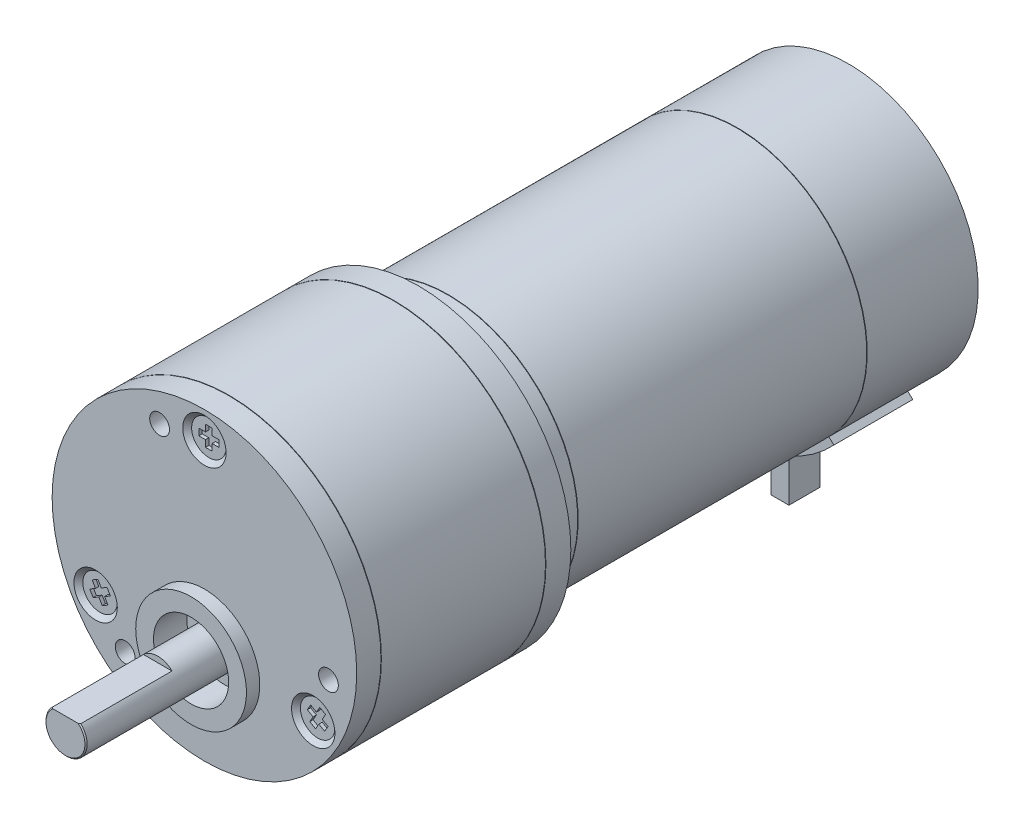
ISO-10303-21;
HEADER;
FILE_DESCRIPTION(('STEP AP214'),'2;1');
FILE_NAME('part.step','',(''),(''),'','','');
FILE_SCHEMA(('AUTOMOTIVE_DESIGN { 1 0 10303 214 1 1 1 1 }'));
ENDSEC;
DATA;
#1=APPLICATION_CONTEXT('core data for automotive mechanical design processes');
#2=APPLICATION_PROTOCOL_DEFINITION('international standard','automotive_design',2000,#1);
#3=PRODUCT_CONTEXT('',#1,'mechanical');
#4=PRODUCT('Part','Part','',(#3));
#5=PRODUCT_RELATED_PRODUCT_CATEGORY('part','',(#4));
#6=PRODUCT_DEFINITION_FORMATION('','',#4);
#7=PRODUCT_DEFINITION_CONTEXT('part definition',#1,'design');
#8=PRODUCT_DEFINITION('design','',#6,#7);
#9=PRODUCT_DEFINITION_SHAPE('','',#8);
#10=(LENGTH_UNIT() NAMED_UNIT(*) SI_UNIT(.MILLI.,.METRE.));
#11=(NAMED_UNIT(*) PLANE_ANGLE_UNIT() SI_UNIT($,.RADIAN.));
#12=(NAMED_UNIT(*) SI_UNIT($,.STERADIAN.) SOLID_ANGLE_UNIT());
#13=UNCERTAINTY_MEASURE_WITH_UNIT(LENGTH_MEASURE(1.E-05),#10,'distance_accuracy_value','');
#14=(GEOMETRIC_REPRESENTATION_CONTEXT(3) GLOBAL_UNCERTAINTY_ASSIGNED_CONTEXT((#13)) GLOBAL_UNIT_ASSIGNED_CONTEXT((#10,
#11,#12)) REPRESENTATION_CONTEXT('',''));
#15=CARTESIAN_POINT('',(0.,0.,0.));
#16=DIRECTION('',(0.,0.,1.));
#17=DIRECTION('',(1.,0.,0.));
#18=AXIS2_PLACEMENT_3D('',#15,#16,#17);
#19=CARTESIAN_POINT('',(0.,0.,-66.7639));
#20=DIRECTION('',(0.,0.,1.));
#21=DIRECTION('',(1.,0.,0.));
#22=AXIS2_PLACEMENT_3D('',#19,#20,#21);
#23=CYLINDRICAL_SURFACE('',#22,15.621);
#24=CARTESIAN_POINT('',(0.,0.,-63.2079));
#25=DIRECTION('',(0.,0.,-1.));
#26=DIRECTION('',(-1.,0.,0.));
#27=AXIS2_PLACEMENT_3D('',#24,#25,#26);
#28=CIRCLE('',#27,15.621);
#29=CARTESIAN_POINT('',(3.56694740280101,-15.2083045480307,-63.2079));
#30=VERTEX_POINT('',#29);
#31=CARTESIAN_POINT('',(1.53494740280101,-15.545403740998,-63.2079));
#32=VERTEX_POINT('',#31);
#33=EDGE_CURVE('E121',#30,#32,#28,.T.);
#34=ORIENTED_EDGE('',*,*,#33,.F.);
#35=DIRECTION('',(0.,0.,1.));
#36=VECTOR('',#35,1.);
#37=CARTESIAN_POINT('',(3.56694740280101,-15.2083045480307,-66.7639));
#38=LINE('',#37,#36);
#39=CARTESIAN_POINT('',(3.56694740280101,-15.2083045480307,-66.7639));
#40=VERTEX_POINT('',#39);
#41=EDGE_CURVE('E12',#40,#30,#38,.T.);
#42=ORIENTED_EDGE('',*,*,#41,.F.);
#43=CARTESIAN_POINT('',(0.,0.,-66.7639));
#44=DIRECTION('',(0.,0.,-1.));
#45=DIRECTION('',(-1.,0.,0.));
#46=AXIS2_PLACEMENT_3D('',#43,#44,#45);
#47=CIRCLE('',#46,15.621);
#48=CARTESIAN_POINT('',(1.53494740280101,-15.545403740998,-66.7639));
#49=VERTEX_POINT('',#48);
#50=EDGE_CURVE('E109',#40,#49,#47,.T.);
#51=ORIENTED_EDGE('',*,*,#50,.T.);
#52=DIRECTION('',(0.,0.,1.));
#53=VECTOR('',#52,1.);
#54=CARTESIAN_POINT('',(1.53494740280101,-15.545403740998,-66.7639));
#55=LINE('',#54,#53);
#56=EDGE_CURVE('E98',#49,#32,#55,.T.);
#57=ORIENTED_EDGE('',*,*,#56,.T.);
#58=EDGE_LOOP('',(#34,#42,#51,#57));
#59=FACE_BOUND('',#58,.T.);
#60=ADVANCED_FACE('F59',(#59),#23,.F.);
#61=CARTESIAN_POINT('',(3.56694740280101,0.,-66.7639));
#62=DIRECTION('',(-1.,0.,0.));
#63=DIRECTION('',(0.,-1.,0.));
#64=AXIS2_PLACEMENT_3D('',#61,#62,#63);
#65=PLANE('',#64);
#66=DIRECTION('',(0.,-1.,0.));
#67=VECTOR('',#66,1.);
#68=CARTESIAN_POINT('',(3.56694740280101,0.,-63.2079));
#69=LINE('',#68,#67);
#70=CARTESIAN_POINT('',(3.56694740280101,-21.895403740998,-63.2079));
#71=VERTEX_POINT('',#70);
#72=EDGE_CURVE('E114',#30,#71,#69,.T.);
#73=ORIENTED_EDGE('',*,*,#72,.T.);
#74=DIRECTION('',(0.,0.,1.));
#75=VECTOR('',#74,1.);
#76=CARTESIAN_POINT('',(3.56694740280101,-21.895403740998,-66.7639));
#77=LINE('',#76,#75);
#78=CARTESIAN_POINT('',(3.56694740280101,-21.895403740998,-66.7639));
#79=VERTEX_POINT('',#78);
#80=EDGE_CURVE('E67',#79,#71,#77,.T.);
#81=ORIENTED_EDGE('',*,*,#80,.F.);
#82=DIRECTION('',(0.,-1.,0.));
#83=VECTOR('',#82,1.);
#84=CARTESIAN_POINT('',(3.56694740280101,0.,-66.7639));
#85=LINE('',#84,#83);
#86=EDGE_CURVE('E104',#40,#79,#85,.T.);
#87=ORIENTED_EDGE('',*,*,#86,.F.);
#88=ORIENTED_EDGE('',*,*,#41,.T.);
#89=EDGE_LOOP('',(#73,#81,#87,#88));
#90=FACE_BOUND('',#89,.T.);
#91=ADVANCED_FACE('F112',(#90),#65,.F.);
#92=CARTESIAN_POINT('',(0.,-21.895403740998,-66.7639));
#93=DIRECTION('',(0.,1.,0.));
#94=DIRECTION('',(0.,0.,1.));
#95=AXIS2_PLACEMENT_3D('',#92,#93,#94);
#96=PLANE('',#95);
#97=DIRECTION('',(-1.,0.,0.));
#98=VECTOR('',#97,1.);
#99=CARTESIAN_POINT('',(0.,-21.895403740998,-63.2079));
#100=LINE('',#99,#98);
#101=CARTESIAN_POINT('',(1.53494740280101,-21.895403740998,-63.2079));
#102=VERTEX_POINT('',#101);
#103=EDGE_CURVE('E91',#71,#102,#100,.T.);
#104=ORIENTED_EDGE('',*,*,#103,.T.);
#105=DIRECTION('',(0.,0.,1.));
#106=VECTOR('',#105,1.);
#107=CARTESIAN_POINT('',(1.53494740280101,-21.895403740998,-66.7639));
#108=LINE('',#107,#106);
#109=CARTESIAN_POINT('',(1.53494740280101,-21.895403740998,-66.7639));
#110=VERTEX_POINT('',#109);
#111=EDGE_CURVE('E115',#110,#102,#108,.T.);
#112=ORIENTED_EDGE('',*,*,#111,.F.);
#113=DIRECTION('',(-1.,0.,0.));
#114=VECTOR('',#113,1.);
#115=CARTESIAN_POINT('',(0.,-21.895403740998,-66.7639));
#116=LINE('',#115,#114);
#117=EDGE_CURVE('E108',#79,#110,#116,.T.);
#118=ORIENTED_EDGE('',*,*,#117,.F.);
#119=ORIENTED_EDGE('',*,*,#80,.T.);
#120=EDGE_LOOP('',(#104,#112,#118,#119));
#121=FACE_BOUND('',#120,.T.);
#122=ADVANCED_FACE('F116',(#121),#96,.F.);
#123=CARTESIAN_POINT('',(1.53494740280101,0.,-66.7639));
#124=DIRECTION('',(1.,0.,0.));
#125=DIRECTION('',(0.,0.,-1.));
#126=AXIS2_PLACEMENT_3D('',#123,#124,#125);
#127=PLANE('',#126);
#128=DIRECTION('',(0.,1.,0.));
#129=VECTOR('',#128,1.);
#130=CARTESIAN_POINT('',(1.53494740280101,0.,-63.2079));
#131=LINE('',#130,#129);
#132=EDGE_CURVE('E126',#102,#32,#131,.T.);
#133=ORIENTED_EDGE('',*,*,#132,.T.);
#134=ORIENTED_EDGE('',*,*,#56,.F.);
#135=DIRECTION('',(0.,1.,0.));
#136=VECTOR('',#135,1.);
#137=CARTESIAN_POINT('',(1.53494740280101,0.,-66.7639));
#138=LINE('',#137,#136);
#139=EDGE_CURVE('E75',#110,#49,#138,.T.);
#140=ORIENTED_EDGE('',*,*,#139,.F.);
#141=ORIENTED_EDGE('',*,*,#111,.T.);
#142=EDGE_LOOP('',(#133,#134,#140,#141));
#143=FACE_BOUND('',#142,.T.);
#144=ADVANCED_FACE('F131',(#143),#127,.F.);
#145=CARTESIAN_POINT('',(0.,0.,-66.7639));
#146=DIRECTION('',(0.,0.,-1.));
#147=DIRECTION('',(-1.,0.,0.));
#148=AXIS2_PLACEMENT_3D('',#145,#146,#147);
#149=PLANE('',#148);
#150=ORIENTED_EDGE('',*,*,#50,.F.);
#151=ORIENTED_EDGE('',*,*,#86,.T.);
#152=ORIENTED_EDGE('',*,*,#117,.T.);
#153=ORIENTED_EDGE('',*,*,#139,.T.);
#154=EDGE_LOOP('',(#150,#151,#152,#153));
#155=FACE_BOUND('',#154,.T.);
#156=ADVANCED_FACE('F106',(#155),#149,.T.);
#157=CARTESIAN_POINT('',(0.,0.,-63.2079));
#158=DIRECTION('',(0.,0.,-1.));
#159=DIRECTION('',(-1.,0.,0.));
#160=AXIS2_PLACEMENT_3D('',#157,#158,#159);
#161=PLANE('',#160);
#162=ORIENTED_EDGE('',*,*,#33,.T.);
#163=ORIENTED_EDGE('',*,*,#132,.F.);
#164=ORIENTED_EDGE('',*,*,#103,.F.);
#165=ORIENTED_EDGE('',*,*,#72,.F.);
#166=EDGE_LOOP('',(#162,#163,#164,#165));
#167=FACE_BOUND('',#166,.T.);
#168=ADVANCED_FACE('F133',(#167),#161,.F.);
#169=CLOSED_SHELL('',(#60,#91,#122,#144,#156,#168));
#170=MANIFOLD_SOLID_BREP('B2',#169);
#171=CARTESIAN_POINT('',(0.,0.,-66.7639));
#172=DIRECTION('',(0.,0.,1.));
#173=DIRECTION('',(1.,0.,0.));
#174=AXIS2_PLACEMENT_3D('',#171,#172,#173);
#175=CYLINDRICAL_SURFACE('',#174,15.621);
#176=CARTESIAN_POINT('',(0.,0.,-63.2079));
#177=DIRECTION('',(0.,0.,-1.));
#178=DIRECTION('',(-1.,0.,0.));
#179=AXIS2_PLACEMENT_3D('',#176,#177,#178);
#180=CIRCLE('',#179,15.621);
#181=CARTESIAN_POINT('',(-1.51305259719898,-15.5475500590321,-63.2079));
#182=VERTEX_POINT('',#181);
#183=CARTESIAN_POINT('',(-3.54505259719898,-15.2134231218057,-63.2079));
#184=VERTEX_POINT('',#183);
#185=EDGE_CURVE('E255',#182,#184,#180,.T.);
#186=ORIENTED_EDGE('',*,*,#185,.F.);
#187=DIRECTION('',(0.,0.,1.));
#188=VECTOR('',#187,1.);
#189=CARTESIAN_POINT('',(-1.51305259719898,-15.5475500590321,-66.7639));
#190=LINE('',#189,#188);
#191=CARTESIAN_POINT('',(-1.51305259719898,-15.5475500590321,-66.7639));
#192=VERTEX_POINT('',#191);
#193=EDGE_CURVE('E57',#192,#182,#190,.T.);
#194=ORIENTED_EDGE('',*,*,#193,.F.);
#195=CARTESIAN_POINT('',(0.,0.,-66.7639));
#196=DIRECTION('',(0.,0.,-1.));
#197=DIRECTION('',(-1.,0.,0.));
#198=AXIS2_PLACEMENT_3D('',#195,#196,#197);
#199=CIRCLE('',#198,15.621);
#200=CARTESIAN_POINT('',(-3.54505259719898,-15.2134231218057,-66.7639));
#201=VERTEX_POINT('',#200);
#202=EDGE_CURVE('E247',#192,#201,#199,.T.);
#203=ORIENTED_EDGE('',*,*,#202,.T.);
#204=DIRECTION('',(0.,0.,1.));
#205=VECTOR('',#204,1.);
#206=CARTESIAN_POINT('',(-3.54505259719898,-15.2134231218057,-66.7639));
#207=LINE('',#206,#205);
#208=EDGE_CURVE('E208',#201,#184,#207,.T.);
#209=ORIENTED_EDGE('',*,*,#208,.T.);
#210=EDGE_LOOP('',(#186,#194,#203,#209));
#211=FACE_BOUND('',#210,.T.);
#212=ADVANCED_FACE('F192',(#211),#175,.F.);
#213=CARTESIAN_POINT('',(-1.51305259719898,0.,-66.7639));
#214=DIRECTION('',(1.,0.,0.));
#215=DIRECTION('',(0.,0.,-1.));
#216=AXIS2_PLACEMENT_3D('',#213,#214,#215);
#217=PLANE('',#216);
#218=DIRECTION('',(0.,1.,0.));
#219=VECTOR('',#218,1.);
#220=CARTESIAN_POINT('',(-1.51305259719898,0.,-63.2079));
#221=LINE('',#220,#219);
#222=CARTESIAN_POINT('',(-1.51305259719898,-21.895403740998,-63.2079));
#223=VERTEX_POINT('',#222);
#224=EDGE_CURVE('E238',#223,#182,#221,.T.);
#225=ORIENTED_EDGE('',*,*,#224,.F.);
#226=DIRECTION('',(0.,0.,1.));
#227=VECTOR('',#226,1.);
#228=CARTESIAN_POINT('',(-1.51305259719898,-21.895403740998,-66.7639));
#229=LINE('',#228,#227);
#230=CARTESIAN_POINT('',(-1.51305259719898,-21.895403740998,-66.7639));
#231=VERTEX_POINT('',#230);
#232=EDGE_CURVE('E200',#231,#223,#229,.T.);
#233=ORIENTED_EDGE('',*,*,#232,.F.);
#234=DIRECTION('',(0.,1.,0.));
#235=VECTOR('',#234,1.);
#236=CARTESIAN_POINT('',(-1.51305259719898,0.,-66.7639));
#237=LINE('',#236,#235);
#238=EDGE_CURVE('E236',#231,#192,#237,.T.);
#239=ORIENTED_EDGE('',*,*,#238,.T.);
#240=ORIENTED_EDGE('',*,*,#193,.T.);
#241=EDGE_LOOP('',(#225,#233,#239,#240));
#242=FACE_BOUND('',#241,.T.);
#243=ADVANCED_FACE('F235',(#242),#217,.T.);
#244=CARTESIAN_POINT('',(0.,-21.895403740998,-66.7639));
#245=DIRECTION('',(0.,-1.,0.));
#246=DIRECTION('',(0.,0.,-1.));
#247=AXIS2_PLACEMENT_3D('',#244,#245,#246);
#248=PLANE('',#247);
#249=DIRECTION('',(1.,0.,0.));
#250=VECTOR('',#249,1.);
#251=CARTESIAN_POINT('',(0.,-21.895403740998,-63.2079));
#252=LINE('',#251,#250);
#253=CARTESIAN_POINT('',(-3.54505259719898,-21.895403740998,-63.2079));
#254=VERTEX_POINT('',#253);
#255=EDGE_CURVE('E258',#254,#223,#252,.T.);
#256=ORIENTED_EDGE('',*,*,#255,.F.);
#257=DIRECTION('',(0.,0.,1.));
#258=VECTOR('',#257,1.);
#259=CARTESIAN_POINT('',(-3.54505259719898,-21.895403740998,-66.7639));
#260=LINE('',#259,#258);
#261=CARTESIAN_POINT('',(-3.54505259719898,-21.895403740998,-66.7639));
#262=VERTEX_POINT('',#261);
#263=EDGE_CURVE('E221',#262,#254,#260,.T.);
#264=ORIENTED_EDGE('',*,*,#263,.F.);
#265=DIRECTION('',(1.,0.,0.));
#266=VECTOR('',#265,1.);
#267=CARTESIAN_POINT('',(0.,-21.895403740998,-66.7639));
#268=LINE('',#267,#266);
#269=EDGE_CURVE('E246',#262,#231,#268,.T.);
#270=ORIENTED_EDGE('',*,*,#269,.T.);
#271=ORIENTED_EDGE('',*,*,#232,.T.);
#272=EDGE_LOOP('',(#256,#264,#270,#271));
#273=FACE_BOUND('',#272,.T.);
#274=ADVANCED_FACE('F249',(#273),#248,.T.);
#275=CARTESIAN_POINT('',(-3.54505259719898,0.,-66.7639));
#276=DIRECTION('',(-1.,0.,0.));
#277=DIRECTION('',(0.,-1.,0.));
#278=AXIS2_PLACEMENT_3D('',#275,#276,#277);
#279=PLANE('',#278);
#280=DIRECTION('',(0.,-1.,0.));
#281=VECTOR('',#280,1.);
#282=CARTESIAN_POINT('',(-3.54505259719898,0.,-63.2079));
#283=LINE('',#282,#281);
#284=EDGE_CURVE('E260',#184,#254,#283,.T.);
#285=ORIENTED_EDGE('',*,*,#284,.F.);
#286=ORIENTED_EDGE('',*,*,#208,.F.);
#287=DIRECTION('',(0.,-1.,0.));
#288=VECTOR('',#287,1.);
#289=CARTESIAN_POINT('',(-3.54505259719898,0.,-66.7639));
#290=LINE('',#289,#288);
#291=EDGE_CURVE('E250',#201,#262,#290,.T.);
#292=ORIENTED_EDGE('',*,*,#291,.T.);
#293=ORIENTED_EDGE('',*,*,#263,.T.);
#294=EDGE_LOOP('',(#285,#286,#292,#293));
#295=FACE_BOUND('',#294,.T.);
#296=ADVANCED_FACE('F265',(#295),#279,.T.);
#297=CARTESIAN_POINT('',(0.,0.,-66.7639));
#298=DIRECTION('',(0.,0.,-1.));
#299=DIRECTION('',(-1.,0.,0.));
#300=AXIS2_PLACEMENT_3D('',#297,#298,#299);
#301=PLANE('',#300);
#302=ORIENTED_EDGE('',*,*,#202,.F.);
#303=ORIENTED_EDGE('',*,*,#238,.F.);
#304=ORIENTED_EDGE('',*,*,#269,.F.);
#305=ORIENTED_EDGE('',*,*,#291,.F.);
#306=EDGE_LOOP('',(#302,#303,#304,#305));
#307=FACE_BOUND('',#306,.T.);
#308=ADVANCED_FACE('F244',(#307),#301,.T.);
#309=CARTESIAN_POINT('',(0.,0.,-63.2079));
#310=DIRECTION('',(0.,0.,-1.));
#311=DIRECTION('',(-1.,0.,0.));
#312=AXIS2_PLACEMENT_3D('',#309,#310,#311);
#313=PLANE('',#312);
#314=ORIENTED_EDGE('',*,*,#185,.T.);
#315=ORIENTED_EDGE('',*,*,#284,.T.);
#316=ORIENTED_EDGE('',*,*,#255,.T.);
#317=ORIENTED_EDGE('',*,*,#224,.T.);
#318=EDGE_LOOP('',(#314,#315,#316,#317));
#319=FACE_BOUND('',#318,.T.);
#320=ADVANCED_FACE('F272',(#319),#313,.F.);
#321=CLOSED_SHELL('',(#212,#243,#274,#296,#308,#320));
#322=MANIFOLD_SOLID_BREP('B6',#321);
#323=CARTESIAN_POINT('',(0.,0.,-60.4774));
#324=DIRECTION('',(-0.681618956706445,-0.73170731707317,0.));
#325=DIRECTION('',(0.731707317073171,-0.681618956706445,0.));
#326=AXIS2_PLACEMENT_3D('',#323,#324,#325);
#327=PLANE('',#326);
#328=DIRECTION('',(-0.731707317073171,0.681618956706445,0.));
#329=VECTOR('',#328,1.);
#330=CARTESIAN_POINT('',(0.,0.,-69.4944));
#331=LINE('',#330,#329);
#332=CARTESIAN_POINT('',(11.43,-10.6475697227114,-69.4944));
#333=VERTEX_POINT('',#332);
#334=CARTESIAN_POINT('',(10.8538536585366,-10.1108629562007,-69.4944));
#335=VERTEX_POINT('',#334);
#336=EDGE_CURVE('E388',#333,#335,#331,.T.);
#337=ORIENTED_EDGE('',*,*,#336,.T.);
#338=DIRECTION('',(0.,0.,-1.));
#339=VECTOR('',#338,1.);
#340=CARTESIAN_POINT('',(10.8538536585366,-10.1108629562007,-60.4774));
#341=LINE('',#340,#339);
#342=CARTESIAN_POINT('',(10.8538536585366,-10.1108629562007,-60.4774));
#343=VERTEX_POINT('',#342);
#344=EDGE_CURVE('E190',#343,#335,#341,.T.);
#345=ORIENTED_EDGE('',*,*,#344,.F.);
#346=DIRECTION('',(-0.731707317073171,0.681618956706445,0.));
#347=VECTOR('',#346,1.);
#348=CARTESIAN_POINT('',(0.,0.,-60.4774));
#349=LINE('',#348,#347);
#350=CARTESIAN_POINT('',(11.43,-10.6475697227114,-60.4774));
#351=VERTEX_POINT('',#350);
#352=EDGE_CURVE('E383',#351,#343,#349,.T.);
#353=ORIENTED_EDGE('',*,*,#352,.F.);
#354=DIRECTION('',(0.,0.,-1.));
#355=VECTOR('',#354,1.);
#356=CARTESIAN_POINT('',(11.43,-10.6475697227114,-60.4774));
#357=LINE('',#356,#355);
#358=EDGE_CURVE('E327',#351,#333,#357,.T.);
#359=ORIENTED_EDGE('',*,*,#358,.T.);
#360=EDGE_LOOP('',(#337,#345,#353,#359));
#361=FACE_BOUND('',#360,.T.);
#362=ADVANCED_FACE('F324',(#361),#327,.F.);
#363=CARTESIAN_POINT('',(0.,0.,-60.4774));
#364=DIRECTION('',(0.,0.,-1.));
#365=DIRECTION('',(-1.,0.,0.));
#366=AXIS2_PLACEMENT_3D('',#363,#364,#365);
#367=CYLINDRICAL_SURFACE('',#366,14.8336);
#368=CARTESIAN_POINT('',(0.,0.,-69.4944));
#369=DIRECTION('',(0.,0.,-1.));
#370=DIRECTION('',(-1.,0.,0.));
#371=AXIS2_PLACEMENT_3D('',#368,#369,#370);
#372=CIRCLE('',#371,14.8336);
#373=CARTESIAN_POINT('',(-10.8396713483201,-10.126066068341,-69.4944));
#374=VERTEX_POINT('',#373);
#375=EDGE_CURVE('E355',#335,#374,#372,.T.);
#376=ORIENTED_EDGE('',*,*,#375,.T.);
#377=DIRECTION('',(0.,0.,-1.));
#378=VECTOR('',#377,1.);
#379=CARTESIAN_POINT('',(-10.8396713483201,-10.126066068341,-60.4774));
#380=LINE('',#379,#378);
#381=CARTESIAN_POINT('',(-10.8396713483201,-10.126066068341,-60.4774));
#382=VERTEX_POINT('',#381);
#383=EDGE_CURVE('E333',#382,#374,#380,.T.);
#384=ORIENTED_EDGE('',*,*,#383,.F.);
#385=CARTESIAN_POINT('',(0.,0.,-60.4774));
#386=DIRECTION('',(0.,0.,-1.));
#387=DIRECTION('',(-1.,0.,0.));
#388=AXIS2_PLACEMENT_3D('',#385,#386,#387);
#389=CIRCLE('',#388,14.8336);
#390=EDGE_CURVE('E341',#343,#382,#389,.T.);
#391=ORIENTED_EDGE('',*,*,#390,.F.);
#392=ORIENTED_EDGE('',*,*,#344,.T.);
#393=EDGE_LOOP('',(#376,#384,#391,#392));
#394=FACE_BOUND('',#393,.T.);
#395=ADVANCED_FACE('F398',(#394),#367,.F.);
#396=CARTESIAN_POINT('',(0.,0.,-60.4774));
#397=DIRECTION('',(0.682643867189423,-0.730751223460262,0.));
#398=DIRECTION('',(0.730751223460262,0.682643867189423,0.));
#399=AXIS2_PLACEMENT_3D('',#396,#397,#398);
#400=PLANE('',#399);
#401=DIRECTION('',(-0.730751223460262,-0.682643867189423,0.));
#402=VECTOR('',#401,1.);
#403=CARTESIAN_POINT('',(0.,0.,-69.4944));
#404=LINE('',#403,#402);
#405=CARTESIAN_POINT('',(-11.4150648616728,-10.663579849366,-69.4944));
#406=VERTEX_POINT('',#405);
#407=EDGE_CURVE('E380',#374,#406,#404,.T.);
#408=ORIENTED_EDGE('',*,*,#407,.T.);
#409=DIRECTION('',(0.,0.,-1.));
#410=VECTOR('',#409,1.);
#411=CARTESIAN_POINT('',(-11.4150648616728,-10.663579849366,-60.4774));
#412=LINE('',#411,#410);
#413=CARTESIAN_POINT('',(-11.4150648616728,-10.663579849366,-60.4774));
#414=VERTEX_POINT('',#413);
#415=EDGE_CURVE('E378',#414,#406,#412,.T.);
#416=ORIENTED_EDGE('',*,*,#415,.F.);
#417=DIRECTION('',(-0.730751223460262,-0.682643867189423,0.));
#418=VECTOR('',#417,1.);
#419=CARTESIAN_POINT('',(0.,0.,-60.4774));
#420=LINE('',#419,#418);
#421=EDGE_CURVE('E371',#382,#414,#420,.T.);
#422=ORIENTED_EDGE('',*,*,#421,.F.);
#423=ORIENTED_EDGE('',*,*,#383,.T.);
#424=EDGE_LOOP('',(#408,#416,#422,#423));
#425=FACE_BOUND('',#424,.T.);
#426=ADVANCED_FACE('F379',(#425),#400,.F.);
#427=CARTESIAN_POINT('',(0.,0.,-60.4774));
#428=DIRECTION('',(0.,0.,-1.));
#429=DIRECTION('',(-1.,0.,0.));
#430=AXIS2_PLACEMENT_3D('',#427,#428,#429);
#431=CYLINDRICAL_SURFACE('',#430,15.621);
#432=CARTESIAN_POINT('',(0.,0.,-69.4944));
#433=DIRECTION('',(0.,0.,-1.));
#434=DIRECTION('',(-1.,0.,0.));
#435=AXIS2_PLACEMENT_3D('',#432,#433,#434);
#436=CIRCLE('',#435,15.621);
#437=EDGE_CURVE('E391',#333,#406,#436,.T.);
#438=ORIENTED_EDGE('',*,*,#437,.F.);
#439=ORIENTED_EDGE('',*,*,#358,.F.);
#440=CARTESIAN_POINT('',(0.,0.,-60.4774));
#441=DIRECTION('',(0.,0.,-1.));
#442=DIRECTION('',(-1.,0.,0.));
#443=AXIS2_PLACEMENT_3D('',#440,#441,#442);
#444=CIRCLE('',#443,15.621);
#445=EDGE_CURVE('E374',#351,#414,#444,.T.);
#446=ORIENTED_EDGE('',*,*,#445,.T.);
#447=ORIENTED_EDGE('',*,*,#415,.T.);
#448=EDGE_LOOP('',(#438,#439,#446,#447));
#449=FACE_BOUND('',#448,.T.);
#450=ADVANCED_FACE('F382',(#449),#431,.T.);
#451=CARTESIAN_POINT('',(0.,0.,-60.4774));
#452=DIRECTION('',(0.,0.,-1.));
#453=DIRECTION('',(-1.,0.,0.));
#454=AXIS2_PLACEMENT_3D('',#451,#452,#453);
#455=PLANE('',#454);
#456=ORIENTED_EDGE('',*,*,#352,.T.);
#457=ORIENTED_EDGE('',*,*,#390,.T.);
#458=ORIENTED_EDGE('',*,*,#421,.T.);
#459=ORIENTED_EDGE('',*,*,#445,.F.);
#460=EDGE_LOOP('',(#456,#457,#458,#459));
#461=FACE_BOUND('',#460,.T.);
#462=ADVANCED_FACE('F373',(#461),#455,.F.);
#463=CARTESIAN_POINT('',(0.,0.,-69.4944));
#464=DIRECTION('',(0.,0.,-1.));
#465=DIRECTION('',(-1.,0.,0.));
#466=AXIS2_PLACEMENT_3D('',#463,#464,#465);
#467=PLANE('',#466);
#468=ORIENTED_EDGE('',*,*,#336,.F.);
#469=ORIENTED_EDGE('',*,*,#437,.T.);
#470=ORIENTED_EDGE('',*,*,#407,.F.);
#471=ORIENTED_EDGE('',*,*,#375,.F.);
#472=EDGE_LOOP('',(#468,#469,#470,#471));
#473=FACE_BOUND('',#472,.T.);
#474=ADVANCED_FACE('F395',(#473),#467,.T.);
#475=CLOSED_SHELL('',(#362,#395,#426,#450,#462,#474));
#476=MANIFOLD_SOLID_BREP('B51',#475);
#477=CARTESIAN_POINT('',(0.,0.,-72.2884));
#478=DIRECTION('',(0.,0.,-1.));
#479=DIRECTION('',(-1.,0.,0.));
#480=AXIS2_PLACEMENT_3D('',#477,#478,#479);
#481=PLANE('',#480);
#482=CARTESIAN_POINT('',(-11.811,0.,-72.2884));
#483=DIRECTION('',(0.,0.,-1.));
#484=DIRECTION('',(-1.,0.,0.));
#485=AXIS2_PLACEMENT_3D('',#482,#483,#484);
#486=CIRCLE('',#485,2.8575);
#487=CARTESIAN_POINT('',(-14.6685,0.,-72.2884));
#488=VERTEX_POINT('',#487);
#489=EDGE_CURVE('E1091',#488,#488,#486,.T.);
#490=ORIENTED_EDGE('',*,*,#489,.T.);
#491=EDGE_LOOP('',(#490));
#492=FACE_BOUND('',#491,.T.);
#493=DIRECTION('',(1.,0.,0.));
#494=VECTOR('',#493,1.);
#495=CARTESIAN_POINT('',(0.,0.380999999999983,-72.2884));
#496=LINE('',#495,#494);
#497=CARTESIAN_POINT('',(-11.43,0.380999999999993,-72.2884));
#498=VERTEX_POINT('',#497);
#499=CARTESIAN_POINT('',(-10.668,0.380999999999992,-72.2884));
#500=VERTEX_POINT('',#499);
#501=EDGE_CURVE('E936',#498,#500,#496,.T.);
#502=ORIENTED_EDGE('',*,*,#501,.F.);
#503=DIRECTION('',(0.,1.,0.));
#504=VECTOR('',#503,1.);
#505=CARTESIAN_POINT('',(-11.43,0.,-72.2884));
#506=LINE('',#505,#504);
#507=CARTESIAN_POINT('',(-11.43,1.14299999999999,-72.2884));
#508=VERTEX_POINT('',#507);
#509=EDGE_CURVE('E484',#498,#508,#506,.T.);
#510=ORIENTED_EDGE('',*,*,#509,.T.);
#511=DIRECTION('',(1.,0.,0.));
#512=VECTOR('',#511,1.);
#513=CARTESIAN_POINT('',(0.,1.143,-72.2884));
#514=LINE('',#513,#512);
#515=CARTESIAN_POINT('',(-12.192,1.14299999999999,-72.2884));
#516=VERTEX_POINT('',#515);
#517=EDGE_CURVE('E906',#516,#508,#514,.T.);
#518=ORIENTED_EDGE('',*,*,#517,.F.);
#519=DIRECTION('',(0.,1.,0.));
#520=VECTOR('',#519,1.);
#521=CARTESIAN_POINT('',(-12.192,0.,-72.2884));
#522=LINE('',#521,#520);
#523=CARTESIAN_POINT('',(-12.192,0.380999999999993,-72.2884));
#524=VERTEX_POINT('',#523);
#525=EDGE_CURVE('E963',#524,#516,#522,.T.);
#526=ORIENTED_EDGE('',*,*,#525,.F.);
#527=DIRECTION('',(1.,0.,0.));
#528=VECTOR('',#527,1.);
#529=CARTESIAN_POINT('',(0.,0.380999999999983,-72.2884));
#530=LINE('',#529,#528);
#531=CARTESIAN_POINT('',(-12.954,0.380999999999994,-72.2884));
#532=VERTEX_POINT('',#531);
#533=EDGE_CURVE('E960',#532,#524,#530,.T.);
#534=ORIENTED_EDGE('',*,*,#533,.F.);
#535=DIRECTION('',(0.,1.,0.));
#536=VECTOR('',#535,1.);
#537=CARTESIAN_POINT('',(-12.954,0.,-72.2884));
#538=LINE('',#537,#536);
#539=CARTESIAN_POINT('',(-12.954,-0.381000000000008,-72.2884));
#540=VERTEX_POINT('',#539);
#541=EDGE_CURVE('E957',#540,#532,#538,.T.);
#542=ORIENTED_EDGE('',*,*,#541,.F.);
#543=DIRECTION('',(1.,0.,0.));
#544=VECTOR('',#543,1.);
#545=CARTESIAN_POINT('',(0.,-0.381000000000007,-72.2884));
#546=LINE('',#545,#544);
#547=CARTESIAN_POINT('',(-12.192,-0.381000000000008,-72.2884));
#548=VERTEX_POINT('',#547);
#549=EDGE_CURVE('E954',#540,#548,#546,.T.);
#550=ORIENTED_EDGE('',*,*,#549,.T.);
#551=DIRECTION('',(0.,1.,0.));
#552=VECTOR('',#551,1.);
#553=CARTESIAN_POINT('',(-12.192,0.,-72.2884));
#554=LINE('',#553,#552);
#555=CARTESIAN_POINT('',(-12.192,-1.14300000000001,-72.2884));
#556=VERTEX_POINT('',#555);
#557=EDGE_CURVE('E951',#556,#548,#554,.T.);
#558=ORIENTED_EDGE('',*,*,#557,.F.);
#559=DIRECTION('',(1.,0.,0.));
#560=VECTOR('',#559,1.);
#561=CARTESIAN_POINT('',(0.,-1.143,-72.2884));
#562=LINE('',#561,#560);
#563=CARTESIAN_POINT('',(-11.43,-1.14300000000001,-72.2884));
#564=VERTEX_POINT('',#563);
#565=EDGE_CURVE('E948',#556,#564,#562,.T.);
#566=ORIENTED_EDGE('',*,*,#565,.T.);
#567=DIRECTION('',(0.,1.,0.));
#568=VECTOR('',#567,1.);
#569=CARTESIAN_POINT('',(-11.43,0.,-72.2884));
#570=LINE('',#569,#568);
#571=CARTESIAN_POINT('',(-11.43,-0.381000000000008,-72.2884));
#572=VERTEX_POINT('',#571);
#573=EDGE_CURVE('E945',#564,#572,#570,.T.);
#574=ORIENTED_EDGE('',*,*,#573,.T.);
#575=DIRECTION('',(1.,0.,0.));
#576=VECTOR('',#575,1.);
#577=CARTESIAN_POINT('',(0.,-0.381000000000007,-72.2884));
#578=LINE('',#577,#576);
#579=CARTESIAN_POINT('',(-10.668,-0.381000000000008,-72.2884));
#580=VERTEX_POINT('',#579);
#581=EDGE_CURVE('E942',#572,#580,#578,.T.);
#582=ORIENTED_EDGE('',*,*,#581,.T.);
#583=DIRECTION('',(0.,1.,0.));
#584=VECTOR('',#583,1.);
#585=CARTESIAN_POINT('',(-10.668,0.,-72.2884));
#586=LINE('',#585,#584);
#587=EDGE_CURVE('E939',#580,#500,#586,.T.);
#588=ORIENTED_EDGE('',*,*,#587,.T.);
#589=EDGE_LOOP('',(#502,#510,#518,#526,#534,#542,#550,#558,#566,#574,#582,#588));
#590=FACE_BOUND('',#589,.T.);
#591=ADVANCED_FACE('F457',(#492,#590),#481,.T.);
#592=CARTESIAN_POINT('',(0.,0.,0.));
#593=DIRECTION('',(0.,0.,1.));
#594=DIRECTION('',(1.,0.,0.));
#595=AXIS2_PLACEMENT_3D('',#592,#593,#594);
#596=PLANE('',#595);
#597=CARTESIAN_POINT('',(-5.12059742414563,13.4063672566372,0.));
#598=DIRECTION('',(0.,0.,1.));
#599=DIRECTION('',(1.,0.,0.));
#600=AXIS2_PLACEMENT_3D('',#597,#598,#599);
#601=CIRCLE('',#600,1.1303);
#602=CARTESIAN_POINT('',(-3.99029742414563,13.4063672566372,0.));
#603=VERTEX_POINT('',#602);
#604=EDGE_CURVE('E884',#603,#603,#601,.T.);
#605=ORIENTED_EDGE('',*,*,#604,.F.);
#606=EDGE_LOOP('',(#605));
#607=FACE_BOUND('',#606,.T.);
#608=CARTESIAN_POINT('',(-9.04995590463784,-11.137751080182,0.));
#609=DIRECTION('',(0.,0.,1.));
#610=DIRECTION('',(1.,0.,0.));
#611=AXIS2_PLACEMENT_3D('',#608,#609,#610);
#612=CIRCLE('',#611,1.1303);
#613=CARTESIAN_POINT('',(-7.91965590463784,-11.137751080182,0.));
#614=VERTEX_POINT('',#613);
#615=EDGE_CURVE('E891',#614,#614,#612,.T.);
#616=ORIENTED_EDGE('',*,*,#615,.F.);
#617=EDGE_LOOP('',(#616));
#618=FACE_BOUND('',#617,.T.);
#619=CARTESIAN_POINT('',(14.1705533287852,-2.26861617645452,0.));
#620=DIRECTION('',(0.,0.,1.));
#621=DIRECTION('',(1.,0.,0.));
#622=AXIS2_PLACEMENT_3D('',#619,#620,#621);
#623=CIRCLE('',#622,1.1303);
#624=CARTESIAN_POINT('',(15.3008533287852,-2.26861617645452,0.));
#625=VERTEX_POINT('',#624);
#626=EDGE_CURVE('E897',#625,#625,#623,.T.);
#627=ORIENTED_EDGE('',*,*,#626,.F.);
#628=EDGE_LOOP('',(#627));
#629=FACE_BOUND('',#628,.T.);
#630=CARTESIAN_POINT('',(12.4283305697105,-7.17549999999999,0.));
#631=DIRECTION('',(0.,0.,1.));
#632=DIRECTION('',(1.,0.,0.));
#633=AXIS2_PLACEMENT_3D('',#630,#631,#632);
#634=CIRCLE('',#633,2.47650000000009);
#635=CARTESIAN_POINT('',(14.9048305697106,-7.17549999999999,0.));
#636=VERTEX_POINT('',#635);
#637=EDGE_CURVE('E1465',#636,#636,#634,.F.);
#638=ORIENTED_EDGE('',*,*,#637,.T.);
#639=EDGE_LOOP('',(#638));
#640=FACE_BOUND('',#639,.T.);
#641=CARTESIAN_POINT('',(-12.4283305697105,-7.1755,0.));
#642=DIRECTION('',(0.,0.,1.));
#643=DIRECTION('',(1.,0.,0.));
#644=AXIS2_PLACEMENT_3D('',#641,#642,#643);
#645=CIRCLE('',#644,2.47650000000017);
#646=CARTESIAN_POINT('',(-9.95183056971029,-7.1755,0.));
#647=VERTEX_POINT('',#646);
#648=EDGE_CURVE('E1462',#647,#647,#645,.F.);
#649=ORIENTED_EDGE('',*,*,#648,.T.);
#650=EDGE_LOOP('',(#649));
#651=FACE_BOUND('',#650,.T.);
#652=CARTESIAN_POINT('',(0.,14.351,0.));
#653=DIRECTION('',(0.,0.,1.));
#654=DIRECTION('',(1.,0.,0.));
#655=AXIS2_PLACEMENT_3D('',#652,#653,#654);
#656=CIRCLE('',#655,2.47650000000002);
#657=CARTESIAN_POINT('',(2.47650000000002,14.351,0.));
#658=VERTEX_POINT('',#657);
#659=EDGE_CURVE('E1459',#658,#658,#656,.F.);
#660=ORIENTED_EDGE('',*,*,#659,.T.);
#661=EDGE_LOOP('',(#660));
#662=FACE_BOUND('',#661,.T.);
#663=CARTESIAN_POINT('',(0.,0.,0.));
#664=DIRECTION('',(0.,0.,-1.));
#665=DIRECTION('',(-1.,0.,0.));
#666=AXIS2_PLACEMENT_3D('',#663,#664,#665);
#667=CIRCLE('',#666,17.399);
#668=CARTESIAN_POINT('',(-17.399,0.,0.));
#669=VERTEX_POINT('',#668);
#670=EDGE_CURVE('E1456',#669,#669,#667,.T.);
#671=ORIENTED_EDGE('',*,*,#670,.F.);
#672=EDGE_LOOP('',(#671));
#673=FACE_BOUND('',#672,.T.);
#674=CARTESIAN_POINT('',(0.,-6.68019999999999,0.));
#675=DIRECTION('',(0.,0.,1.));
#676=DIRECTION('',(1.,0.,0.));
#677=AXIS2_PLACEMENT_3D('',#674,#675,#676);
#678=CIRCLE('',#677,6.3246);
#679=CARTESIAN_POINT('',(-6.3246,-6.68019999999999,0.));
#680=VERTEX_POINT('',#679);
#681=EDGE_CURVE('E1387',#680,#680,#678,.T.);
#682=ORIENTED_EDGE('',*,*,#681,.F.);
#683=EDGE_LOOP('',(#682));
#684=FACE_BOUND('',#683,.T.);
#685=ADVANCED_FACE('F1515',(#607,#618,#629,#640,#651,#662,#673,#684),#596,.T.);
#686=CARTESIAN_POINT('',(0.,0.,-76.327));
#687=DIRECTION('',(0.,0.,-1.));
#688=DIRECTION('',(-1.,0.,0.));
#689=AXIS2_PLACEMENT_3D('',#686,#687,#688);
#690=CYLINDRICAL_SURFACE('',#689,17.399);
#691=ORIENTED_EDGE('',*,*,#670,.T.);
#692=EDGE_LOOP('',(#691));
#693=FACE_BOUND('',#692,.T.);
#694=CARTESIAN_POINT('',(0.,0.,-2.7686));
#695=DIRECTION('',(0.,0.,-1.));
#696=DIRECTION('',(-1.,0.,0.));
#697=AXIS2_PLACEMENT_3D('',#694,#695,#696);
#698=CIRCLE('',#697,17.399);
#699=CARTESIAN_POINT('',(-17.399,0.,-2.7686));
#700=VERTEX_POINT('',#699);
#701=EDGE_CURVE('E1453',#700,#700,#698,.T.);
#702=ORIENTED_EDGE('',*,*,#701,.F.);
#703=EDGE_LOOP('',(#702));
#704=FACE_BOUND('',#703,.T.);
#705=ADVANCED_FACE('F1521',(#693,#704),#690,.T.);
#706=CARTESIAN_POINT('',(0.,0.,-2.794));
#707=DIRECTION('',(0.,0.,1.));
#708=DIRECTION('',(1.,0.,0.));
#709=AXIS2_PLACEMENT_3D('',#706,#707,#708);
#710=CONICAL_SURFACE('',#709,17.3736,0.785398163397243);
#711=ORIENTED_EDGE('',*,*,#701,.T.);
#712=EDGE_LOOP('',(#711));
#713=FACE_BOUND('',#712,.T.);
#714=CARTESIAN_POINT('',(0.,0.,-2.794));
#715=DIRECTION('',(0.,0.,-1.));
#716=DIRECTION('',(-1.,0.,0.));
#717=AXIS2_PLACEMENT_3D('',#714,#715,#716);
#718=CIRCLE('',#717,17.3736);
#719=CARTESIAN_POINT('',(-17.3736,0.,-2.794));
#720=VERTEX_POINT('',#719);
#721=EDGE_CURVE('E1450',#720,#720,#718,.T.);
#722=ORIENTED_EDGE('',*,*,#721,.F.);
#723=EDGE_LOOP('',(#722));
#724=FACE_BOUND('',#723,.T.);
#725=ADVANCED_FACE('F1813',(#713,#724),#710,.T.);
#726=CARTESIAN_POINT('',(0.,0.,-2.8194));
#727=DIRECTION('',(0.,0.,-1.));
#728=DIRECTION('',(-1.,0.,0.));
#729=AXIS2_PLACEMENT_3D('',#726,#727,#728);
#730=CONICAL_SURFACE('',#729,17.399,0.785398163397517);
#731=ORIENTED_EDGE('',*,*,#721,.T.);
#732=EDGE_LOOP('',(#731));
#733=FACE_BOUND('',#732,.T.);
#734=CARTESIAN_POINT('',(0.,0.,-2.8194));
#735=DIRECTION('',(0.,0.,-1.));
#736=DIRECTION('',(-1.,0.,0.));
#737=AXIS2_PLACEMENT_3D('',#734,#735,#736);
#738=CIRCLE('',#737,17.399);
#739=CARTESIAN_POINT('',(-17.399,0.,-2.8194));
#740=VERTEX_POINT('',#739);
#741=EDGE_CURVE('E1447',#740,#740,#738,.T.);
#742=ORIENTED_EDGE('',*,*,#741,.F.);
#743=EDGE_LOOP('',(#742));
#744=FACE_BOUND('',#743,.T.);
#745=ADVANCED_FACE('F1809',(#733,#744),#730,.T.);
#746=CARTESIAN_POINT('',(0.,0.,-76.327));
#747=DIRECTION('',(0.,0.,-1.));
#748=DIRECTION('',(-1.,0.,0.));
#749=AXIS2_PLACEMENT_3D('',#746,#747,#748);
#750=CYLINDRICAL_SURFACE('',#749,17.399);
#751=ORIENTED_EDGE('',*,*,#741,.T.);
#752=EDGE_LOOP('',(#751));
#753=FACE_BOUND('',#752,.T.);
#754=CARTESIAN_POINT('',(0.,0.,-21.5646));
#755=DIRECTION('',(0.,0.,-1.));
#756=DIRECTION('',(-1.,0.,0.));
#757=AXIS2_PLACEMENT_3D('',#754,#755,#756);
#758=CIRCLE('',#757,17.399);
#759=CARTESIAN_POINT('',(-17.399,0.,-21.5646));
#760=VERTEX_POINT('',#759);
#761=EDGE_CURVE('E1444',#760,#760,#758,.T.);
#762=ORIENTED_EDGE('',*,*,#761,.F.);
#763=EDGE_LOOP('',(#762));
#764=FACE_BOUND('',#763,.T.);
#765=ADVANCED_FACE('F1805',(#753,#764),#750,.T.);
#766=CARTESIAN_POINT('',(0.,0.,-21.59));
#767=DIRECTION('',(0.,0.,1.));
#768=DIRECTION('',(1.,0.,0.));
#769=AXIS2_PLACEMENT_3D('',#766,#767,#768);
#770=CONICAL_SURFACE('',#769,17.3736,0.785398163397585);
#771=ORIENTED_EDGE('',*,*,#761,.T.);
#772=EDGE_LOOP('',(#771));
#773=FACE_BOUND('',#772,.T.);
#774=CARTESIAN_POINT('',(0.,0.,-21.59));
#775=DIRECTION('',(0.,0.,-1.));
#776=DIRECTION('',(-1.,0.,0.));
#777=AXIS2_PLACEMENT_3D('',#774,#775,#776);
#778=CIRCLE('',#777,17.3736);
#779=CARTESIAN_POINT('',(-17.3736,0.,-21.59));
#780=VERTEX_POINT('',#779);
#781=EDGE_CURVE('E1441',#780,#780,#778,.T.);
#782=ORIENTED_EDGE('',*,*,#781,.F.);
#783=EDGE_LOOP('',(#782));
#784=FACE_BOUND('',#783,.T.);
#785=ADVANCED_FACE('F1801',(#773,#784),#770,.T.);
#786=CARTESIAN_POINT('',(0.,0.,-21.6154));
#787=DIRECTION('',(0.,0.,-1.));
#788=DIRECTION('',(-1.,0.,0.));
#789=AXIS2_PLACEMENT_3D('',#786,#787,#788);
#790=CONICAL_SURFACE('',#789,17.399,0.785398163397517);
#791=ORIENTED_EDGE('',*,*,#781,.T.);
#792=EDGE_LOOP('',(#791));
#793=FACE_BOUND('',#792,.T.);
#794=CARTESIAN_POINT('',(0.,0.,-21.6154));
#795=DIRECTION('',(0.,0.,-1.));
#796=DIRECTION('',(-1.,0.,0.));
#797=AXIS2_PLACEMENT_3D('',#794,#795,#796);
#798=CIRCLE('',#797,17.399);
#799=CARTESIAN_POINT('',(-17.399,0.,-21.6154));
#800=VERTEX_POINT('',#799);
#801=EDGE_CURVE('E1438',#800,#800,#798,.T.);
#802=ORIENTED_EDGE('',*,*,#801,.F.);
#803=EDGE_LOOP('',(#802));
#804=FACE_BOUND('',#803,.T.);
#805=ADVANCED_FACE('F1797',(#793,#804),#790,.T.);
#806=CARTESIAN_POINT('',(0.,0.,-76.327));
#807=DIRECTION('',(0.,0.,-1.));
#808=DIRECTION('',(-1.,0.,0.));
#809=AXIS2_PLACEMENT_3D('',#806,#807,#808);
#810=CYLINDRICAL_SURFACE('',#809,17.399);
#811=ORIENTED_EDGE('',*,*,#801,.T.);
#812=EDGE_LOOP('',(#811));
#813=FACE_BOUND('',#812,.T.);
#814=CARTESIAN_POINT('',(0.,0.,-24.4602));
#815=DIRECTION('',(0.,0.,-1.));
#816=DIRECTION('',(-1.,0.,0.));
#817=AXIS2_PLACEMENT_3D('',#814,#815,#816);
#818=CIRCLE('',#817,17.399);
#819=CARTESIAN_POINT('',(-17.399,0.,-24.4602));
#820=VERTEX_POINT('',#819);
#821=EDGE_CURVE('E1435',#820,#820,#818,.T.);
#822=ORIENTED_EDGE('',*,*,#821,.F.);
#823=EDGE_LOOP('',(#822));
#824=FACE_BOUND('',#823,.T.);
#825=ADVANCED_FACE('F1793',(#813,#824),#810,.T.);
#826=CARTESIAN_POINT('',(0.,17.399,-24.4602));
#827=DIRECTION('',(0.,0.,-1.));
#828=DIRECTION('',(-1.,0.,0.));
#829=AXIS2_PLACEMENT_3D('',#826,#827,#828);
#830=PLANE('',#829);
#831=ORIENTED_EDGE('',*,*,#821,.T.);
#832=EDGE_LOOP('',(#831));
#833=FACE_BOUND('',#832,.T.);
#834=CARTESIAN_POINT('',(0.,0.,-24.4602));
#835=DIRECTION('',(0.,0.,-1.));
#836=DIRECTION('',(-1.,0.,0.));
#837=AXIS2_PLACEMENT_3D('',#834,#835,#836);
#838=CIRCLE('',#837,14.8336);
#839=CARTESIAN_POINT('',(-14.8336,0.,-24.4602));
#840=VERTEX_POINT('',#839);
#841=EDGE_CURVE('E1432',#840,#840,#838,.T.);
#842=ORIENTED_EDGE('',*,*,#841,.F.);
#843=EDGE_LOOP('',(#842));
#844=FACE_BOUND('',#843,.T.);
#845=ADVANCED_FACE('F1789',(#833,#844),#830,.T.);
#846=CARTESIAN_POINT('',(0.,0.,-76.327));
#847=DIRECTION('',(0.,0.,-1.));
#848=DIRECTION('',(-1.,0.,0.));
#849=AXIS2_PLACEMENT_3D('',#846,#847,#848);
#850=CYLINDRICAL_SURFACE('',#849,14.8336);
#851=ORIENTED_EDGE('',*,*,#841,.T.);
#852=EDGE_LOOP('',(#851));
#853=FACE_BOUND('',#852,.T.);
#854=CARTESIAN_POINT('',(0.,0.,-27.813));
#855=DIRECTION('',(0.,0.,-1.));
#856=DIRECTION('',(-1.,0.,0.));
#857=AXIS2_PLACEMENT_3D('',#854,#855,#856);
#858=CIRCLE('',#857,14.8336);
#859=CARTESIAN_POINT('',(-14.8336,0.,-27.813));
#860=VERTEX_POINT('',#859);
#861=EDGE_CURVE('E1429',#860,#860,#858,.T.);
#862=ORIENTED_EDGE('',*,*,#861,.F.);
#863=EDGE_LOOP('',(#862));
#864=FACE_BOUND('',#863,.T.);
#865=ADVANCED_FACE('F1785',(#853,#864),#850,.T.);
#866=CARTESIAN_POINT('',(0.,0.,-27.8384));
#867=DIRECTION('',(0.,0.,1.));
#868=DIRECTION('',(1.,0.,0.));
#869=AXIS2_PLACEMENT_3D('',#866,#867,#868);
#870=CONICAL_SURFACE('',#869,14.8082,0.78539816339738);
#871=ORIENTED_EDGE('',*,*,#861,.T.);
#872=EDGE_LOOP('',(#871));
#873=FACE_BOUND('',#872,.T.);
#874=CARTESIAN_POINT('',(0.,0.,-27.8384));
#875=DIRECTION('',(0.,0.,-1.));
#876=DIRECTION('',(-1.,0.,0.));
#877=AXIS2_PLACEMENT_3D('',#874,#875,#876);
#878=CIRCLE('',#877,14.8082);
#879=CARTESIAN_POINT('',(-14.8082,0.,-27.8384));
#880=VERTEX_POINT('',#879);
#881=EDGE_CURVE('E1426',#880,#880,#878,.T.);
#882=ORIENTED_EDGE('',*,*,#881,.F.);
#883=EDGE_LOOP('',(#882));
#884=FACE_BOUND('',#883,.T.);
#885=ADVANCED_FACE('F1781',(#873,#884),#870,.T.);
#886=CARTESIAN_POINT('',(0.,0.,-27.8638));
#887=DIRECTION('',(0.,0.,-1.));
#888=DIRECTION('',(-1.,0.,0.));
#889=AXIS2_PLACEMENT_3D('',#886,#887,#888);
#890=CONICAL_SURFACE('',#889,14.8336,0.785398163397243);
#891=ORIENTED_EDGE('',*,*,#881,.T.);
#892=EDGE_LOOP('',(#891));
#893=FACE_BOUND('',#892,.T.);
#894=CARTESIAN_POINT('',(0.,0.,-27.8638));
#895=DIRECTION('',(0.,0.,-1.));
#896=DIRECTION('',(-1.,0.,0.));
#897=AXIS2_PLACEMENT_3D('',#894,#895,#896);
#898=CIRCLE('',#897,14.8336);
#899=CARTESIAN_POINT('',(-14.8336,0.,-27.8638));
#900=VERTEX_POINT('',#899);
#901=EDGE_CURVE('E1423',#900,#900,#898,.T.);
#902=ORIENTED_EDGE('',*,*,#901,.F.);
#903=EDGE_LOOP('',(#902));
#904=FACE_BOUND('',#903,.T.);
#905=ADVANCED_FACE('F1777',(#893,#904),#890,.T.);
#906=CARTESIAN_POINT('',(0.,0.,-76.327));
#907=DIRECTION('',(0.,0.,-1.));
#908=DIRECTION('',(-1.,0.,0.));
#909=AXIS2_PLACEMENT_3D('',#906,#907,#908);
#910=CYLINDRICAL_SURFACE('',#909,14.8336);
#911=ORIENTED_EDGE('',*,*,#901,.T.);
#912=EDGE_LOOP('',(#911));
#913=FACE_BOUND('',#912,.T.);
#914=CARTESIAN_POINT('',(0.,0.,-60.833));
#915=DIRECTION('',(0.,0.,-1.));
#916=DIRECTION('',(-1.,0.,0.));
#917=AXIS2_PLACEMENT_3D('',#914,#915,#916);
#918=CIRCLE('',#917,14.8336);
#919=CARTESIAN_POINT('',(-14.8336,0.,-60.833));
#920=VERTEX_POINT('',#919);
#921=EDGE_CURVE('E1420',#920,#920,#918,.T.);
#922=ORIENTED_EDGE('',*,*,#921,.F.);
#923=EDGE_LOOP('',(#922));
#924=FACE_BOUND('',#923,.T.);
#925=ADVANCED_FACE('F1773',(#913,#924),#910,.T.);
#926=CARTESIAN_POINT('',(0.,0.,-60.8584));
#927=DIRECTION('',(0.,0.,1.));
#928=DIRECTION('',(1.,0.,0.));
#929=AXIS2_PLACEMENT_3D('',#926,#927,#928);
#930=CONICAL_SURFACE('',#929,14.8082,0.785398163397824);
#931=ORIENTED_EDGE('',*,*,#921,.T.);
#932=EDGE_LOOP('',(#931));
#933=FACE_BOUND('',#932,.T.);
#934=CARTESIAN_POINT('',(0.,0.,-60.8584));
#935=DIRECTION('',(0.,0.,-1.));
#936=DIRECTION('',(-1.,0.,0.));
#937=AXIS2_PLACEMENT_3D('',#934,#935,#936);
#938=CIRCLE('',#937,14.8082);
#939=CARTESIAN_POINT('',(-14.8082,0.,-60.8584));
#940=VERTEX_POINT('',#939);
#941=EDGE_CURVE('E1417',#940,#940,#938,.T.);
#942=ORIENTED_EDGE('',*,*,#941,.F.);
#943=EDGE_LOOP('',(#942));
#944=FACE_BOUND('',#943,.T.);
#945=ADVANCED_FACE('F1769',(#933,#944),#930,.T.);
#946=CARTESIAN_POINT('',(0.,0.,-60.8838));
#947=DIRECTION('',(0.,0.,-1.));
#948=DIRECTION('',(-1.,0.,0.));
#949=AXIS2_PLACEMENT_3D('',#946,#947,#948);
#950=CONICAL_SURFACE('',#949,14.8336,0.785398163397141);
#951=ORIENTED_EDGE('',*,*,#941,.T.);
#952=EDGE_LOOP('',(#951));
#953=FACE_BOUND('',#952,.T.);
#954=CARTESIAN_POINT('',(0.,0.,-60.8838));
#955=DIRECTION('',(0.,0.,-1.));
#956=DIRECTION('',(-1.,0.,0.));
#957=AXIS2_PLACEMENT_3D('',#954,#955,#956);
#958=CIRCLE('',#957,14.8336);
#959=CARTESIAN_POINT('',(-14.8336,0.,-60.8838));
#960=VERTEX_POINT('',#959);
#961=EDGE_CURVE('E1414',#960,#960,#958,.T.);
#962=ORIENTED_EDGE('',*,*,#961,.F.);
#963=EDGE_LOOP('',(#962));
#964=FACE_BOUND('',#963,.T.);
#965=ADVANCED_FACE('F1765',(#953,#964),#950,.T.);
#966=CARTESIAN_POINT('',(0.,0.,-76.327));
#967=DIRECTION('',(0.,0.,-1.));
#968=DIRECTION('',(-1.,0.,0.));
#969=AXIS2_PLACEMENT_3D('',#966,#967,#968);
#970=CYLINDRICAL_SURFACE('',#969,14.8336);
#971=ORIENTED_EDGE('',*,*,#961,.T.);
#972=EDGE_LOOP('',(#971));
#973=FACE_BOUND('',#972,.T.);
#974=CARTESIAN_POINT('',(0.,0.,-73.5584));
#975=DIRECTION('',(0.,0.,-1.));
#976=DIRECTION('',(-1.,0.,0.));
#977=AXIS2_PLACEMENT_3D('',#974,#975,#976);
#978=CIRCLE('',#977,14.8336);
#979=CARTESIAN_POINT('',(-14.8336,0.,-73.5584));
#980=VERTEX_POINT('',#979);
#981=EDGE_CURVE('E1411',#980,#980,#978,.T.);
#982=ORIENTED_EDGE('',*,*,#981,.F.);
#983=EDGE_LOOP('',(#982));
#984=FACE_BOUND('',#983,.T.);
#985=ADVANCED_FACE('F1761',(#973,#984),#970,.T.);
#986=CARTESIAN_POINT('',(0.,14.8336,-73.5584));
#987=DIRECTION('',(0.,0.,-1.));
#988=DIRECTION('',(-1.,0.,0.));
#989=AXIS2_PLACEMENT_3D('',#986,#987,#988);
#990=PLANE('',#989);
#991=CARTESIAN_POINT('',(-10.228626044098,-5.9055,-73.5584));
#992=DIRECTION('',(0.,0.,-1.));
#993=DIRECTION('',(-1.,0.,0.));
#994=AXIS2_PLACEMENT_3D('',#991,#992,#993);
#995=CIRCLE('',#994,1.38430000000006);
#996=CARTESIAN_POINT('',(-11.6129260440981,-5.9055,-73.5584));
#997=VERTEX_POINT('',#996);
#998=EDGE_CURVE('E1488',#997,#997,#995,.F.);
#999=ORIENTED_EDGE('',*,*,#998,.T.);
#1000=EDGE_LOOP('',(#999));
#1001=FACE_BOUND('',#1000,.T.);
#1002=CARTESIAN_POINT('',(10.228626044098,-5.9055,-73.5584));
#1003=DIRECTION('',(0.,0.,-1.));
#1004=DIRECTION('',(-1.,0.,0.));
#1005=AXIS2_PLACEMENT_3D('',#1002,#1003,#1004);
#1006=CIRCLE('',#1005,1.3843000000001);
#1007=CARTESIAN_POINT('',(8.8443260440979,-5.9055,-73.5584));
#1008=VERTEX_POINT('',#1007);
#1009=EDGE_CURVE('E1485',#1008,#1008,#1006,.F.);
#1010=ORIENTED_EDGE('',*,*,#1009,.T.);
#1011=EDGE_LOOP('',(#1010));
#1012=FACE_BOUND('',#1011,.T.);
#1013=CARTESIAN_POINT('',(0.,11.811,-73.5584));
#1014=DIRECTION('',(0.,0.,-1.));
#1015=DIRECTION('',(-1.,0.,0.));
#1016=AXIS2_PLACEMENT_3D('',#1013,#1014,#1015);
#1017=CIRCLE('',#1016,1.3843);
#1018=CARTESIAN_POINT('',(-1.3843,11.811,-73.5584));
#1019=VERTEX_POINT('',#1018);
#1020=EDGE_CURVE('E1482',#1019,#1019,#1017,.F.);
#1021=ORIENTED_EDGE('',*,*,#1020,.T.);
#1022=EDGE_LOOP('',(#1021));
#1023=FACE_BOUND('',#1022,.T.);
#1024=CARTESIAN_POINT('',(-11.811,0.,-73.5584));
#1025=DIRECTION('',(0.,0.,-1.));
#1026=DIRECTION('',(-1.,0.,0.));
#1027=AXIS2_PLACEMENT_3D('',#1024,#1025,#1026);
#1028=CIRCLE('',#1027,2.8575);
#1029=CARTESIAN_POINT('',(-14.6685,0.,-73.5584));
#1030=VERTEX_POINT('',#1029);
#1031=EDGE_CURVE('E1090',#1030,#1030,#1028,.T.);
#1032=ORIENTED_EDGE('',*,*,#1031,.F.);
#1033=EDGE_LOOP('',(#1032));
#1034=FACE_BOUND('',#1033,.T.);
#1035=CARTESIAN_POINT('',(11.811,0.,-73.5584));
#1036=DIRECTION('',(0.,0.,-1.));
#1037=DIRECTION('',(-1.,0.,0.));
#1038=AXIS2_PLACEMENT_3D('',#1035,#1036,#1037);
#1039=CIRCLE('',#1038,2.8575);
#1040=CARTESIAN_POINT('',(8.9535,0.,-73.5584));
#1041=VERTEX_POINT('',#1040);
#1042=EDGE_CURVE('E1094',#1041,#1041,#1039,.T.);
#1043=ORIENTED_EDGE('',*,*,#1042,.F.);
#1044=EDGE_LOOP('',(#1043));
#1045=FACE_BOUND('',#1044,.T.);
#1046=ORIENTED_EDGE('',*,*,#981,.T.);
#1047=EDGE_LOOP('',(#1046));
#1048=FACE_BOUND('',#1047,.T.);
#1049=CARTESIAN_POINT('',(0.,0.,-73.5584));
#1050=DIRECTION('',(0.,0.,-1.));
#1051=DIRECTION('',(-1.,0.,0.));
#1052=AXIS2_PLACEMENT_3D('',#1049,#1050,#1051);
#1053=CIRCLE('',#1052,6.3119);
#1054=CARTESIAN_POINT('',(-6.3119,0.,-73.5584));
#1055=VERTEX_POINT('',#1054);
#1056=EDGE_CURVE('E1408',#1055,#1055,#1053,.T.);
#1057=ORIENTED_EDGE('',*,*,#1056,.F.);
#1058=EDGE_LOOP('',(#1057));
#1059=FACE_BOUND('',#1058,.T.);
#1060=ADVANCED_FACE('F1757',(#1001,#1012,#1023,#1034,#1045,#1048,#1059),#990,.T.);
#1061=CARTESIAN_POINT('',(0.,0.,-76.327));
#1062=DIRECTION('',(0.,0.,-1.));
#1063=DIRECTION('',(-1.,0.,0.));
#1064=AXIS2_PLACEMENT_3D('',#1061,#1062,#1063);
#1065=CYLINDRICAL_SURFACE('',#1064,6.3119);
#1066=ORIENTED_EDGE('',*,*,#1056,.T.);
#1067=EDGE_LOOP('',(#1066));
#1068=FACE_BOUND('',#1067,.T.);
#1069=CARTESIAN_POINT('',(0.,0.,-75.057));
#1070=DIRECTION('',(0.,0.,-1.));
#1071=DIRECTION('',(-1.,0.,0.));
#1072=AXIS2_PLACEMENT_3D('',#1069,#1070,#1071);
#1073=CIRCLE('',#1072,6.3119);
#1074=CARTESIAN_POINT('',(-6.3119,0.,-75.057));
#1075=VERTEX_POINT('',#1074);
#1076=EDGE_CURVE('E1405',#1075,#1075,#1073,.T.);
#1077=ORIENTED_EDGE('',*,*,#1076,.F.);
#1078=EDGE_LOOP('',(#1077));
#1079=FACE_BOUND('',#1078,.T.);
#1080=ADVANCED_FACE('F1753',(#1068,#1079),#1065,.T.);
#1081=CARTESIAN_POINT('',(0.,6.3119,-75.057));
#1082=DIRECTION('',(0.,0.,-1.));
#1083=DIRECTION('',(-1.,0.,0.));
#1084=AXIS2_PLACEMENT_3D('',#1081,#1082,#1083);
#1085=PLANE('',#1084);
#1086=ORIENTED_EDGE('',*,*,#1076,.T.);
#1087=EDGE_LOOP('',(#1086));
#1088=FACE_BOUND('',#1087,.T.);
#1089=CARTESIAN_POINT('',(0.,0.,-75.057));
#1090=DIRECTION('',(0.,0.,-1.));
#1091=DIRECTION('',(-1.,0.,0.));
#1092=AXIS2_PLACEMENT_3D('',#1089,#1090,#1091);
#1093=CIRCLE('',#1092,3.429);
#1094=CARTESIAN_POINT('',(-3.429,0.,-75.057));
#1095=VERTEX_POINT('',#1094);
#1096=EDGE_CURVE('E1402',#1095,#1095,#1093,.T.);
#1097=ORIENTED_EDGE('',*,*,#1096,.F.);
#1098=EDGE_LOOP('',(#1097));
#1099=FACE_BOUND('',#1098,.T.);
#1100=ADVANCED_FACE('F1749',(#1088,#1099),#1085,.T.);
#1101=CARTESIAN_POINT('',(0.,0.,-76.327));
#1102=DIRECTION('',(0.,0.,-1.));
#1103=DIRECTION('',(-1.,0.,0.));
#1104=AXIS2_PLACEMENT_3D('',#1101,#1102,#1103);
#1105=CYLINDRICAL_SURFACE('',#1104,3.429);
#1106=ORIENTED_EDGE('',*,*,#1096,.T.);
#1107=EDGE_LOOP('',(#1106));
#1108=FACE_BOUND('',#1107,.T.);
#1109=CARTESIAN_POINT('',(0.,0.,-73.5584));
#1110=DIRECTION('',(0.,0.,-1.));
#1111=DIRECTION('',(-1.,0.,0.));
#1112=AXIS2_PLACEMENT_3D('',#1109,#1110,#1111);
#1113=CIRCLE('',#1112,3.429);
#1114=CARTESIAN_POINT('',(-3.429,0.,-73.5584));
#1115=VERTEX_POINT('',#1114);
#1116=EDGE_CURVE('E1399',#1115,#1115,#1113,.T.);
#1117=ORIENTED_EDGE('',*,*,#1116,.F.);
#1118=EDGE_LOOP('',(#1117));
#1119=FACE_BOUND('',#1118,.T.);
#1120=ADVANCED_FACE('F1745',(#1108,#1119),#1105,.F.);
#1121=CARTESIAN_POINT('',(0.,3.429,-73.5584));
#1122=DIRECTION('',(0.,0.,-1.));
#1123=DIRECTION('',(-1.,0.,0.));
#1124=AXIS2_PLACEMENT_3D('',#1121,#1122,#1123);
#1125=PLANE('',#1124);
#1126=ORIENTED_EDGE('',*,*,#1116,.T.);
#1127=EDGE_LOOP('',(#1126));
#1128=FACE_BOUND('',#1127,.T.);
#1129=CARTESIAN_POINT('',(0.,0.,-73.5584));
#1130=DIRECTION('',(0.,0.,-1.));
#1131=DIRECTION('',(-1.,0.,0.));
#1132=AXIS2_PLACEMENT_3D('',#1129,#1130,#1131);
#1133=CIRCLE('',#1132,1.9685);
#1134=CARTESIAN_POINT('',(-1.9685,0.,-73.5584));
#1135=VERTEX_POINT('',#1134);
#1136=EDGE_CURVE('E1394',#1135,#1135,#1133,.T.);
#1137=ORIENTED_EDGE('',*,*,#1136,.F.);
#1138=EDGE_LOOP('',(#1137));
#1139=FACE_BOUND('',#1138,.T.);
#1140=ADVANCED_FACE('F1741',(#1128,#1139),#1125,.T.);
#1141=CARTESIAN_POINT('',(0.,0.,-76.327));
#1142=DIRECTION('',(0.,0.,-1.));
#1143=DIRECTION('',(-1.,0.,0.));
#1144=AXIS2_PLACEMENT_3D('',#1141,#1142,#1143);
#1145=CYLINDRICAL_SURFACE('',#1144,1.9685);
#1146=CARTESIAN_POINT('',(0.,0.,-76.2));
#1147=DIRECTION('',(0.,0.,-1.));
#1148=DIRECTION('',(-1.,0.,0.));
#1149=AXIS2_PLACEMENT_3D('',#1146,#1147,#1148);
#1150=CIRCLE('',#1149,1.9685);
#1151=CARTESIAN_POINT('',(-1.9685,0.,-76.2));
#1152=VERTEX_POINT('',#1151);
#1153=EDGE_CURVE('E1471',#1152,#1152,#1150,.F.);
#1154=ORIENTED_EDGE('',*,*,#1153,.T.);
#1155=EDGE_LOOP('',(#1154));
#1156=FACE_BOUND('',#1155,.T.);
#1157=ORIENTED_EDGE('',*,*,#1136,.T.);
#1158=EDGE_LOOP('',(#1157));
#1159=FACE_BOUND('',#1158,.T.);
#1160=ADVANCED_FACE('F1737',(#1156,#1159),#1145,.T.);
#1161=CARTESIAN_POINT('',(0.,0.,-76.327));
#1162=DIRECTION('',(0.,0.,-1.));
#1163=DIRECTION('',(-1.,0.,0.));
#1164=AXIS2_PLACEMENT_3D('',#1161,#1162,#1163);
#1165=PLANE('',#1164);
#1166=CARTESIAN_POINT('',(0.,0.,-76.327));
#1167=DIRECTION('',(0.,0.,-1.));
#1168=DIRECTION('',(-1.,0.,0.));
#1169=AXIS2_PLACEMENT_3D('',#1166,#1167,#1168);
#1170=CIRCLE('',#1169,1.8415);
#1171=CARTESIAN_POINT('',(-1.8415,0.,-76.327));
#1172=VERTEX_POINT('',#1171);
#1173=EDGE_CURVE('E1468',#1172,#1172,#1170,.T.);
#1174=ORIENTED_EDGE('',*,*,#1173,.T.);
#1175=EDGE_LOOP('',(#1174));
#1176=FACE_BOUND('',#1175,.T.);
#1177=ADVANCED_FACE('F1733',(#1176),#1165,.T.);
#1178=CARTESIAN_POINT('',(0.,-6.68019999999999,1.524));
#1179=DIRECTION('',(0.,0.,-1.));
#1180=DIRECTION('',(-1.,0.,0.));
#1181=AXIS2_PLACEMENT_3D('',#1178,#1179,#1180);
#1182=CYLINDRICAL_SURFACE('',#1181,4.2926);
#1183=CARTESIAN_POINT('',(0.,-6.68019999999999,1.524));
#1184=DIRECTION('',(0.,0.,1.));
#1185=DIRECTION('',(1.,0.,0.));
#1186=AXIS2_PLACEMENT_3D('',#1183,#1184,#1185);
#1187=CIRCLE('',#1186,4.2926);
#1188=CARTESIAN_POINT('',(-4.2926,-6.68019999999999,1.524));
#1189=VERTEX_POINT('',#1188);
#1190=EDGE_CURVE('E1388',#1189,#1189,#1187,.T.);
#1191=CARTESIAN_POINT('',(0.,-6.68019999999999,-2.286));
#1192=DIRECTION('',(0.,0.,1.));
#1193=DIRECTION('',(1.,0.,0.));
#1194=AXIS2_PLACEMENT_3D('',#1191,#1192,#1193);
#1195=CIRCLE('',#1194,4.2926);
#1196=CARTESIAN_POINT('',(-4.2926,-6.68019999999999,-2.286));
#1197=VERTEX_POINT('',#1196);
#1198=EDGE_CURVE('E1384',#1197,#1197,#1195,.T.);
#1199=CARTESIAN_POINT('',(-4.2926,-6.68019999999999,1.524));
#1200=CARTESIAN_POINT('',(-4.2926,-6.68019999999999,1.4843125));
#1201=CARTESIAN_POINT('',(-4.2926,-6.68019999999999,1.444625));
#1202=CARTESIAN_POINT('',(-4.2926,-6.68019999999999,1.36525));
#1203=CARTESIAN_POINT('',(-4.2926,-6.68019999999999,1.3255625));
#1204=CARTESIAN_POINT('',(-4.2926,-6.68019999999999,1.2461875));
#1205=CARTESIAN_POINT('',(-4.2926,-6.68019999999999,1.2065));
#1206=CARTESIAN_POINT('',(-4.2926,-6.68019999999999,1.127125));
#1207=CARTESIAN_POINT('',(-4.2926,-6.68019999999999,1.0874375));
#1208=CARTESIAN_POINT('',(-4.2926,-6.68019999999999,1.0080625));
#1209=CARTESIAN_POINT('',(-4.2926,-6.68019999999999,0.968375));
#1210=CARTESIAN_POINT('',(-4.2926,-6.68019999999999,0.889));
#1211=CARTESIAN_POINT('',(-4.2926,-6.68019999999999,0.8493125));
#1212=CARTESIAN_POINT('',(-4.2926,-6.68019999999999,0.7699375));
#1213=CARTESIAN_POINT('',(-4.2926,-6.68019999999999,0.73025));
#1214=CARTESIAN_POINT('',(-4.2926,-6.68019999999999,0.650875));
#1215=CARTESIAN_POINT('',(-4.2926,-6.68019999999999,0.6111875));
#1216=CARTESIAN_POINT('',(-4.2926,-6.68019999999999,0.531812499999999));
#1217=CARTESIAN_POINT('',(-4.2926,-6.68019999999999,0.492124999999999));
#1218=CARTESIAN_POINT('',(-4.2926,-6.68019999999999,0.41275));
#1219=CARTESIAN_POINT('',(-4.2926,-6.68019999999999,0.373062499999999));
#1220=CARTESIAN_POINT('',(-4.2926,-6.68019999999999,0.293687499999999));
#1221=CARTESIAN_POINT('',(-4.2926,-6.68019999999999,0.253999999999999));
#1222=CARTESIAN_POINT('',(-4.2926,-6.68019999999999,0.174624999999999));
#1223=CARTESIAN_POINT('',(-4.2926,-6.68019999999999,0.134937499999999));
#1224=CARTESIAN_POINT('',(-4.2926,-6.68019999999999,0.0555624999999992));
#1225=CARTESIAN_POINT('',(-4.2926,-6.68019999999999,0.0158749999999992));
#1226=CARTESIAN_POINT('',(-4.2926,-6.68019999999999,-0.0635000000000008));
#1227=CARTESIAN_POINT('',(-4.2926,-6.68019999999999,-0.103187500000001));
#1228=CARTESIAN_POINT('',(-4.2926,-6.68019999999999,-0.182562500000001));
#1229=CARTESIAN_POINT('',(-4.2926,-6.68019999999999,-0.222250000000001));
#1230=CARTESIAN_POINT('',(-4.2926,-6.68019999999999,-0.301625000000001));
#1231=CARTESIAN_POINT('',(-4.2926,-6.68019999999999,-0.341312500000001));
#1232=CARTESIAN_POINT('',(-4.2926,-6.68019999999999,-0.420687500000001));
#1233=CARTESIAN_POINT('',(-4.2926,-6.68019999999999,-0.460375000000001));
#1234=CARTESIAN_POINT('',(-4.2926,-6.68019999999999,-0.539750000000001));
#1235=CARTESIAN_POINT('',(-4.2926,-6.68019999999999,-0.579437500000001));
#1236=CARTESIAN_POINT('',(-4.2926,-6.68019999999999,-0.658812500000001));
#1237=CARTESIAN_POINT('',(-4.2926,-6.68019999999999,-0.698500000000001));
#1238=CARTESIAN_POINT('',(-4.2926,-6.68019999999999,-0.777875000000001));
#1239=CARTESIAN_POINT('',(-4.2926,-6.68019999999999,-0.817562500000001));
#1240=CARTESIAN_POINT('',(-4.2926,-6.68019999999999,-0.896937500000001));
#1241=CARTESIAN_POINT('',(-4.2926,-6.68019999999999,-0.936625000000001));
#1242=CARTESIAN_POINT('',(-4.2926,-6.68019999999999,-1.016));
#1243=CARTESIAN_POINT('',(-4.2926,-6.68019999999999,-1.0556875));
#1244=CARTESIAN_POINT('',(-4.2926,-6.68019999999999,-1.1350625));
#1245=CARTESIAN_POINT('',(-4.2926,-6.68019999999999,-1.17475));
#1246=CARTESIAN_POINT('',(-4.2926,-6.68019999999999,-1.254125));
#1247=CARTESIAN_POINT('',(-4.2926,-6.68019999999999,-1.2938125));
#1248=CARTESIAN_POINT('',(-4.2926,-6.68019999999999,-1.3731875));
#1249=CARTESIAN_POINT('',(-4.2926,-6.68019999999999,-1.412875));
#1250=CARTESIAN_POINT('',(-4.2926,-6.68019999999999,-1.49225));
#1251=CARTESIAN_POINT('',(-4.2926,-6.68019999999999,-1.5319375));
#1252=CARTESIAN_POINT('',(-4.2926,-6.68019999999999,-1.6113125));
#1253=CARTESIAN_POINT('',(-4.2926,-6.68019999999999,-1.651));
#1254=CARTESIAN_POINT('',(-4.2926,-6.68019999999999,-1.730375));
#1255=CARTESIAN_POINT('',(-4.2926,-6.68019999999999,-1.7700625));
#1256=CARTESIAN_POINT('',(-4.2926,-6.68019999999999,-1.8494375));
#1257=CARTESIAN_POINT('',(-4.2926,-6.68019999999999,-1.889125));
#1258=CARTESIAN_POINT('',(-4.2926,-6.68019999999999,-1.9685));
#1259=CARTESIAN_POINT('',(-4.2926,-6.68019999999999,-2.0081875));
#1260=CARTESIAN_POINT('',(-4.2926,-6.68019999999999,-2.0875625));
#1261=CARTESIAN_POINT('',(-4.2926,-6.68019999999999,-2.12725));
#1262=CARTESIAN_POINT('',(-4.2926,-6.68019999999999,-2.206625));
#1263=CARTESIAN_POINT('',(-4.2926,-6.68019999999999,-2.2463125));
#1264=CARTESIAN_POINT('',(-4.2926,-6.68019999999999,-2.286));
#1265=B_SPLINE_CURVE_WITH_KNOTS('',3,(#1199,#1200,#1201,#1202,#1203,#1204,#1205,#1206,#1207,
#1208,#1209,#1210,#1211,#1212,#1213,#1214,#1215,#1216,#1217,#1218,#1219,#1220,#1221,#1222,#1223,
#1224,#1225,#1226,#1227,#1228,#1229,#1230,#1231,#1232,#1233,#1234,#1235,#1236,#1237,#1238,#1239,
#1240,#1241,#1242,#1243,#1244,#1245,#1246,#1247,#1248,#1249,#1250,#1251,#1252,#1253,#1254,#1255,
#1256,#1257,#1258,#1259,#1260,#1261,#1262,#1263,#1264),.UNSPECIFIED.,.F.,.F.,(4,2,2,2,2,2,2,2,2,
2,2,2,2,2,2,2,2,2,2,2,2,2,2,2,2,2,2,2,2,2,2,2,4),(0.,0.1190625,0.238125,0.3571875,0.47625,
0.5953125,0.714375,0.8334375,0.9525,1.0715625,1.190625,1.3096875,1.42875,1.5478125,1.666875,
1.7859375,1.905,2.0240625,2.143125,2.2621875,2.38125,2.5003125,2.619375,2.7384375,2.8575,
2.9765625,3.095625,3.2146875,3.33375,3.4528125,3.571875,3.6909375,3.81),.UNSPECIFIED.);
#1266=EDGE_CURVE('BSEAM1729',#1189,#1197,#1265,.T.);
#1267=ORIENTED_EDGE('',*,*,#1190,.T.);
#1268=ORIENTED_EDGE('',*,*,#1198,.F.);
#1269=ORIENTED_EDGE('',*,*,#1266,.T.);
#1270=ORIENTED_EDGE('',*,*,#1266,.F.);
#1271=EDGE_LOOP('',(#1267,#1269,#1268,#1270));
#1272=FACE_BOUND('',#1271,.T.);
#1273=ADVANCED_FACE('F1729',(#1272),#1182,.F.);
#1274=CARTESIAN_POINT('',(0.,-6.68019999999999,1.524));
#1275=DIRECTION('',(0.,0.,-1.));
#1276=DIRECTION('',(-1.,0.,0.));
#1277=AXIS2_PLACEMENT_3D('',#1274,#1275,#1276);
#1278=CYLINDRICAL_SURFACE('',#1277,6.3246);
#1279=CARTESIAN_POINT('',(0.,-6.68019999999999,1.524));
#1280=DIRECTION('',(0.,0.,1.));
#1281=DIRECTION('',(1.,0.,0.));
#1282=AXIS2_PLACEMENT_3D('',#1279,#1280,#1281);
#1283=CIRCLE('',#1282,6.3246);
#1284=CARTESIAN_POINT('',(-6.3246,-6.68019999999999,1.524));
#1285=VERTEX_POINT('',#1284);
#1286=EDGE_CURVE('E1391',#1285,#1285,#1283,.T.);
#1287=CARTESIAN_POINT('',(-6.3246,-6.68019999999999,1.524));
#1288=CARTESIAN_POINT('',(-6.3246,-6.68019999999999,1.508125));
#1289=CARTESIAN_POINT('',(-6.3246,-6.68019999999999,1.49225));
#1290=CARTESIAN_POINT('',(-6.3246,-6.68019999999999,1.4605));
#1291=CARTESIAN_POINT('',(-6.3246,-6.68019999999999,1.444625));
#1292=CARTESIAN_POINT('',(-6.3246,-6.68019999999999,1.412875));
#1293=CARTESIAN_POINT('',(-6.3246,-6.68019999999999,1.397));
#1294=CARTESIAN_POINT('',(-6.3246,-6.68019999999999,1.36525));
#1295=CARTESIAN_POINT('',(-6.3246,-6.68019999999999,1.349375));
#1296=CARTESIAN_POINT('',(-6.3246,-6.68019999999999,1.317625));
#1297=CARTESIAN_POINT('',(-6.3246,-6.68019999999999,1.30175));
#1298=CARTESIAN_POINT('',(-6.3246,-6.68019999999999,1.27));
#1299=CARTESIAN_POINT('',(-6.3246,-6.68019999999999,1.254125));
#1300=CARTESIAN_POINT('',(-6.3246,-6.68019999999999,1.222375));
#1301=CARTESIAN_POINT('',(-6.3246,-6.68019999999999,1.2065));
#1302=CARTESIAN_POINT('',(-6.3246,-6.68019999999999,1.17475));
#1303=CARTESIAN_POINT('',(-6.3246,-6.68019999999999,1.158875));
#1304=CARTESIAN_POINT('',(-6.3246,-6.68019999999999,1.127125));
#1305=CARTESIAN_POINT('',(-6.3246,-6.68019999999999,1.11125));
#1306=CARTESIAN_POINT('',(-6.3246,-6.68019999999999,1.0795));
#1307=CARTESIAN_POINT('',(-6.3246,-6.68019999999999,1.063625));
#1308=CARTESIAN_POINT('',(-6.3246,-6.68019999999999,1.031875));
#1309=CARTESIAN_POINT('',(-6.3246,-6.68019999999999,1.016));
#1310=CARTESIAN_POINT('',(-6.3246,-6.68019999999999,0.98425));
#1311=CARTESIAN_POINT('',(-6.3246,-6.68019999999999,0.968375));
#1312=CARTESIAN_POINT('',(-6.3246,-6.68019999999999,0.936625));
#1313=CARTESIAN_POINT('',(-6.3246,-6.68019999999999,0.92075));
#1314=CARTESIAN_POINT('',(-6.3246,-6.68019999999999,0.889));
#1315=CARTESIAN_POINT('',(-6.3246,-6.68019999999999,0.873125));
#1316=CARTESIAN_POINT('',(-6.3246,-6.68019999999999,0.841375));
#1317=CARTESIAN_POINT('',(-6.3246,-6.68019999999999,0.8255));
#1318=CARTESIAN_POINT('',(-6.3246,-6.68019999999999,0.79375));
#1319=CARTESIAN_POINT('',(-6.3246,-6.68019999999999,0.777875));
#1320=CARTESIAN_POINT('',(-6.3246,-6.68019999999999,0.746125));
#1321=CARTESIAN_POINT('',(-6.3246,-6.68019999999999,0.73025));
#1322=CARTESIAN_POINT('',(-6.3246,-6.68019999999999,0.6985));
#1323=CARTESIAN_POINT('',(-6.3246,-6.68019999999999,0.682625));
#1324=CARTESIAN_POINT('',(-6.3246,-6.68019999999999,0.650875));
#1325=CARTESIAN_POINT('',(-6.3246,-6.68019999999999,0.635));
#1326=CARTESIAN_POINT('',(-6.3246,-6.68019999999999,0.60325));
#1327=CARTESIAN_POINT('',(-6.3246,-6.68019999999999,0.587375));
#1328=CARTESIAN_POINT('',(-6.3246,-6.68019999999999,0.555625));
#1329=CARTESIAN_POINT('',(-6.3246,-6.68019999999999,0.53975));
#1330=CARTESIAN_POINT('',(-6.3246,-6.68019999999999,0.508));
#1331=CARTESIAN_POINT('',(-6.3246,-6.68019999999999,0.492125));
#1332=CARTESIAN_POINT('',(-6.3246,-6.68019999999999,0.460375));
#1333=CARTESIAN_POINT('',(-6.3246,-6.68019999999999,0.4445));
#1334=CARTESIAN_POINT('',(-6.3246,-6.68019999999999,0.41275));
#1335=CARTESIAN_POINT('',(-6.3246,-6.68019999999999,0.396875));
#1336=CARTESIAN_POINT('',(-6.3246,-6.68019999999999,0.365125));
#1337=CARTESIAN_POINT('',(-6.3246,-6.68019999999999,0.34925));
#1338=CARTESIAN_POINT('',(-6.3246,-6.68019999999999,0.3175));
#1339=CARTESIAN_POINT('',(-6.3246,-6.68019999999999,0.301625));
#1340=CARTESIAN_POINT('',(-6.3246,-6.68019999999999,0.269875));
#1341=CARTESIAN_POINT('',(-6.3246,-6.68019999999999,0.254));
#1342=CARTESIAN_POINT('',(-6.3246,-6.68019999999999,0.22225));
#1343=CARTESIAN_POINT('',(-6.3246,-6.68019999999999,0.206375));
#1344=CARTESIAN_POINT('',(-6.3246,-6.68019999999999,0.174625));
#1345=CARTESIAN_POINT('',(-6.3246,-6.68019999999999,0.15875));
#1346=CARTESIAN_POINT('',(-6.3246,-6.68019999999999,0.127));
#1347=CARTESIAN_POINT('',(-6.3246,-6.68019999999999,0.111125));
#1348=CARTESIAN_POINT('',(-6.3246,-6.68019999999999,0.079375));
#1349=CARTESIAN_POINT('',(-6.3246,-6.68019999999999,0.0635));
#1350=CARTESIAN_POINT('',(-6.3246,-6.68019999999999,0.0317499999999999));
#1351=CARTESIAN_POINT('',(-6.3246,-6.68019999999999,0.015875));
#1352=CARTESIAN_POINT('',(-6.3246,-6.68019999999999,0.));
#1353=B_SPLINE_CURVE_WITH_KNOTS('',3,(#1287,#1288,#1289,#1290,#1291,#1292,#1293,#1294,#1295,
#1296,#1297,#1298,#1299,#1300,#1301,#1302,#1303,#1304,#1305,#1306,#1307,#1308,#1309,#1310,#1311,
#1312,#1313,#1314,#1315,#1316,#1317,#1318,#1319,#1320,#1321,#1322,#1323,#1324,#1325,#1326,#1327,
#1328,#1329,#1330,#1331,#1332,#1333,#1334,#1335,#1336,#1337,#1338,#1339,#1340,#1341,#1342,#1343,
#1344,#1345,#1346,#1347,#1348,#1349,#1350,#1351,#1352),.UNSPECIFIED.,.F.,.F.,(4,2,2,2,2,2,2,2,2,
2,2,2,2,2,2,2,2,2,2,2,2,2,2,2,2,2,2,2,2,2,2,2,4),(0.,0.0476249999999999,0.0952499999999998,
0.142875,0.1905,0.238125,0.28575,0.333375,0.381,0.428625,0.47625,0.523875,0.5715,0.619125,
0.66675,0.714375,0.762,0.809625,0.85725,0.904875,0.9525,1.000125,1.04775,1.095375,1.143,
1.190625,1.23825,1.285875,1.3335,1.381125,1.42875,1.476375,1.524),.UNSPECIFIED.);
#1354=EDGE_CURVE('BSEAM1725',#1285,#680,#1353,.T.);
#1355=ORIENTED_EDGE('',*,*,#1286,.F.);
#1356=ORIENTED_EDGE('',*,*,#681,.T.);
#1357=ORIENTED_EDGE('',*,*,#1354,.T.);
#1358=ORIENTED_EDGE('',*,*,#1354,.F.);
#1359=EDGE_LOOP('',(#1355,#1357,#1356,#1358));
#1360=FACE_BOUND('',#1359,.T.);
#1361=ADVANCED_FACE('F1725',(#1360),#1278,.T.);
#1362=CARTESIAN_POINT('',(0.,0.,1.524));
#1363=DIRECTION('',(0.,0.,1.));
#1364=DIRECTION('',(1.,0.,0.));
#1365=AXIS2_PLACEMENT_3D('',#1362,#1363,#1364);
#1366=PLANE('',#1365);
#1367=ORIENTED_EDGE('',*,*,#1190,.F.);
#1368=EDGE_LOOP('',(#1367));
#1369=FACE_BOUND('',#1368,.T.);
#1370=ORIENTED_EDGE('',*,*,#1286,.T.);
#1371=EDGE_LOOP('',(#1370));
#1372=FACE_BOUND('',#1371,.T.);
#1373=ADVANCED_FACE('F1716',(#1369,#1372),#1366,.T.);
#1374=CARTESIAN_POINT('',(0.,0.,-2.286));
#1375=DIRECTION('',(0.,0.,1.));
#1376=DIRECTION('',(1.,0.,0.));
#1377=AXIS2_PLACEMENT_3D('',#1374,#1375,#1376);
#1378=PLANE('',#1377);
#1379=CARTESIAN_POINT('',(0.,-6.68019999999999,-2.286));
#1380=DIRECTION('',(0.,0.,1.));
#1381=DIRECTION('',(1.,0.,0.));
#1382=AXIS2_PLACEMENT_3D('',#1379,#1380,#1381);
#1383=CIRCLE('',#1382,2.3495);
#1384=CARTESIAN_POINT('',(2.3495,-6.68019999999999,-2.286));
#1385=VERTEX_POINT('',#1384);
#1386=EDGE_CURVE('E1381',#1385,#1385,#1383,.T.);
#1387=ORIENTED_EDGE('',*,*,#1386,.F.);
#1388=EDGE_LOOP('',(#1387));
#1389=FACE_BOUND('',#1388,.T.);
#1390=ORIENTED_EDGE('',*,*,#1198,.T.);
#1391=EDGE_LOOP('',(#1390));
#1392=FACE_BOUND('',#1391,.T.);
#1393=ADVANCED_FACE('F1712',(#1389,#1392),#1378,.T.);
#1394=CARTESIAN_POINT('',(0.,0.,15.875));
#1395=DIRECTION('',(0.,0.,1.));
#1396=DIRECTION('',(1.,0.,0.));
#1397=AXIS2_PLACEMENT_3D('',#1394,#1395,#1396);
#1398=PLANE('',#1397);
#1399=DIRECTION('',(1.,0.,0.));
#1400=VECTOR('',#1399,1.);
#1401=CARTESIAN_POINT('',(0.,-4.99109999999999,15.875));
#1402=LINE('',#1401,#1400);
#1403=CARTESIAN_POINT('',(-1.44445402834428,-4.99109999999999,15.875));
#1404=VERTEX_POINT('',#1403);
#1405=CARTESIAN_POINT('',(1.44445402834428,-4.99109999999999,15.875));
#1406=VERTEX_POINT('',#1405);
#1407=EDGE_CURVE('E476',#1404,#1406,#1402,.T.);
#1408=ORIENTED_EDGE('',*,*,#1407,.F.);
#1409=CARTESIAN_POINT('',(0.,-6.68019999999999,15.875));
#1410=DIRECTION('',(0.,0.,1.));
#1411=DIRECTION('',(1.,0.,0.));
#1412=AXIS2_PLACEMENT_3D('',#1409,#1410,#1411);
#1413=CIRCLE('',#1412,2.2225);
#1414=EDGE_CURVE('E1474',#1404,#1406,#1413,.T.);
#1415=ORIENTED_EDGE('',*,*,#1414,.T.);
#1416=EDGE_LOOP('',(#1408,#1415));
#1417=FACE_BOUND('',#1416,.T.);
#1418=ADVANCED_FACE('F1715',(#1417),#1398,.T.);
#1419=CARTESIAN_POINT('',(0.,-6.68019999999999,15.875));
#1420=DIRECTION('',(0.,0.,-1.));
#1421=DIRECTION('',(-1.,0.,0.));
#1422=AXIS2_PLACEMENT_3D('',#1419,#1420,#1421);
#1423=CYLINDRICAL_SURFACE('',#1422,2.3495);
#1424=CARTESIAN_POINT('',(0.,-6.68019999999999,15.748));
#1425=DIRECTION('',(0.,0.,1.));
#1426=DIRECTION('',(1.,0.,0.));
#1427=AXIS2_PLACEMENT_3D('',#1424,#1425,#1426);
#1428=CIRCLE('',#1427,2.3495);
#1429=CARTESIAN_POINT('',(1.63312321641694,-4.99109999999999,15.748));
#1430=VERTEX_POINT('',#1429);
#1431=CARTESIAN_POINT('',(-1.63312321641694,-4.99109999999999,15.748));
#1432=VERTEX_POINT('',#1431);
#1433=EDGE_CURVE('E1477',#1430,#1432,#1428,.F.);
#1434=ORIENTED_EDGE('',*,*,#1433,.T.);
#1435=DIRECTION('',(0.,0.,1.));
#1436=VECTOR('',#1435,1.);
#1437=CARTESIAN_POINT('',(-1.63312321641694,-4.99109999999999,5.334));
#1438=LINE('',#1437,#1436);
#1439=CARTESIAN_POINT('',(-1.63312321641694,-4.99109999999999,5.334));
#1440=VERTEX_POINT('',#1439);
#1441=EDGE_CURVE('E872',#1440,#1432,#1438,.T.);
#1442=ORIENTED_EDGE('',*,*,#1441,.F.);
#1443=CARTESIAN_POINT('',(0.,-6.68019999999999,5.334));
#1444=DIRECTION('',(0.,0.,1.));
#1445=DIRECTION('',(1.,0.,0.));
#1446=AXIS2_PLACEMENT_3D('',#1443,#1444,#1445);
#1447=CIRCLE('',#1446,2.3495);
#1448=CARTESIAN_POINT('',(1.63312321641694,-4.99109999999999,5.334));
#1449=VERTEX_POINT('',#1448);
#1450=EDGE_CURVE('E873',#1449,#1440,#1447,.T.);
#1451=ORIENTED_EDGE('',*,*,#1450,.F.);
#1452=DIRECTION('',(0.,0.,1.));
#1453=VECTOR('',#1452,1.);
#1454=CARTESIAN_POINT('',(1.63312321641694,-4.99109999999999,5.334));
#1455=LINE('',#1454,#1453);
#1456=EDGE_CURVE('E863',#1449,#1430,#1455,.T.);
#1457=ORIENTED_EDGE('',*,*,#1456,.T.);
#1458=EDGE_LOOP('',(#1434,#1442,#1451,#1457));
#1459=FACE_BOUND('',#1458,.T.);
#1460=ORIENTED_EDGE('',*,*,#1386,.T.);
#1461=EDGE_LOOP('',(#1460));
#1462=FACE_BOUND('',#1461,.T.);
#1463=ADVANCED_FACE('F879',(#1459,#1462),#1423,.T.);
#1464=CARTESIAN_POINT('',(0.,0.,-0.508));
#1465=DIRECTION('',(0.,0.,1.));
#1466=DIRECTION('',(1.,0.,0.));
#1467=AXIS2_PLACEMENT_3D('',#1464,#1465,#1466);
#1468=PLANE('',#1467);
#1469=DIRECTION('',(0.866025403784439,0.5,0.));
#1470=VECTOR('',#1469,1.);
#1471=CARTESIAN_POINT('',(0.190500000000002,-0.329955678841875,-0.508));
#1472=LINE('',#1471,#1470);
#1473=CARTESIAN_POINT('',(-13.2276976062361,-8.07695567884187,-0.508));
#1474=VERTEX_POINT('',#1473);
#1475=CARTESIAN_POINT('',(-12.5677862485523,-7.69595567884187,-0.508));
#1476=VERTEX_POINT('',#1475);
#1477=EDGE_CURVE('E1100',#1474,#1476,#1472,.T.);
#1478=ORIENTED_EDGE('',*,*,#1477,.F.);
#1479=DIRECTION('',(-0.5,0.866025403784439,0.));
#1480=VECTOR('',#1479,1.);
#1481=CARTESIAN_POINT('',(-13.4181976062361,-7.74699999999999,-0.508));
#1482=LINE('',#1481,#1480);
#1483=CARTESIAN_POINT('',(-13.6086976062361,-7.41704432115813,-0.508));
#1484=VERTEX_POINT('',#1483);
#1485=EDGE_CURVE('E1107',#1474,#1484,#1482,.T.);
#1486=ORIENTED_EDGE('',*,*,#1485,.T.);
#1487=DIRECTION('',(0.866025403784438,0.500000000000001,0.));
#1488=VECTOR('',#1487,1.);
#1489=CARTESIAN_POINT('',(-0.190500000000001,0.329955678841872,-0.508));
#1490=LINE('',#1489,#1488);
#1491=CARTESIAN_POINT('',(-12.9487862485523,-7.03604432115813,-0.508));
#1492=VERTEX_POINT('',#1491);
#1493=EDGE_CURVE('E1163',#1484,#1492,#1490,.T.);
#1494=ORIENTED_EDGE('',*,*,#1493,.T.);
#1495=DIRECTION('',(-0.500000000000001,0.866025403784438,0.));
#1496=VECTOR('',#1495,1.);
#1497=CARTESIAN_POINT('',(-12.7582862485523,-7.366,-0.508));
#1498=LINE('',#1497,#1496);
#1499=CARTESIAN_POINT('',(-13.3297862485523,-6.37613296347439,-0.508));
#1500=VERTEX_POINT('',#1499);
#1501=EDGE_CURVE('E1160',#1492,#1500,#1498,.T.);
#1502=ORIENTED_EDGE('',*,*,#1501,.T.);
#1503=DIRECTION('',(0.866025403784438,0.500000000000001,0.));
#1504=VECTOR('',#1503,1.);
#1505=CARTESIAN_POINT('',(-0.571500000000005,0.989867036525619,-0.508));
#1506=LINE('',#1505,#1504);
#1507=CARTESIAN_POINT('',(-12.6698748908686,-5.99513296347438,-0.508));
#1508=VERTEX_POINT('',#1507);
#1509=EDGE_CURVE('E1157',#1500,#1508,#1506,.T.);
#1510=ORIENTED_EDGE('',*,*,#1509,.T.);
#1511=DIRECTION('',(-0.500000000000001,0.866025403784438,0.));
#1512=VECTOR('',#1511,1.);
#1513=CARTESIAN_POINT('',(-12.0983748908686,-6.985,-0.508));
#1514=LINE('',#1513,#1512);
#1515=CARTESIAN_POINT('',(-12.2888748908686,-6.65504432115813,-0.508));
#1516=VERTEX_POINT('',#1515);
#1517=EDGE_CURVE('E1154',#1516,#1508,#1514,.T.);
#1518=ORIENTED_EDGE('',*,*,#1517,.F.);
#1519=DIRECTION('',(0.866025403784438,0.500000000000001,0.));
#1520=VECTOR('',#1519,1.);
#1521=CARTESIAN_POINT('',(-0.190500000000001,0.329955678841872,-0.508));
#1522=LINE('',#1521,#1520);
#1523=CARTESIAN_POINT('',(-11.6289635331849,-6.27404432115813,-0.508));
#1524=VERTEX_POINT('',#1523);
#1525=EDGE_CURVE('E1151',#1516,#1524,#1522,.T.);
#1526=ORIENTED_EDGE('',*,*,#1525,.T.);
#1527=DIRECTION('',(-0.5,0.866025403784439,0.));
#1528=VECTOR('',#1527,1.);
#1529=CARTESIAN_POINT('',(-11.4384635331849,-6.60399999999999,-0.508));
#1530=LINE('',#1529,#1528);
#1531=CARTESIAN_POINT('',(-11.2479635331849,-6.93395567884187,-0.508));
#1532=VERTEX_POINT('',#1531);
#1533=EDGE_CURVE('E1148',#1532,#1524,#1530,.T.);
#1534=ORIENTED_EDGE('',*,*,#1533,.F.);
#1535=DIRECTION('',(0.866025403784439,0.5,0.));
#1536=VECTOR('',#1535,1.);
#1537=CARTESIAN_POINT('',(0.190500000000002,-0.329955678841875,-0.508));
#1538=LINE('',#1537,#1536);
#1539=CARTESIAN_POINT('',(-11.9078748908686,-7.31495567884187,-0.508));
#1540=VERTEX_POINT('',#1539);
#1541=EDGE_CURVE('E1145',#1540,#1532,#1538,.T.);
#1542=ORIENTED_EDGE('',*,*,#1541,.F.);
#1543=DIRECTION('',(-0.500000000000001,0.866025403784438,0.));
#1544=VECTOR('',#1543,1.);
#1545=CARTESIAN_POINT('',(-12.0983748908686,-6.985,-0.508));
#1546=LINE('',#1545,#1544);
#1547=CARTESIAN_POINT('',(-11.5268748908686,-7.97486703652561,-0.508));
#1548=VERTEX_POINT('',#1547);
#1549=EDGE_CURVE('E1142',#1548,#1540,#1546,.T.);
#1550=ORIENTED_EDGE('',*,*,#1549,.F.);
#1551=DIRECTION('',(0.866025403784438,0.500000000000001,0.));
#1552=VECTOR('',#1551,1.);
#1553=CARTESIAN_POINT('',(0.571499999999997,-0.989867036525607,-0.508));
#1554=LINE('',#1553,#1552);
#1555=CARTESIAN_POINT('',(-12.1867862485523,-8.35586703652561,-0.508));
#1556=VERTEX_POINT('',#1555);
#1557=EDGE_CURVE('E1139',#1556,#1548,#1554,.T.);
#1558=ORIENTED_EDGE('',*,*,#1557,.F.);
#1559=DIRECTION('',(-0.500000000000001,0.866025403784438,0.));
#1560=VECTOR('',#1559,1.);
#1561=CARTESIAN_POINT('',(-12.7582862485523,-7.366,-0.508));
#1562=LINE('',#1561,#1560);
#1563=EDGE_CURVE('E1136',#1556,#1476,#1562,.T.);
#1564=ORIENTED_EDGE('',*,*,#1563,.T.);
#1565=EDGE_LOOP('',(#1478,#1486,#1494,#1502,#1510,#1518,#1526,#1534,#1542,#1550,#1558,#1564));
#1566=FACE_BOUND('',#1565,.T.);
#1567=CARTESIAN_POINT('',(-12.4283305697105,-7.1755,-0.508));
#1568=DIRECTION('',(0.,0.,1.));
#1569=DIRECTION('',(1.,0.,0.));
#1570=AXIS2_PLACEMENT_3D('',#1567,#1568,#1569);
#1571=CIRCLE('',#1570,1.96850000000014);
#1572=CARTESIAN_POINT('',(-10.4598305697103,-7.1755,-0.508));
#1573=VERTEX_POINT('',#1572);
#1574=EDGE_CURVE('E1378',#1573,#1573,#1571,.T.);
#1575=ORIENTED_EDGE('',*,*,#1574,.T.);
#1576=EDGE_LOOP('',(#1575));
#1577=FACE_BOUND('',#1576,.T.);
#1578=ADVANCED_FACE('F1707',(#1566,#1577),#1468,.T.);
#1579=CARTESIAN_POINT('',(0.,0.,-0.508));
#1580=DIRECTION('',(0.,0.,1.));
#1581=DIRECTION('',(1.,0.,0.));
#1582=AXIS2_PLACEMENT_3D('',#1579,#1580,#1581);
#1583=PLANE('',#1582);
#1584=DIRECTION('',(-0.866025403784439,0.5,0.));
#1585=VECTOR('',#1584,1.);
#1586=CARTESIAN_POINT('',(0.190500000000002,0.329955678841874,-0.508));
#1587=LINE('',#1586,#1585);
#1588=CARTESIAN_POINT('',(13.6086976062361,-7.41704432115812,-0.508));
#1589=VERTEX_POINT('',#1588);
#1590=CARTESIAN_POINT('',(12.9487862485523,-7.03604432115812,-0.508));
#1591=VERTEX_POINT('',#1590);
#1592=EDGE_CURVE('E1170',#1589,#1591,#1587,.T.);
#1593=ORIENTED_EDGE('',*,*,#1592,.F.);
#1594=DIRECTION('',(-0.499999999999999,-0.866025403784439,0.));
#1595=VECTOR('',#1594,1.);
#1596=CARTESIAN_POINT('',(13.4181976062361,-7.74699999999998,-0.508));
#1597=LINE('',#1596,#1595);
#1598=CARTESIAN_POINT('',(13.2276976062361,-8.07695567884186,-0.508));
#1599=VERTEX_POINT('',#1598);
#1600=EDGE_CURVE('E1197',#1589,#1599,#1597,.T.);
#1601=ORIENTED_EDGE('',*,*,#1600,.T.);
#1602=DIRECTION('',(-0.866025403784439,0.5,0.));
#1603=VECTOR('',#1602,1.);
#1604=CARTESIAN_POINT('',(-0.190499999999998,-0.329955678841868,-0.508));
#1605=LINE('',#1604,#1603);
#1606=CARTESIAN_POINT('',(12.5677862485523,-7.69595567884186,-0.508));
#1607=VERTEX_POINT('',#1606);
#1608=EDGE_CURVE('E1253',#1599,#1607,#1605,.T.);
#1609=ORIENTED_EDGE('',*,*,#1608,.T.);
#1610=DIRECTION('',(-0.499999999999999,-0.866025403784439,0.));
#1611=VECTOR('',#1610,1.);
#1612=CARTESIAN_POINT('',(12.7582862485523,-7.36599999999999,-0.508));
#1613=LINE('',#1612,#1611);
#1614=CARTESIAN_POINT('',(12.1867862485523,-8.35586703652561,-0.508));
#1615=VERTEX_POINT('',#1614);
#1616=EDGE_CURVE('E1250',#1607,#1615,#1613,.T.);
#1617=ORIENTED_EDGE('',*,*,#1616,.T.);
#1618=DIRECTION('',(-0.866025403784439,0.499999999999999,0.));
#1619=VECTOR('',#1618,1.);
#1620=CARTESIAN_POINT('',(-0.571500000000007,-0.989867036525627,-0.508));
#1621=LINE('',#1620,#1619);
#1622=CARTESIAN_POINT('',(11.5268748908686,-7.97486703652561,-0.508));
#1623=VERTEX_POINT('',#1622);
#1624=EDGE_CURVE('E1247',#1615,#1623,#1621,.T.);
#1625=ORIENTED_EDGE('',*,*,#1624,.T.);
#1626=DIRECTION('',(-0.499999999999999,-0.866025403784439,0.));
#1627=VECTOR('',#1626,1.);
#1628=CARTESIAN_POINT('',(12.0983748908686,-6.98499999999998,-0.508));
#1629=LINE('',#1628,#1627);
#1630=CARTESIAN_POINT('',(11.9078748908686,-7.31495567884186,-0.508));
#1631=VERTEX_POINT('',#1630);
#1632=EDGE_CURVE('E1244',#1631,#1623,#1629,.T.);
#1633=ORIENTED_EDGE('',*,*,#1632,.F.);
#1634=DIRECTION('',(-0.866025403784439,0.5,0.));
#1635=VECTOR('',#1634,1.);
#1636=CARTESIAN_POINT('',(-0.190499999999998,-0.329955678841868,-0.508));
#1637=LINE('',#1636,#1635);
#1638=CARTESIAN_POINT('',(11.2479635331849,-6.93395567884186,-0.508));
#1639=VERTEX_POINT('',#1638);
#1640=EDGE_CURVE('E1241',#1631,#1639,#1637,.T.);
#1641=ORIENTED_EDGE('',*,*,#1640,.T.);
#1642=DIRECTION('',(-0.499999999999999,-0.866025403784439,0.));
#1643=VECTOR('',#1642,1.);
#1644=CARTESIAN_POINT('',(11.4384635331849,-6.60399999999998,-0.508));
#1645=LINE('',#1644,#1643);
#1646=CARTESIAN_POINT('',(11.6289635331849,-6.27404432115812,-0.508));
#1647=VERTEX_POINT('',#1646);
#1648=EDGE_CURVE('E1238',#1647,#1639,#1645,.T.);
#1649=ORIENTED_EDGE('',*,*,#1648,.F.);
#1650=DIRECTION('',(-0.866025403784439,0.5,0.));
#1651=VECTOR('',#1650,1.);
#1652=CARTESIAN_POINT('',(0.190500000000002,0.329955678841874,-0.508));
#1653=LINE('',#1652,#1651);
#1654=CARTESIAN_POINT('',(12.2888748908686,-6.65504432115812,-0.508));
#1655=VERTEX_POINT('',#1654);
#1656=EDGE_CURVE('E1235',#1655,#1647,#1653,.T.);
#1657=ORIENTED_EDGE('',*,*,#1656,.F.);
#1658=DIRECTION('',(-0.499999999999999,-0.866025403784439,0.));
#1659=VECTOR('',#1658,1.);
#1660=CARTESIAN_POINT('',(12.0983748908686,-6.98499999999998,-0.508));
#1661=LINE('',#1660,#1659);
#1662=CARTESIAN_POINT('',(12.6698748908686,-5.99513296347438,-0.508));
#1663=VERTEX_POINT('',#1662);
#1664=EDGE_CURVE('E1232',#1663,#1655,#1661,.T.);
#1665=ORIENTED_EDGE('',*,*,#1664,.F.);
#1666=DIRECTION('',(-0.866025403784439,0.5,0.));
#1667=VECTOR('',#1666,1.);
#1668=CARTESIAN_POINT('',(0.571499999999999,0.989867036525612,-0.508));
#1669=LINE('',#1668,#1667);
#1670=CARTESIAN_POINT('',(13.3297862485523,-6.37613296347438,-0.508));
#1671=VERTEX_POINT('',#1670);
#1672=EDGE_CURVE('E1229',#1671,#1663,#1669,.T.);
#1673=ORIENTED_EDGE('',*,*,#1672,.F.);
#1674=DIRECTION('',(-0.499999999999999,-0.866025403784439,0.));
#1675=VECTOR('',#1674,1.);
#1676=CARTESIAN_POINT('',(12.7582862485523,-7.36599999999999,-0.508));
#1677=LINE('',#1676,#1675);
#1678=EDGE_CURVE('E1226',#1671,#1591,#1677,.T.);
#1679=ORIENTED_EDGE('',*,*,#1678,.T.);
#1680=EDGE_LOOP('',(#1593,#1601,#1609,#1617,#1625,#1633,#1641,#1649,#1657,#1665,#1673,#1679));
#1681=FACE_BOUND('',#1680,.T.);
#1682=CARTESIAN_POINT('',(12.4283305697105,-7.17549999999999,-0.508));
#1683=DIRECTION('',(0.,0.,1.));
#1684=DIRECTION('',(1.,0.,0.));
#1685=AXIS2_PLACEMENT_3D('',#1682,#1683,#1684);
#1686=CIRCLE('',#1685,1.96850000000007);
#1687=CARTESIAN_POINT('',(14.3968305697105,-7.17549999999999,-0.508));
#1688=VERTEX_POINT('',#1687);
#1689=EDGE_CURVE('E1375',#1688,#1688,#1686,.T.);
#1690=ORIENTED_EDGE('',*,*,#1689,.T.);
#1691=EDGE_LOOP('',(#1690));
#1692=FACE_BOUND('',#1691,.T.);
#1693=ADVANCED_FACE('F1703',(#1681,#1692),#1583,.T.);
#1694=CARTESIAN_POINT('',(0.,14.351,-0.508));
#1695=DIRECTION('',(0.,0.,1.));
#1696=DIRECTION('',(1.,0.,0.));
#1697=AXIS2_PLACEMENT_3D('',#1694,#1695,#1696);
#1698=PLANE('',#1697);
#1699=DIRECTION('',(0.,-1.,0.));
#1700=VECTOR('',#1699,1.);
#1701=CARTESIAN_POINT('',(-1.143,0.,-0.508));
#1702=LINE('',#1701,#1700);
#1703=CARTESIAN_POINT('',(-1.143,14.732,-0.508));
#1704=VERTEX_POINT('',#1703);
#1705=CARTESIAN_POINT('',(-1.143,13.97,-0.508));
#1706=VERTEX_POINT('',#1705);
#1707=EDGE_CURVE('E1260',#1704,#1706,#1702,.T.);
#1708=ORIENTED_EDGE('',*,*,#1707,.F.);
#1709=DIRECTION('',(1.,0.,0.));
#1710=VECTOR('',#1709,1.);
#1711=CARTESIAN_POINT('',(0.,14.732,-0.508));
#1712=LINE('',#1711,#1710);
#1713=CARTESIAN_POINT('',(-0.381,14.732,-0.508));
#1714=VERTEX_POINT('',#1713);
#1715=EDGE_CURVE('E1287',#1704,#1714,#1712,.T.);
#1716=ORIENTED_EDGE('',*,*,#1715,.T.);
#1717=DIRECTION('',(0.,-1.,0.));
#1718=VECTOR('',#1717,1.);
#1719=CARTESIAN_POINT('',(-0.380999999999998,0.,-0.508));
#1720=LINE('',#1719,#1718);
#1721=CARTESIAN_POINT('',(-0.381,15.494,-0.508));
#1722=VERTEX_POINT('',#1721);
#1723=EDGE_CURVE('E1343',#1722,#1714,#1720,.T.);
#1724=ORIENTED_EDGE('',*,*,#1723,.F.);
#1725=DIRECTION('',(1.,0.,0.));
#1726=VECTOR('',#1725,1.);
#1727=CARTESIAN_POINT('',(0.,15.494,-0.508));
#1728=LINE('',#1727,#1726);
#1729=CARTESIAN_POINT('',(0.381,15.494,-0.508));
#1730=VERTEX_POINT('',#1729);
#1731=EDGE_CURVE('E1340',#1722,#1730,#1728,.T.);
#1732=ORIENTED_EDGE('',*,*,#1731,.T.);
#1733=DIRECTION('',(0.,-1.,0.));
#1734=VECTOR('',#1733,1.);
#1735=CARTESIAN_POINT('',(0.381000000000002,0.,-0.508));
#1736=LINE('',#1735,#1734);
#1737=CARTESIAN_POINT('',(0.381,14.732,-0.508));
#1738=VERTEX_POINT('',#1737);
#1739=EDGE_CURVE('E1337',#1730,#1738,#1736,.T.);
#1740=ORIENTED_EDGE('',*,*,#1739,.T.);
#1741=DIRECTION('',(1.,0.,0.));
#1742=VECTOR('',#1741,1.);
#1743=CARTESIAN_POINT('',(0.,14.732,-0.508));
#1744=LINE('',#1743,#1742);
#1745=CARTESIAN_POINT('',(1.143,14.732,-0.508));
#1746=VERTEX_POINT('',#1745);
#1747=EDGE_CURVE('E1334',#1738,#1746,#1744,.T.);
#1748=ORIENTED_EDGE('',*,*,#1747,.T.);
#1749=DIRECTION('',(0.,-1.,0.));
#1750=VECTOR('',#1749,1.);
#1751=CARTESIAN_POINT('',(1.14300000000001,0.,-0.508));
#1752=LINE('',#1751,#1750);
#1753=CARTESIAN_POINT('',(1.143,13.97,-0.508));
#1754=VERTEX_POINT('',#1753);
#1755=EDGE_CURVE('E1331',#1746,#1754,#1752,.T.);
#1756=ORIENTED_EDGE('',*,*,#1755,.T.);
#1757=DIRECTION('',(1.,0.,0.));
#1758=VECTOR('',#1757,1.);
#1759=CARTESIAN_POINT('',(0.,13.97,-0.508));
#1760=LINE('',#1759,#1758);
#1761=CARTESIAN_POINT('',(0.381,13.97,-0.508));
#1762=VERTEX_POINT('',#1761);
#1763=EDGE_CURVE('E1328',#1762,#1754,#1760,.T.);
#1764=ORIENTED_EDGE('',*,*,#1763,.F.);
#1765=DIRECTION('',(0.,-1.,0.));
#1766=VECTOR('',#1765,1.);
#1767=CARTESIAN_POINT('',(0.381000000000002,0.,-0.508));
#1768=LINE('',#1767,#1766);
#1769=CARTESIAN_POINT('',(0.381,13.208,-0.508));
#1770=VERTEX_POINT('',#1769);
#1771=EDGE_CURVE('E1325',#1762,#1770,#1768,.T.);
#1772=ORIENTED_EDGE('',*,*,#1771,.T.);
#1773=DIRECTION('',(1.,0.,0.));
#1774=VECTOR('',#1773,1.);
#1775=CARTESIAN_POINT('',(0.,13.208,-0.508));
#1776=LINE('',#1775,#1774);
#1777=CARTESIAN_POINT('',(-0.381,13.208,-0.508));
#1778=VERTEX_POINT('',#1777);
#1779=EDGE_CURVE('E1322',#1778,#1770,#1776,.T.);
#1780=ORIENTED_EDGE('',*,*,#1779,.F.);
#1781=DIRECTION('',(0.,-1.,0.));
#1782=VECTOR('',#1781,1.);
#1783=CARTESIAN_POINT('',(-0.380999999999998,0.,-0.508));
#1784=LINE('',#1783,#1782);
#1785=CARTESIAN_POINT('',(-0.381,13.97,-0.508));
#1786=VERTEX_POINT('',#1785);
#1787=EDGE_CURVE('E1319',#1786,#1778,#1784,.T.);
#1788=ORIENTED_EDGE('',*,*,#1787,.F.);
#1789=DIRECTION('',(1.,0.,0.));
#1790=VECTOR('',#1789,1.);
#1791=CARTESIAN_POINT('',(0.,13.97,-0.508));
#1792=LINE('',#1791,#1790);
#1793=EDGE_CURVE('E1316',#1706,#1786,#1792,.T.);
#1794=ORIENTED_EDGE('',*,*,#1793,.F.);
#1795=EDGE_LOOP('',(#1708,#1716,#1724,#1732,#1740,#1748,#1756,#1764,#1772,#1780,#1788,#1794));
#1796=FACE_BOUND('',#1795,.T.);
#1797=CARTESIAN_POINT('',(0.,14.351,-0.508));
#1798=DIRECTION('',(0.,0.,1.));
#1799=DIRECTION('',(1.,0.,0.));
#1800=AXIS2_PLACEMENT_3D('',#1797,#1798,#1799);
#1801=CIRCLE('',#1800,1.9685);
#1802=CARTESIAN_POINT('',(1.9685,14.351,-0.508));
#1803=VERTEX_POINT('',#1802);
#1804=EDGE_CURVE('E1350',#1803,#1803,#1801,.T.);
#1805=ORIENTED_EDGE('',*,*,#1804,.T.);
#1806=EDGE_LOOP('',(#1805));
#1807=FACE_BOUND('',#1806,.T.);
#1808=ADVANCED_FACE('F1699',(#1796,#1807),#1698,.T.);
#1809=CARTESIAN_POINT('',(12.4283305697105,-7.17549999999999,-0.508000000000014));
#1810=DIRECTION('',(0.,0.,1.));
#1811=DIRECTION('',(1.,0.,0.));
#1812=AXIS2_PLACEMENT_3D('',#1809,#1810,#1811);
#1813=CONICAL_SURFACE('',#1812,1.96850000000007,0.785398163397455);
#1814=ORIENTED_EDGE('',*,*,#637,.F.);
#1815=EDGE_LOOP('',(#1814));
#1816=FACE_BOUND('',#1815,.T.);
#1817=ORIENTED_EDGE('',*,*,#1689,.F.);
#1818=EDGE_LOOP('',(#1817));
#1819=FACE_BOUND('',#1818,.T.);
#1820=ADVANCED_FACE('F1702',(#1816,#1819),#1813,.F.);
#1821=CARTESIAN_POINT('',(-12.4283305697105,-7.1755,-0.508000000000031));
#1822=DIRECTION('',(0.,0.,1.));
#1823=DIRECTION('',(1.,0.,0.));
#1824=AXIS2_PLACEMENT_3D('',#1821,#1822,#1823);
#1825=CONICAL_SURFACE('',#1824,1.96850000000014,0.785398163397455);
#1826=ORIENTED_EDGE('',*,*,#648,.F.);
#1827=EDGE_LOOP('',(#1826));
#1828=FACE_BOUND('',#1827,.T.);
#1829=ORIENTED_EDGE('',*,*,#1574,.F.);
#1830=EDGE_LOOP('',(#1829));
#1831=FACE_BOUND('',#1830,.T.);
#1832=ADVANCED_FACE('F1823',(#1828,#1831),#1825,.F.);
#1833=CARTESIAN_POINT('',(0.,14.351,-0.508000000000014));
#1834=DIRECTION('',(0.,0.,1.));
#1835=DIRECTION('',(1.,0.,0.));
#1836=AXIS2_PLACEMENT_3D('',#1833,#1834,#1835);
#1837=CONICAL_SURFACE('',#1836,1.9685,0.785398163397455);
#1838=ORIENTED_EDGE('',*,*,#659,.F.);
#1839=EDGE_LOOP('',(#1838));
#1840=FACE_BOUND('',#1839,.T.);
#1841=ORIENTED_EDGE('',*,*,#1804,.F.);
#1842=EDGE_LOOP('',(#1841));
#1843=FACE_BOUND('',#1842,.T.);
#1844=ADVANCED_FACE('F1697',(#1840,#1843),#1837,.F.);
#1845=CARTESIAN_POINT('',(-1.143,0.,-0.889));
#1846=DIRECTION('',(-1.,0.,0.));
#1847=DIRECTION('',(0.,0.,1.));
#1848=AXIS2_PLACEMENT_3D('',#1845,#1846,#1847);
#1849=PLANE('',#1848);
#1850=ORIENTED_EDGE('',*,*,#1707,.T.);
#1851=DIRECTION('',(0.,0.,1.));
#1852=VECTOR('',#1851,1.);
#1853=CARTESIAN_POINT('',(-1.143,13.97,-0.889));
#1854=LINE('',#1853,#1852);
#1855=CARTESIAN_POINT('',(-1.143,13.97,-0.889));
#1856=VERTEX_POINT('',#1855);
#1857=EDGE_CURVE('E1314',#1856,#1706,#1854,.T.);
#1858=ORIENTED_EDGE('',*,*,#1857,.F.);
#1859=DIRECTION('',(0.,-1.,0.));
#1860=VECTOR('',#1859,1.);
#1861=CARTESIAN_POINT('',(-1.143,0.,-0.889));
#1862=LINE('',#1861,#1860);
#1863=CARTESIAN_POINT('',(-1.143,14.732,-0.889));
#1864=VERTEX_POINT('',#1863);
#1865=EDGE_CURVE('E1283',#1864,#1856,#1862,.T.);
#1866=ORIENTED_EDGE('',*,*,#1865,.F.);
#1867=DIRECTION('',(0.,0.,1.));
#1868=VECTOR('',#1867,1.);
#1869=CARTESIAN_POINT('',(-1.143,14.732,-0.889));
#1870=LINE('',#1869,#1868);
#1871=EDGE_CURVE('E1348',#1864,#1704,#1870,.T.);
#1872=ORIENTED_EDGE('',*,*,#1871,.T.);
#1873=EDGE_LOOP('',(#1850,#1858,#1866,#1872));
#1874=FACE_BOUND('',#1873,.T.);
#1875=ADVANCED_FACE('F1655',(#1874),#1849,.F.);
#1876=CARTESIAN_POINT('',(0.,14.732,-0.889));
#1877=DIRECTION('',(0.,-1.,0.));
#1878=DIRECTION('',(0.,0.,-1.));
#1879=AXIS2_PLACEMENT_3D('',#1876,#1877,#1878);
#1880=PLANE('',#1879);
#1881=ORIENTED_EDGE('',*,*,#1715,.F.);
#1882=ORIENTED_EDGE('',*,*,#1871,.F.);
#1883=DIRECTION('',(1.,0.,0.));
#1884=VECTOR('',#1883,1.);
#1885=CARTESIAN_POINT('',(0.,14.732,-0.889));
#1886=LINE('',#1885,#1884);
#1887=CARTESIAN_POINT('',(-0.381,14.732,-0.889));
#1888=VERTEX_POINT('',#1887);
#1889=EDGE_CURVE('E1312',#1864,#1888,#1886,.T.);
#1890=ORIENTED_EDGE('',*,*,#1889,.T.);
#1891=DIRECTION('',(0.,0.,1.));
#1892=VECTOR('',#1891,1.);
#1893=CARTESIAN_POINT('',(-0.381,14.732,-0.889));
#1894=LINE('',#1893,#1892);
#1895=EDGE_CURVE('E1351',#1888,#1714,#1894,.T.);
#1896=ORIENTED_EDGE('',*,*,#1895,.T.);
#1897=EDGE_LOOP('',(#1881,#1882,#1890,#1896));
#1898=FACE_BOUND('',#1897,.T.);
#1899=ADVANCED_FACE('F1651',(#1898),#1880,.T.);
#1900=CARTESIAN_POINT('',(-0.380999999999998,0.,-0.889));
#1901=DIRECTION('',(-1.,0.,0.));
#1902=DIRECTION('',(0.,-1.,0.));
#1903=AXIS2_PLACEMENT_3D('',#1900,#1901,#1902);
#1904=PLANE('',#1903);
#1905=ORIENTED_EDGE('',*,*,#1723,.T.);
#1906=ORIENTED_EDGE('',*,*,#1895,.F.);
#1907=DIRECTION('',(0.,-1.,0.));
#1908=VECTOR('',#1907,1.);
#1909=CARTESIAN_POINT('',(-0.380999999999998,0.,-0.889));
#1910=LINE('',#1909,#1908);
#1911=CARTESIAN_POINT('',(-0.381,15.494,-0.889));
#1912=VERTEX_POINT('',#1911);
#1913=EDGE_CURVE('E1309',#1912,#1888,#1910,.T.);
#1914=ORIENTED_EDGE('',*,*,#1913,.F.);
#1915=DIRECTION('',(0.,0.,1.));
#1916=VECTOR('',#1915,1.);
#1917=CARTESIAN_POINT('',(-0.381,15.494,-0.889));
#1918=LINE('',#1917,#1916);
#1919=EDGE_CURVE('E1353',#1912,#1722,#1918,.T.);
#1920=ORIENTED_EDGE('',*,*,#1919,.T.);
#1921=EDGE_LOOP('',(#1905,#1906,#1914,#1920));
#1922=FACE_BOUND('',#1921,.T.);
#1923=ADVANCED_FACE('F1654',(#1922),#1904,.F.);
#1924=CARTESIAN_POINT('',(0.,15.494,-0.889));
#1925=DIRECTION('',(0.,-1.,0.));
#1926=DIRECTION('',(0.,0.,-1.));
#1927=AXIS2_PLACEMENT_3D('',#1924,#1925,#1926);
#1928=PLANE('',#1927);
#1929=ORIENTED_EDGE('',*,*,#1731,.F.);
#1930=ORIENTED_EDGE('',*,*,#1919,.F.);
#1931=DIRECTION('',(1.,0.,0.));
#1932=VECTOR('',#1931,1.);
#1933=CARTESIAN_POINT('',(0.,15.494,-0.889));
#1934=LINE('',#1933,#1932);
#1935=CARTESIAN_POINT('',(0.381,15.494,-0.889));
#1936=VERTEX_POINT('',#1935);
#1937=EDGE_CURVE('E1307',#1912,#1936,#1934,.T.);
#1938=ORIENTED_EDGE('',*,*,#1937,.T.);
#1939=DIRECTION('',(0.,0.,1.));
#1940=VECTOR('',#1939,1.);
#1941=CARTESIAN_POINT('',(0.381,15.494,-0.889));
#1942=LINE('',#1941,#1940);
#1943=EDGE_CURVE('E1355',#1936,#1730,#1942,.T.);
#1944=ORIENTED_EDGE('',*,*,#1943,.T.);
#1945=EDGE_LOOP('',(#1929,#1930,#1938,#1944));
#1946=FACE_BOUND('',#1945,.T.);
#1947=ADVANCED_FACE('F1659',(#1946),#1928,.T.);
#1948=CARTESIAN_POINT('',(0.381000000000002,0.,-0.889));
#1949=DIRECTION('',(-1.,0.,0.));
#1950=DIRECTION('',(0.,-1.,0.));
#1951=AXIS2_PLACEMENT_3D('',#1948,#1949,#1950);
#1952=PLANE('',#1951);
#1953=ORIENTED_EDGE('',*,*,#1739,.F.);
#1954=ORIENTED_EDGE('',*,*,#1943,.F.);
#1955=DIRECTION('',(0.,-1.,0.));
#1956=VECTOR('',#1955,1.);
#1957=CARTESIAN_POINT('',(0.381000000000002,0.,-0.889));
#1958=LINE('',#1957,#1956);
#1959=CARTESIAN_POINT('',(0.381,14.732,-0.889));
#1960=VERTEX_POINT('',#1959);
#1961=EDGE_CURVE('E1305',#1936,#1960,#1958,.T.);
#1962=ORIENTED_EDGE('',*,*,#1961,.T.);
#1963=DIRECTION('',(0.,0.,1.));
#1964=VECTOR('',#1963,1.);
#1965=CARTESIAN_POINT('',(0.381,14.732,-0.889));
#1966=LINE('',#1965,#1964);
#1967=EDGE_CURVE('E1357',#1960,#1738,#1966,.T.);
#1968=ORIENTED_EDGE('',*,*,#1967,.T.);
#1969=EDGE_LOOP('',(#1953,#1954,#1962,#1968));
#1970=FACE_BOUND('',#1969,.T.);
#1971=ADVANCED_FACE('F1663',(#1970),#1952,.T.);
#1972=CARTESIAN_POINT('',(0.,14.732,-0.889));
#1973=DIRECTION('',(0.,-1.,0.));
#1974=DIRECTION('',(0.,0.,-1.));
#1975=AXIS2_PLACEMENT_3D('',#1972,#1973,#1974);
#1976=PLANE('',#1975);
#1977=ORIENTED_EDGE('',*,*,#1747,.F.);
#1978=ORIENTED_EDGE('',*,*,#1967,.F.);
#1979=DIRECTION('',(1.,0.,0.));
#1980=VECTOR('',#1979,1.);
#1981=CARTESIAN_POINT('',(0.,14.732,-0.889));
#1982=LINE('',#1981,#1980);
#1983=CARTESIAN_POINT('',(1.143,14.732,-0.889));
#1984=VERTEX_POINT('',#1983);
#1985=EDGE_CURVE('E1303',#1960,#1984,#1982,.T.);
#1986=ORIENTED_EDGE('',*,*,#1985,.T.);
#1987=DIRECTION('',(0.,0.,1.));
#1988=VECTOR('',#1987,1.);
#1989=CARTESIAN_POINT('',(1.143,14.732,-0.889));
#1990=LINE('',#1989,#1988);
#1991=EDGE_CURVE('E1359',#1984,#1746,#1990,.T.);
#1992=ORIENTED_EDGE('',*,*,#1991,.T.);
#1993=EDGE_LOOP('',(#1977,#1978,#1986,#1992));
#1994=FACE_BOUND('',#1993,.T.);
#1995=ADVANCED_FACE('F1667',(#1994),#1976,.T.);
#1996=CARTESIAN_POINT('',(1.14300000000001,0.,-0.889));
#1997=DIRECTION('',(-1.,0.,0.));
#1998=DIRECTION('',(0.,-1.,0.));
#1999=AXIS2_PLACEMENT_3D('',#1996,#1997,#1998);
#2000=PLANE('',#1999);
#2001=ORIENTED_EDGE('',*,*,#1755,.F.);
#2002=ORIENTED_EDGE('',*,*,#1991,.F.);
#2003=DIRECTION('',(0.,-1.,0.));
#2004=VECTOR('',#2003,1.);
#2005=CARTESIAN_POINT('',(1.14300000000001,0.,-0.889));
#2006=LINE('',#2005,#2004);
#2007=CARTESIAN_POINT('',(1.143,13.97,-0.889));
#2008=VERTEX_POINT('',#2007);
#2009=EDGE_CURVE('E1301',#1984,#2008,#2006,.T.);
#2010=ORIENTED_EDGE('',*,*,#2009,.T.);
#2011=DIRECTION('',(0.,0.,1.));
#2012=VECTOR('',#2011,1.);
#2013=CARTESIAN_POINT('',(1.143,13.97,-0.889));
#2014=LINE('',#2013,#2012);
#2015=EDGE_CURVE('E1361',#2008,#1754,#2014,.T.);
#2016=ORIENTED_EDGE('',*,*,#2015,.T.);
#2017=EDGE_LOOP('',(#2001,#2002,#2010,#2016));
#2018=FACE_BOUND('',#2017,.T.);
#2019=ADVANCED_FACE('F1671',(#2018),#2000,.T.);
#2020=CARTESIAN_POINT('',(0.,13.97,-0.889));
#2021=DIRECTION('',(0.,-1.,0.));
#2022=DIRECTION('',(0.,0.,-1.));
#2023=AXIS2_PLACEMENT_3D('',#2020,#2021,#2022);
#2024=PLANE('',#2023);
#2025=ORIENTED_EDGE('',*,*,#1763,.T.);
#2026=ORIENTED_EDGE('',*,*,#2015,.F.);
#2027=DIRECTION('',(1.,0.,0.));
#2028=VECTOR('',#2027,1.);
#2029=CARTESIAN_POINT('',(0.,13.97,-0.889));
#2030=LINE('',#2029,#2028);
#2031=CARTESIAN_POINT('',(0.381,13.97,-0.889));
#2032=VERTEX_POINT('',#2031);
#2033=EDGE_CURVE('E1298',#2032,#2008,#2030,.T.);
#2034=ORIENTED_EDGE('',*,*,#2033,.F.);
#2035=DIRECTION('',(0.,0.,1.));
#2036=VECTOR('',#2035,1.);
#2037=CARTESIAN_POINT('',(0.381,13.97,-0.889));
#2038=LINE('',#2037,#2036);
#2039=EDGE_CURVE('E1363',#2032,#1762,#2038,.T.);
#2040=ORIENTED_EDGE('',*,*,#2039,.T.);
#2041=EDGE_LOOP('',(#2025,#2026,#2034,#2040));
#2042=FACE_BOUND('',#2041,.T.);
#2043=ADVANCED_FACE('F1675',(#2042),#2024,.F.);
#2044=CARTESIAN_POINT('',(0.381000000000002,0.,-0.889));
#2045=DIRECTION('',(-1.,0.,0.));
#2046=DIRECTION('',(0.,-1.,0.));
#2047=AXIS2_PLACEMENT_3D('',#2044,#2045,#2046);
#2048=PLANE('',#2047);
#2049=ORIENTED_EDGE('',*,*,#1771,.F.);
#2050=ORIENTED_EDGE('',*,*,#2039,.F.);
#2051=DIRECTION('',(0.,-1.,0.));
#2052=VECTOR('',#2051,1.);
#2053=CARTESIAN_POINT('',(0.381000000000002,0.,-0.889));
#2054=LINE('',#2053,#2052);
#2055=CARTESIAN_POINT('',(0.381,13.208,-0.889));
#2056=VERTEX_POINT('',#2055);
#2057=EDGE_CURVE('E1296',#2032,#2056,#2054,.T.);
#2058=ORIENTED_EDGE('',*,*,#2057,.T.);
#2059=DIRECTION('',(0.,0.,1.));
#2060=VECTOR('',#2059,1.);
#2061=CARTESIAN_POINT('',(0.381,13.208,-0.889));
#2062=LINE('',#2061,#2060);
#2063=EDGE_CURVE('E1365',#2056,#1770,#2062,.T.);
#2064=ORIENTED_EDGE('',*,*,#2063,.T.);
#2065=EDGE_LOOP('',(#2049,#2050,#2058,#2064));
#2066=FACE_BOUND('',#2065,.T.);
#2067=ADVANCED_FACE('F1679',(#2066),#2048,.T.);
#2068=CARTESIAN_POINT('',(0.,13.208,-0.889));
#2069=DIRECTION('',(0.,-1.,0.));
#2070=DIRECTION('',(0.,0.,-1.));
#2071=AXIS2_PLACEMENT_3D('',#2068,#2069,#2070);
#2072=PLANE('',#2071);
#2073=ORIENTED_EDGE('',*,*,#1779,.T.);
#2074=ORIENTED_EDGE('',*,*,#2063,.F.);
#2075=DIRECTION('',(1.,0.,0.));
#2076=VECTOR('',#2075,1.);
#2077=CARTESIAN_POINT('',(0.,13.208,-0.889));
#2078=LINE('',#2077,#2076);
#2079=CARTESIAN_POINT('',(-0.381,13.208,-0.889));
#2080=VERTEX_POINT('',#2079);
#2081=EDGE_CURVE('E1293',#2080,#2056,#2078,.T.);
#2082=ORIENTED_EDGE('',*,*,#2081,.F.);
#2083=DIRECTION('',(0.,0.,1.));
#2084=VECTOR('',#2083,1.);
#2085=CARTESIAN_POINT('',(-0.381,13.208,-0.889));
#2086=LINE('',#2085,#2084);
#2087=EDGE_CURVE('E1367',#2080,#1778,#2086,.T.);
#2088=ORIENTED_EDGE('',*,*,#2087,.T.);
#2089=EDGE_LOOP('',(#2073,#2074,#2082,#2088));
#2090=FACE_BOUND('',#2089,.T.);
#2091=ADVANCED_FACE('F1683',(#2090),#2072,.F.);
#2092=CARTESIAN_POINT('',(-0.380999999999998,0.,-0.889));
#2093=DIRECTION('',(-1.,0.,0.));
#2094=DIRECTION('',(0.,-1.,0.));
#2095=AXIS2_PLACEMENT_3D('',#2092,#2093,#2094);
#2096=PLANE('',#2095);
#2097=ORIENTED_EDGE('',*,*,#1787,.T.);
#2098=ORIENTED_EDGE('',*,*,#2087,.F.);
#2099=DIRECTION('',(0.,-1.,0.));
#2100=VECTOR('',#2099,1.);
#2101=CARTESIAN_POINT('',(-0.380999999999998,0.,-0.889));
#2102=LINE('',#2101,#2100);
#2103=CARTESIAN_POINT('',(-0.381,13.97,-0.889));
#2104=VERTEX_POINT('',#2103);
#2105=EDGE_CURVE('E1290',#2104,#2080,#2102,.T.);
#2106=ORIENTED_EDGE('',*,*,#2105,.F.);
#2107=DIRECTION('',(0.,0.,1.));
#2108=VECTOR('',#2107,1.);
#2109=CARTESIAN_POINT('',(-0.381,13.97,-0.889));
#2110=LINE('',#2109,#2108);
#2111=EDGE_CURVE('E1369',#2104,#1786,#2110,.T.);
#2112=ORIENTED_EDGE('',*,*,#2111,.T.);
#2113=EDGE_LOOP('',(#2097,#2098,#2106,#2112));
#2114=FACE_BOUND('',#2113,.T.);
#2115=ADVANCED_FACE('F1687',(#2114),#2096,.F.);
#2116=CARTESIAN_POINT('',(0.,13.97,-0.889));
#2117=DIRECTION('',(0.,-1.,0.));
#2118=DIRECTION('',(0.,0.,-1.));
#2119=AXIS2_PLACEMENT_3D('',#2116,#2117,#2118);
#2120=PLANE('',#2119);
#2121=ORIENTED_EDGE('',*,*,#1793,.T.);
#2122=ORIENTED_EDGE('',*,*,#2111,.F.);
#2123=DIRECTION('',(1.,0.,0.));
#2124=VECTOR('',#2123,1.);
#2125=CARTESIAN_POINT('',(0.,13.97,-0.889));
#2126=LINE('',#2125,#2124);
#2127=EDGE_CURVE('E1286',#1856,#2104,#2126,.T.);
#2128=ORIENTED_EDGE('',*,*,#2127,.F.);
#2129=ORIENTED_EDGE('',*,*,#1857,.T.);
#2130=EDGE_LOOP('',(#2121,#2122,#2128,#2129));
#2131=FACE_BOUND('',#2130,.T.);
#2132=ADVANCED_FACE('F1649',(#2131),#2120,.F.);
#2133=CARTESIAN_POINT('',(0.,0.,-0.889));
#2134=DIRECTION('',(0.,0.,1.));
#2135=DIRECTION('',(1.,0.,0.));
#2136=AXIS2_PLACEMENT_3D('',#2133,#2134,#2135);
#2137=PLANE('',#2136);
#2138=ORIENTED_EDGE('',*,*,#1865,.T.);
#2139=ORIENTED_EDGE('',*,*,#2127,.T.);
#2140=ORIENTED_EDGE('',*,*,#2105,.T.);
#2141=ORIENTED_EDGE('',*,*,#2081,.T.);
#2142=ORIENTED_EDGE('',*,*,#2057,.F.);
#2143=ORIENTED_EDGE('',*,*,#2033,.T.);
#2144=ORIENTED_EDGE('',*,*,#2009,.F.);
#2145=ORIENTED_EDGE('',*,*,#1985,.F.);
#2146=ORIENTED_EDGE('',*,*,#1961,.F.);
#2147=ORIENTED_EDGE('',*,*,#1937,.F.);
#2148=ORIENTED_EDGE('',*,*,#1913,.T.);
#2149=ORIENTED_EDGE('',*,*,#1889,.F.);
#2150=EDGE_LOOP('',(#2138,#2139,#2140,#2141,#2142,#2143,#2144,#2145,#2146,#2147,#2148,#2149));
#2151=FACE_BOUND('',#2150,.T.);
#2152=ADVANCED_FACE('F1645',(#2151),#2137,.T.);
#2153=CARTESIAN_POINT('',(0.190500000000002,0.329955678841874,-0.889));
#2154=DIRECTION('',(0.5,0.866025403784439,0.));
#2155=DIRECTION('',(-0.866025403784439,0.5,0.));
#2156=AXIS2_PLACEMENT_3D('',#2153,#2154,#2155);
#2157=PLANE('',#2156);
#2158=ORIENTED_EDGE('',*,*,#1592,.T.);
#2159=DIRECTION('',(0.,0.,1.));
#2160=VECTOR('',#2159,1.);
#2161=CARTESIAN_POINT('',(12.9487862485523,-7.03604432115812,-0.889));
#2162=LINE('',#2161,#2160);
#2163=CARTESIAN_POINT('',(12.9487862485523,-7.03604432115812,-0.889));
#2164=VERTEX_POINT('',#2163);
#2165=EDGE_CURVE('E1224',#2164,#1591,#2162,.T.);
#2166=ORIENTED_EDGE('',*,*,#2165,.F.);
#2167=DIRECTION('',(-0.866025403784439,0.5,0.));
#2168=VECTOR('',#2167,1.);
#2169=CARTESIAN_POINT('',(0.190500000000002,0.329955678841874,-0.889));
#2170=LINE('',#2169,#2168);
#2171=CARTESIAN_POINT('',(13.6086976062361,-7.41704432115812,-0.889));
#2172=VERTEX_POINT('',#2171);
#2173=EDGE_CURVE('E1193',#2172,#2164,#2170,.T.);
#2174=ORIENTED_EDGE('',*,*,#2173,.F.);
#2175=DIRECTION('',(0.,0.,1.));
#2176=VECTOR('',#2175,1.);
#2177=CARTESIAN_POINT('',(13.6086976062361,-7.41704432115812,-0.889));
#2178=LINE('',#2177,#2176);
#2179=EDGE_CURVE('E1258',#2172,#1589,#2178,.T.);
#2180=ORIENTED_EDGE('',*,*,#2179,.T.);
#2181=EDGE_LOOP('',(#2158,#2166,#2174,#2180));
#2182=FACE_BOUND('',#2181,.T.);
#2183=ADVANCED_FACE('F1603',(#2182),#2157,.F.);
#2184=CARTESIAN_POINT('',(13.4181976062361,-7.74699999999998,-0.889));
#2185=DIRECTION('',(-0.866025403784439,0.499999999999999,0.));
#2186=DIRECTION('',(-0.499999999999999,-0.866025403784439,0.));
#2187=AXIS2_PLACEMENT_3D('',#2184,#2185,#2186);
#2188=PLANE('',#2187);
#2189=ORIENTED_EDGE('',*,*,#1600,.F.);
#2190=ORIENTED_EDGE('',*,*,#2179,.F.);
#2191=DIRECTION('',(-0.499999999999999,-0.866025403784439,0.));
#2192=VECTOR('',#2191,1.);
#2193=CARTESIAN_POINT('',(13.4181976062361,-7.74699999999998,-0.889));
#2194=LINE('',#2193,#2192);
#2195=CARTESIAN_POINT('',(13.2276976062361,-8.07695567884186,-0.889));
#2196=VERTEX_POINT('',#2195);
#2197=EDGE_CURVE('E1222',#2172,#2196,#2194,.T.);
#2198=ORIENTED_EDGE('',*,*,#2197,.T.);
#2199=DIRECTION('',(0.,0.,1.));
#2200=VECTOR('',#2199,1.);
#2201=CARTESIAN_POINT('',(13.2276976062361,-8.07695567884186,-0.889));
#2202=LINE('',#2201,#2200);
#2203=EDGE_CURVE('E1261',#2196,#1599,#2202,.T.);
#2204=ORIENTED_EDGE('',*,*,#2203,.T.);
#2205=EDGE_LOOP('',(#2189,#2190,#2198,#2204));
#2206=FACE_BOUND('',#2205,.T.);
#2207=ADVANCED_FACE('F1599',(#2206),#2188,.T.);
#2208=CARTESIAN_POINT('',(-0.190499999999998,-0.329955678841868,-0.889));
#2209=DIRECTION('',(0.5,0.866025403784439,0.));
#2210=DIRECTION('',(-0.866025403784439,0.5,0.));
#2211=AXIS2_PLACEMENT_3D('',#2208,#2209,#2210);
#2212=PLANE('',#2211);
#2213=ORIENTED_EDGE('',*,*,#1608,.F.);
#2214=ORIENTED_EDGE('',*,*,#2203,.F.);
#2215=DIRECTION('',(-0.866025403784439,0.5,0.));
#2216=VECTOR('',#2215,1.);
#2217=CARTESIAN_POINT('',(-0.190499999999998,-0.329955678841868,-0.889));
#2218=LINE('',#2217,#2216);
#2219=CARTESIAN_POINT('',(12.5677862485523,-7.69595567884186,-0.889));
#2220=VERTEX_POINT('',#2219);
#2221=EDGE_CURVE('E1220',#2196,#2220,#2218,.T.);
#2222=ORIENTED_EDGE('',*,*,#2221,.T.);
#2223=DIRECTION('',(0.,0.,1.));
#2224=VECTOR('',#2223,1.);
#2225=CARTESIAN_POINT('',(12.5677862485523,-7.69595567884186,-0.889));
#2226=LINE('',#2225,#2224);
#2227=EDGE_CURVE('E1263',#2220,#1607,#2226,.T.);
#2228=ORIENTED_EDGE('',*,*,#2227,.T.);
#2229=EDGE_LOOP('',(#2213,#2214,#2222,#2228));
#2230=FACE_BOUND('',#2229,.T.);
#2231=ADVANCED_FACE('F1602',(#2230),#2212,.T.);
#2232=CARTESIAN_POINT('',(12.7582862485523,-7.36599999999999,-0.889));
#2233=DIRECTION('',(-0.866025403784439,0.499999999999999,0.));
#2234=DIRECTION('',(-0.499999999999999,-0.866025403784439,0.));
#2235=AXIS2_PLACEMENT_3D('',#2232,#2233,#2234);
#2236=PLANE('',#2235);
#2237=ORIENTED_EDGE('',*,*,#1616,.F.);
#2238=ORIENTED_EDGE('',*,*,#2227,.F.);
#2239=DIRECTION('',(-0.499999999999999,-0.866025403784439,0.));
#2240=VECTOR('',#2239,1.);
#2241=CARTESIAN_POINT('',(12.7582862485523,-7.36599999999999,-0.889));
#2242=LINE('',#2241,#2240);
#2243=CARTESIAN_POINT('',(12.1867862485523,-8.35586703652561,-0.889));
#2244=VERTEX_POINT('',#2243);
#2245=EDGE_CURVE('E1218',#2220,#2244,#2242,.T.);
#2246=ORIENTED_EDGE('',*,*,#2245,.T.);
#2247=DIRECTION('',(0.,0.,1.));
#2248=VECTOR('',#2247,1.);
#2249=CARTESIAN_POINT('',(12.1867862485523,-8.35586703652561,-0.889));
#2250=LINE('',#2249,#2248);
#2251=EDGE_CURVE('E1265',#2244,#1615,#2250,.T.);
#2252=ORIENTED_EDGE('',*,*,#2251,.T.);
#2253=EDGE_LOOP('',(#2237,#2238,#2246,#2252));
#2254=FACE_BOUND('',#2253,.T.);
#2255=ADVANCED_FACE('F1607',(#2254),#2236,.T.);
#2256=CARTESIAN_POINT('',(-0.571500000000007,-0.989867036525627,-0.889));
#2257=DIRECTION('',(0.499999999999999,0.866025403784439,0.));
#2258=DIRECTION('',(-0.866025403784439,0.499999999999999,0.));
#2259=AXIS2_PLACEMENT_3D('',#2256,#2257,#2258);
#2260=PLANE('',#2259);
#2261=ORIENTED_EDGE('',*,*,#1624,.F.);
#2262=ORIENTED_EDGE('',*,*,#2251,.F.);
#2263=DIRECTION('',(-0.866025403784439,0.499999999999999,0.));
#2264=VECTOR('',#2263,1.);
#2265=CARTESIAN_POINT('',(-0.571500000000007,-0.989867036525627,-0.889));
#2266=LINE('',#2265,#2264);
#2267=CARTESIAN_POINT('',(11.5268748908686,-7.97486703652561,-0.889));
#2268=VERTEX_POINT('',#2267);
#2269=EDGE_CURVE('E1216',#2244,#2268,#2266,.T.);
#2270=ORIENTED_EDGE('',*,*,#2269,.T.);
#2271=DIRECTION('',(0.,0.,1.));
#2272=VECTOR('',#2271,1.);
#2273=CARTESIAN_POINT('',(11.5268748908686,-7.97486703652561,-0.889));
#2274=LINE('',#2273,#2272);
#2275=EDGE_CURVE('E1267',#2268,#1623,#2274,.T.);
#2276=ORIENTED_EDGE('',*,*,#2275,.T.);
#2277=EDGE_LOOP('',(#2261,#2262,#2270,#2276));
#2278=FACE_BOUND('',#2277,.T.);
#2279=ADVANCED_FACE('F1611',(#2278),#2260,.T.);
#2280=CARTESIAN_POINT('',(12.0983748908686,-6.98499999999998,-0.889));
#2281=DIRECTION('',(-0.866025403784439,0.499999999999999,0.));
#2282=DIRECTION('',(-0.499999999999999,-0.866025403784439,0.));
#2283=AXIS2_PLACEMENT_3D('',#2280,#2281,#2282);
#2284=PLANE('',#2283);
#2285=ORIENTED_EDGE('',*,*,#1632,.T.);
#2286=ORIENTED_EDGE('',*,*,#2275,.F.);
#2287=DIRECTION('',(-0.499999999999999,-0.866025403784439,0.));
#2288=VECTOR('',#2287,1.);
#2289=CARTESIAN_POINT('',(12.0983748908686,-6.98499999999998,-0.889));
#2290=LINE('',#2289,#2288);
#2291=CARTESIAN_POINT('',(11.9078748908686,-7.31495567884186,-0.889));
#2292=VERTEX_POINT('',#2291);
#2293=EDGE_CURVE('E1213',#2292,#2268,#2290,.T.);
#2294=ORIENTED_EDGE('',*,*,#2293,.F.);
#2295=DIRECTION('',(0.,0.,1.));
#2296=VECTOR('',#2295,1.);
#2297=CARTESIAN_POINT('',(11.9078748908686,-7.31495567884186,-0.889));
#2298=LINE('',#2297,#2296);
#2299=EDGE_CURVE('E1269',#2292,#1631,#2298,.T.);
#2300=ORIENTED_EDGE('',*,*,#2299,.T.);
#2301=EDGE_LOOP('',(#2285,#2286,#2294,#2300));
#2302=FACE_BOUND('',#2301,.T.);
#2303=ADVANCED_FACE('F1615',(#2302),#2284,.F.);
#2304=CARTESIAN_POINT('',(-0.190499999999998,-0.329955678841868,-0.889));
#2305=DIRECTION('',(0.5,0.866025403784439,0.));
#2306=DIRECTION('',(-0.866025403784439,0.5,0.));
#2307=AXIS2_PLACEMENT_3D('',#2304,#2305,#2306);
#2308=PLANE('',#2307);
#2309=ORIENTED_EDGE('',*,*,#1640,.F.);
#2310=ORIENTED_EDGE('',*,*,#2299,.F.);
#2311=DIRECTION('',(-0.866025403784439,0.5,0.));
#2312=VECTOR('',#2311,1.);
#2313=CARTESIAN_POINT('',(-0.190499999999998,-0.329955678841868,-0.889));
#2314=LINE('',#2313,#2312);
#2315=CARTESIAN_POINT('',(11.2479635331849,-6.93395567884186,-0.889));
#2316=VERTEX_POINT('',#2315);
#2317=EDGE_CURVE('E1211',#2292,#2316,#2314,.T.);
#2318=ORIENTED_EDGE('',*,*,#2317,.T.);
#2319=DIRECTION('',(0.,0.,1.));
#2320=VECTOR('',#2319,1.);
#2321=CARTESIAN_POINT('',(11.2479635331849,-6.93395567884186,-0.889));
#2322=LINE('',#2321,#2320);
#2323=EDGE_CURVE('E1271',#2316,#1639,#2322,.T.);
#2324=ORIENTED_EDGE('',*,*,#2323,.T.);
#2325=EDGE_LOOP('',(#2309,#2310,#2318,#2324));
#2326=FACE_BOUND('',#2325,.T.);
#2327=ADVANCED_FACE('F1619',(#2326),#2308,.T.);
#2328=CARTESIAN_POINT('',(11.4384635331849,-6.60399999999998,-0.889));
#2329=DIRECTION('',(-0.866025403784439,0.499999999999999,0.));
#2330=DIRECTION('',(-0.499999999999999,-0.866025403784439,0.));
#2331=AXIS2_PLACEMENT_3D('',#2328,#2329,#2330);
#2332=PLANE('',#2331);
#2333=ORIENTED_EDGE('',*,*,#1648,.T.);
#2334=ORIENTED_EDGE('',*,*,#2323,.F.);
#2335=DIRECTION('',(-0.499999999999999,-0.866025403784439,0.));
#2336=VECTOR('',#2335,1.);
#2337=CARTESIAN_POINT('',(11.4384635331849,-6.60399999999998,-0.889));
#2338=LINE('',#2337,#2336);
#2339=CARTESIAN_POINT('',(11.6289635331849,-6.27404432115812,-0.889));
#2340=VERTEX_POINT('',#2339);
#2341=EDGE_CURVE('E1208',#2340,#2316,#2338,.T.);
#2342=ORIENTED_EDGE('',*,*,#2341,.F.);
#2343=DIRECTION('',(0.,0.,1.));
#2344=VECTOR('',#2343,1.);
#2345=CARTESIAN_POINT('',(11.6289635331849,-6.27404432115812,-0.889));
#2346=LINE('',#2345,#2344);
#2347=EDGE_CURVE('E1273',#2340,#1647,#2346,.T.);
#2348=ORIENTED_EDGE('',*,*,#2347,.T.);
#2349=EDGE_LOOP('',(#2333,#2334,#2342,#2348));
#2350=FACE_BOUND('',#2349,.T.);
#2351=ADVANCED_FACE('F1623',(#2350),#2332,.F.);
#2352=CARTESIAN_POINT('',(0.190500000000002,0.329955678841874,-0.889));
#2353=DIRECTION('',(0.5,0.866025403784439,0.));
#2354=DIRECTION('',(-0.866025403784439,0.5,0.));
#2355=AXIS2_PLACEMENT_3D('',#2352,#2353,#2354);
#2356=PLANE('',#2355);
#2357=ORIENTED_EDGE('',*,*,#1656,.T.);
#2358=ORIENTED_EDGE('',*,*,#2347,.F.);
#2359=DIRECTION('',(-0.866025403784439,0.5,0.));
#2360=VECTOR('',#2359,1.);
#2361=CARTESIAN_POINT('',(0.190500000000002,0.329955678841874,-0.889));
#2362=LINE('',#2361,#2360);
#2363=CARTESIAN_POINT('',(12.2888748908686,-6.65504432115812,-0.889));
#2364=VERTEX_POINT('',#2363);
#2365=EDGE_CURVE('E1205',#2364,#2340,#2362,.T.);
#2366=ORIENTED_EDGE('',*,*,#2365,.F.);
#2367=DIRECTION('',(0.,0.,1.));
#2368=VECTOR('',#2367,1.);
#2369=CARTESIAN_POINT('',(12.2888748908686,-6.65504432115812,-0.889));
#2370=LINE('',#2369,#2368);
#2371=EDGE_CURVE('E1275',#2364,#1655,#2370,.T.);
#2372=ORIENTED_EDGE('',*,*,#2371,.T.);
#2373=EDGE_LOOP('',(#2357,#2358,#2366,#2372));
#2374=FACE_BOUND('',#2373,.T.);
#2375=ADVANCED_FACE('F1627',(#2374),#2356,.F.);
#2376=CARTESIAN_POINT('',(12.0983748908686,-6.98499999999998,-0.889));
#2377=DIRECTION('',(-0.866025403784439,0.499999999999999,0.));
#2378=DIRECTION('',(-0.499999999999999,-0.866025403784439,0.));
#2379=AXIS2_PLACEMENT_3D('',#2376,#2377,#2378);
#2380=PLANE('',#2379);
#2381=ORIENTED_EDGE('',*,*,#1664,.T.);
#2382=ORIENTED_EDGE('',*,*,#2371,.F.);
#2383=DIRECTION('',(-0.499999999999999,-0.866025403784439,0.));
#2384=VECTOR('',#2383,1.);
#2385=CARTESIAN_POINT('',(12.0983748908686,-6.98499999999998,-0.889));
#2386=LINE('',#2385,#2384);
#2387=CARTESIAN_POINT('',(12.6698748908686,-5.99513296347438,-0.889));
#2388=VERTEX_POINT('',#2387);
#2389=EDGE_CURVE('E1202',#2388,#2364,#2386,.T.);
#2390=ORIENTED_EDGE('',*,*,#2389,.F.);
#2391=DIRECTION('',(0.,0.,1.));
#2392=VECTOR('',#2391,1.);
#2393=CARTESIAN_POINT('',(12.6698748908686,-5.99513296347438,-0.889));
#2394=LINE('',#2393,#2392);
#2395=EDGE_CURVE('E1277',#2388,#1663,#2394,.T.);
#2396=ORIENTED_EDGE('',*,*,#2395,.T.);
#2397=EDGE_LOOP('',(#2381,#2382,#2390,#2396));
#2398=FACE_BOUND('',#2397,.T.);
#2399=ADVANCED_FACE('F1631',(#2398),#2380,.F.);
#2400=CARTESIAN_POINT('',(0.571499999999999,0.989867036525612,-0.889));
#2401=DIRECTION('',(0.5,0.866025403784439,0.));
#2402=DIRECTION('',(-0.866025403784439,0.5,0.));
#2403=AXIS2_PLACEMENT_3D('',#2400,#2401,#2402);
#2404=PLANE('',#2403);
#2405=ORIENTED_EDGE('',*,*,#1672,.T.);
#2406=ORIENTED_EDGE('',*,*,#2395,.F.);
#2407=DIRECTION('',(-0.866025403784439,0.5,0.));
#2408=VECTOR('',#2407,1.);
#2409=CARTESIAN_POINT('',(0.571499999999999,0.989867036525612,-0.889));
#2410=LINE('',#2409,#2408);
#2411=CARTESIAN_POINT('',(13.3297862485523,-6.37613296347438,-0.889));
#2412=VERTEX_POINT('',#2411);
#2413=EDGE_CURVE('E1199',#2412,#2388,#2410,.T.);
#2414=ORIENTED_EDGE('',*,*,#2413,.F.);
#2415=DIRECTION('',(0.,0.,1.));
#2416=VECTOR('',#2415,1.);
#2417=CARTESIAN_POINT('',(13.3297862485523,-6.37613296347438,-0.889));
#2418=LINE('',#2417,#2416);
#2419=EDGE_CURVE('E1279',#2412,#1671,#2418,.T.);
#2420=ORIENTED_EDGE('',*,*,#2419,.T.);
#2421=EDGE_LOOP('',(#2405,#2406,#2414,#2420));
#2422=FACE_BOUND('',#2421,.T.);
#2423=ADVANCED_FACE('F1635',(#2422),#2404,.F.);
#2424=CARTESIAN_POINT('',(12.7582862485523,-7.36599999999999,-0.889));
#2425=DIRECTION('',(-0.866025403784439,0.499999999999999,0.));
#2426=DIRECTION('',(-0.499999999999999,-0.866025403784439,0.));
#2427=AXIS2_PLACEMENT_3D('',#2424,#2425,#2426);
#2428=PLANE('',#2427);
#2429=ORIENTED_EDGE('',*,*,#1678,.F.);
#2430=ORIENTED_EDGE('',*,*,#2419,.F.);
#2431=DIRECTION('',(-0.499999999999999,-0.866025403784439,0.));
#2432=VECTOR('',#2431,1.);
#2433=CARTESIAN_POINT('',(12.7582862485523,-7.36599999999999,-0.889));
#2434=LINE('',#2433,#2432);
#2435=EDGE_CURVE('E1196',#2412,#2164,#2434,.T.);
#2436=ORIENTED_EDGE('',*,*,#2435,.T.);
#2437=ORIENTED_EDGE('',*,*,#2165,.T.);
#2438=EDGE_LOOP('',(#2429,#2430,#2436,#2437));
#2439=FACE_BOUND('',#2438,.T.);
#2440=ADVANCED_FACE('F1597',(#2439),#2428,.T.);
#2441=CARTESIAN_POINT('',(0.,0.,-0.889));
#2442=DIRECTION('',(0.,0.,1.));
#2443=DIRECTION('',(1.,0.,0.));
#2444=AXIS2_PLACEMENT_3D('',#2441,#2442,#2443);
#2445=PLANE('',#2444);
#2446=ORIENTED_EDGE('',*,*,#2173,.T.);
#2447=ORIENTED_EDGE('',*,*,#2435,.F.);
#2448=ORIENTED_EDGE('',*,*,#2413,.T.);
#2449=ORIENTED_EDGE('',*,*,#2389,.T.);
#2450=ORIENTED_EDGE('',*,*,#2365,.T.);
#2451=ORIENTED_EDGE('',*,*,#2341,.T.);
#2452=ORIENTED_EDGE('',*,*,#2317,.F.);
#2453=ORIENTED_EDGE('',*,*,#2293,.T.);
#2454=ORIENTED_EDGE('',*,*,#2269,.F.);
#2455=ORIENTED_EDGE('',*,*,#2245,.F.);
#2456=ORIENTED_EDGE('',*,*,#2221,.F.);
#2457=ORIENTED_EDGE('',*,*,#2197,.F.);
#2458=EDGE_LOOP('',(#2446,#2447,#2448,#2449,#2450,#2451,#2452,#2453,#2454,#2455,#2456,#2457));
#2459=FACE_BOUND('',#2458,.T.);
#2460=ADVANCED_FACE('F1593',(#2459),#2445,.T.);
#2461=CARTESIAN_POINT('',(0.190500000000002,-0.329955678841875,-0.889));
#2462=DIRECTION('',(0.5,-0.866025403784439,0.));
#2463=DIRECTION('',(0.866025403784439,0.5,0.));
#2464=AXIS2_PLACEMENT_3D('',#2461,#2462,#2463);
#2465=PLANE('',#2464);
#2466=ORIENTED_EDGE('',*,*,#1477,.T.);
#2467=DIRECTION('',(0.,0.,1.));
#2468=VECTOR('',#2467,1.);
#2469=CARTESIAN_POINT('',(-12.5677862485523,-7.69595567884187,-0.889));
#2470=LINE('',#2469,#2468);
#2471=CARTESIAN_POINT('',(-12.5677862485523,-7.69595567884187,-0.889));
#2472=VERTEX_POINT('',#2471);
#2473=EDGE_CURVE('E1134',#2472,#1476,#2470,.T.);
#2474=ORIENTED_EDGE('',*,*,#2473,.F.);
#2475=DIRECTION('',(0.866025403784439,0.5,0.));
#2476=VECTOR('',#2475,1.);
#2477=CARTESIAN_POINT('',(0.190500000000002,-0.329955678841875,-0.889));
#2478=LINE('',#2477,#2476);
#2479=CARTESIAN_POINT('',(-13.2276976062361,-8.07695567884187,-0.889));
#2480=VERTEX_POINT('',#2479);
#2481=EDGE_CURVE('E1103',#2480,#2472,#2478,.T.);
#2482=ORIENTED_EDGE('',*,*,#2481,.F.);
#2483=DIRECTION('',(0.,0.,1.));
#2484=VECTOR('',#2483,1.);
#2485=CARTESIAN_POINT('',(-13.2276976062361,-8.07695567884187,-0.889));
#2486=LINE('',#2485,#2484);
#2487=EDGE_CURVE('E1168',#2480,#1474,#2486,.T.);
#2488=ORIENTED_EDGE('',*,*,#2487,.T.);
#2489=EDGE_LOOP('',(#2466,#2474,#2482,#2488));
#2490=FACE_BOUND('',#2489,.T.);
#2491=ADVANCED_FACE('F1551',(#2490),#2465,.F.);
#2492=CARTESIAN_POINT('',(-13.4181976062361,-7.74699999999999,-0.889));
#2493=DIRECTION('',(0.866025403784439,0.5,0.));
#2494=DIRECTION('',(-0.5,0.866025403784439,0.));
#2495=AXIS2_PLACEMENT_3D('',#2492,#2493,#2494);
#2496=PLANE('',#2495);
#2497=ORIENTED_EDGE('',*,*,#1485,.F.);
#2498=ORIENTED_EDGE('',*,*,#2487,.F.);
#2499=DIRECTION('',(-0.5,0.866025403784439,0.));
#2500=VECTOR('',#2499,1.);
#2501=CARTESIAN_POINT('',(-13.4181976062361,-7.74699999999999,-0.889));
#2502=LINE('',#2501,#2500);
#2503=CARTESIAN_POINT('',(-13.6086976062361,-7.41704432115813,-0.889));
#2504=VERTEX_POINT('',#2503);
#2505=EDGE_CURVE('E1132',#2480,#2504,#2502,.T.);
#2506=ORIENTED_EDGE('',*,*,#2505,.T.);
#2507=DIRECTION('',(0.,0.,1.));
#2508=VECTOR('',#2507,1.);
#2509=CARTESIAN_POINT('',(-13.6086976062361,-7.41704432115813,-0.889));
#2510=LINE('',#2509,#2508);
#2511=EDGE_CURVE('E1171',#2504,#1484,#2510,.T.);
#2512=ORIENTED_EDGE('',*,*,#2511,.T.);
#2513=EDGE_LOOP('',(#2497,#2498,#2506,#2512));
#2514=FACE_BOUND('',#2513,.T.);
#2515=ADVANCED_FACE('F1547',(#2514),#2496,.T.);
#2516=CARTESIAN_POINT('',(-0.190500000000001,0.329955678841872,-0.889));
#2517=DIRECTION('',(0.500000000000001,-0.866025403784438,0.));
#2518=DIRECTION('',(0.866025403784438,0.500000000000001,0.));
#2519=AXIS2_PLACEMENT_3D('',#2516,#2517,#2518);
#2520=PLANE('',#2519);
#2521=ORIENTED_EDGE('',*,*,#1493,.F.);
#2522=ORIENTED_EDGE('',*,*,#2511,.F.);
#2523=DIRECTION('',(0.866025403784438,0.500000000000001,0.));
#2524=VECTOR('',#2523,1.);
#2525=CARTESIAN_POINT('',(-0.190500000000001,0.329955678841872,-0.889));
#2526=LINE('',#2525,#2524);
#2527=CARTESIAN_POINT('',(-12.9487862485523,-7.03604432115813,-0.889));
#2528=VERTEX_POINT('',#2527);
#2529=EDGE_CURVE('E1130',#2504,#2528,#2526,.T.);
#2530=ORIENTED_EDGE('',*,*,#2529,.T.);
#2531=DIRECTION('',(0.,0.,1.));
#2532=VECTOR('',#2531,1.);
#2533=CARTESIAN_POINT('',(-12.9487862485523,-7.03604432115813,-0.889));
#2534=LINE('',#2533,#2532);
#2535=EDGE_CURVE('E1173',#2528,#1492,#2534,.T.);
#2536=ORIENTED_EDGE('',*,*,#2535,.T.);
#2537=EDGE_LOOP('',(#2521,#2522,#2530,#2536));
#2538=FACE_BOUND('',#2537,.T.);
#2539=ADVANCED_FACE('F1550',(#2538),#2520,.T.);
#2540=CARTESIAN_POINT('',(-12.7582862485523,-7.366,-0.889));
#2541=DIRECTION('',(0.866025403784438,0.500000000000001,0.));
#2542=DIRECTION('',(-0.500000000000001,0.866025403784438,0.));
#2543=AXIS2_PLACEMENT_3D('',#2540,#2541,#2542);
#2544=PLANE('',#2543);
#2545=ORIENTED_EDGE('',*,*,#1501,.F.);
#2546=ORIENTED_EDGE('',*,*,#2535,.F.);
#2547=DIRECTION('',(-0.500000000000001,0.866025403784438,0.));
#2548=VECTOR('',#2547,1.);
#2549=CARTESIAN_POINT('',(-12.7582862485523,-7.366,-0.889));
#2550=LINE('',#2549,#2548);
#2551=CARTESIAN_POINT('',(-13.3297862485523,-6.37613296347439,-0.889));
#2552=VERTEX_POINT('',#2551);
#2553=EDGE_CURVE('E1128',#2528,#2552,#2550,.T.);
#2554=ORIENTED_EDGE('',*,*,#2553,.T.);
#2555=DIRECTION('',(0.,0.,1.));
#2556=VECTOR('',#2555,1.);
#2557=CARTESIAN_POINT('',(-13.3297862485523,-6.37613296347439,-0.889));
#2558=LINE('',#2557,#2556);
#2559=EDGE_CURVE('E1175',#2552,#1500,#2558,.T.);
#2560=ORIENTED_EDGE('',*,*,#2559,.T.);
#2561=EDGE_LOOP('',(#2545,#2546,#2554,#2560));
#2562=FACE_BOUND('',#2561,.T.);
#2563=ADVANCED_FACE('F1555',(#2562),#2544,.T.);
#2564=CARTESIAN_POINT('',(-0.571500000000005,0.989867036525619,-0.889));
#2565=DIRECTION('',(0.500000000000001,-0.866025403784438,0.));
#2566=DIRECTION('',(0.866025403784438,0.500000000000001,0.));
#2567=AXIS2_PLACEMENT_3D('',#2564,#2565,#2566);
#2568=PLANE('',#2567);
#2569=ORIENTED_EDGE('',*,*,#1509,.F.);
#2570=ORIENTED_EDGE('',*,*,#2559,.F.);
#2571=DIRECTION('',(0.866025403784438,0.500000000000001,0.));
#2572=VECTOR('',#2571,1.);
#2573=CARTESIAN_POINT('',(-0.571500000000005,0.989867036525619,-0.889));
#2574=LINE('',#2573,#2572);
#2575=CARTESIAN_POINT('',(-12.6698748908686,-5.99513296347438,-0.889));
#2576=VERTEX_POINT('',#2575);
#2577=EDGE_CURVE('E1126',#2552,#2576,#2574,.T.);
#2578=ORIENTED_EDGE('',*,*,#2577,.T.);
#2579=DIRECTION('',(0.,0.,1.));
#2580=VECTOR('',#2579,1.);
#2581=CARTESIAN_POINT('',(-12.6698748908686,-5.99513296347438,-0.889));
#2582=LINE('',#2581,#2580);
#2583=EDGE_CURVE('E1177',#2576,#1508,#2582,.T.);
#2584=ORIENTED_EDGE('',*,*,#2583,.T.);
#2585=EDGE_LOOP('',(#2569,#2570,#2578,#2584));
#2586=FACE_BOUND('',#2585,.T.);
#2587=ADVANCED_FACE('F1559',(#2586),#2568,.T.);
#2588=CARTESIAN_POINT('',(-12.0983748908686,-6.985,-0.889));
#2589=DIRECTION('',(0.866025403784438,0.500000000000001,0.));
#2590=DIRECTION('',(-0.500000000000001,0.866025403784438,0.));
#2591=AXIS2_PLACEMENT_3D('',#2588,#2589,#2590);
#2592=PLANE('',#2591);
#2593=ORIENTED_EDGE('',*,*,#1517,.T.);
#2594=ORIENTED_EDGE('',*,*,#2583,.F.);
#2595=DIRECTION('',(-0.500000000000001,0.866025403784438,0.));
#2596=VECTOR('',#2595,1.);
#2597=CARTESIAN_POINT('',(-12.0983748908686,-6.985,-0.889));
#2598=LINE('',#2597,#2596);
#2599=CARTESIAN_POINT('',(-12.2888748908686,-6.65504432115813,-0.889));
#2600=VERTEX_POINT('',#2599);
#2601=EDGE_CURVE('E1123',#2600,#2576,#2598,.T.);
#2602=ORIENTED_EDGE('',*,*,#2601,.F.);
#2603=DIRECTION('',(0.,0.,1.));
#2604=VECTOR('',#2603,1.);
#2605=CARTESIAN_POINT('',(-12.2888748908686,-6.65504432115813,-0.889));
#2606=LINE('',#2605,#2604);
#2607=EDGE_CURVE('E1179',#2600,#1516,#2606,.T.);
#2608=ORIENTED_EDGE('',*,*,#2607,.T.);
#2609=EDGE_LOOP('',(#2593,#2594,#2602,#2608));
#2610=FACE_BOUND('',#2609,.T.);
#2611=ADVANCED_FACE('F1563',(#2610),#2592,.F.);
#2612=CARTESIAN_POINT('',(-0.190500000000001,0.329955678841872,-0.889));
#2613=DIRECTION('',(0.500000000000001,-0.866025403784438,0.));
#2614=DIRECTION('',(0.866025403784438,0.500000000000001,0.));
#2615=AXIS2_PLACEMENT_3D('',#2612,#2613,#2614);
#2616=PLANE('',#2615);
#2617=ORIENTED_EDGE('',*,*,#1525,.F.);
#2618=ORIENTED_EDGE('',*,*,#2607,.F.);
#2619=DIRECTION('',(0.866025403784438,0.500000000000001,0.));
#2620=VECTOR('',#2619,1.);
#2621=CARTESIAN_POINT('',(-0.190500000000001,0.329955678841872,-0.889));
#2622=LINE('',#2621,#2620);
#2623=CARTESIAN_POINT('',(-11.6289635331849,-6.27404432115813,-0.889));
#2624=VERTEX_POINT('',#2623);
#2625=EDGE_CURVE('E1121',#2600,#2624,#2622,.T.);
#2626=ORIENTED_EDGE('',*,*,#2625,.T.);
#2627=DIRECTION('',(0.,0.,1.));
#2628=VECTOR('',#2627,1.);
#2629=CARTESIAN_POINT('',(-11.6289635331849,-6.27404432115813,-0.889));
#2630=LINE('',#2629,#2628);
#2631=EDGE_CURVE('E1181',#2624,#1524,#2630,.T.);
#2632=ORIENTED_EDGE('',*,*,#2631,.T.);
#2633=EDGE_LOOP('',(#2617,#2618,#2626,#2632));
#2634=FACE_BOUND('',#2633,.T.);
#2635=ADVANCED_FACE('F1567',(#2634),#2616,.T.);
#2636=CARTESIAN_POINT('',(-11.4384635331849,-6.60399999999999,-0.889));
#2637=DIRECTION('',(0.866025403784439,0.5,0.));
#2638=DIRECTION('',(-0.5,0.866025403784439,0.));
#2639=AXIS2_PLACEMENT_3D('',#2636,#2637,#2638);
#2640=PLANE('',#2639);
#2641=ORIENTED_EDGE('',*,*,#1533,.T.);
#2642=ORIENTED_EDGE('',*,*,#2631,.F.);
#2643=DIRECTION('',(-0.5,0.866025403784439,0.));
#2644=VECTOR('',#2643,1.);
#2645=CARTESIAN_POINT('',(-11.4384635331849,-6.60399999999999,-0.889));
#2646=LINE('',#2645,#2644);
#2647=CARTESIAN_POINT('',(-11.2479635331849,-6.93395567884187,-0.889));
#2648=VERTEX_POINT('',#2647);
#2649=EDGE_CURVE('E1118',#2648,#2624,#2646,.T.);
#2650=ORIENTED_EDGE('',*,*,#2649,.F.);
#2651=DIRECTION('',(0.,0.,1.));
#2652=VECTOR('',#2651,1.);
#2653=CARTESIAN_POINT('',(-11.2479635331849,-6.93395567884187,-0.889));
#2654=LINE('',#2653,#2652);
#2655=EDGE_CURVE('E1183',#2648,#1532,#2654,.T.);
#2656=ORIENTED_EDGE('',*,*,#2655,.T.);
#2657=EDGE_LOOP('',(#2641,#2642,#2650,#2656));
#2658=FACE_BOUND('',#2657,.T.);
#2659=ADVANCED_FACE('F1571',(#2658),#2640,.F.);
#2660=CARTESIAN_POINT('',(0.190500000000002,-0.329955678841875,-0.889));
#2661=DIRECTION('',(0.5,-0.866025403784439,0.));
#2662=DIRECTION('',(0.866025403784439,0.5,0.));
#2663=AXIS2_PLACEMENT_3D('',#2660,#2661,#2662);
#2664=PLANE('',#2663);
#2665=ORIENTED_EDGE('',*,*,#1541,.T.);
#2666=ORIENTED_EDGE('',*,*,#2655,.F.);
#2667=DIRECTION('',(0.866025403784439,0.5,0.));
#2668=VECTOR('',#2667,1.);
#2669=CARTESIAN_POINT('',(0.190500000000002,-0.329955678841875,-0.889));
#2670=LINE('',#2669,#2668);
#2671=CARTESIAN_POINT('',(-11.9078748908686,-7.31495567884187,-0.889));
#2672=VERTEX_POINT('',#2671);
#2673=EDGE_CURVE('E1115',#2672,#2648,#2670,.T.);
#2674=ORIENTED_EDGE('',*,*,#2673,.F.);
#2675=DIRECTION('',(0.,0.,1.));
#2676=VECTOR('',#2675,1.);
#2677=CARTESIAN_POINT('',(-11.9078748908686,-7.31495567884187,-0.889));
#2678=LINE('',#2677,#2676);
#2679=EDGE_CURVE('E1185',#2672,#1540,#2678,.T.);
#2680=ORIENTED_EDGE('',*,*,#2679,.T.);
#2681=EDGE_LOOP('',(#2665,#2666,#2674,#2680));
#2682=FACE_BOUND('',#2681,.T.);
#2683=ADVANCED_FACE('F1575',(#2682),#2664,.F.);
#2684=CARTESIAN_POINT('',(-12.0983748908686,-6.985,-0.889));
#2685=DIRECTION('',(0.866025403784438,0.500000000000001,0.));
#2686=DIRECTION('',(-0.500000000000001,0.866025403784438,0.));
#2687=AXIS2_PLACEMENT_3D('',#2684,#2685,#2686);
#2688=PLANE('',#2687);
#2689=ORIENTED_EDGE('',*,*,#1549,.T.);
#2690=ORIENTED_EDGE('',*,*,#2679,.F.);
#2691=DIRECTION('',(-0.500000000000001,0.866025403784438,0.));
#2692=VECTOR('',#2691,1.);
#2693=CARTESIAN_POINT('',(-12.0983748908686,-6.985,-0.889));
#2694=LINE('',#2693,#2692);
#2695=CARTESIAN_POINT('',(-11.5268748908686,-7.97486703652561,-0.889));
#2696=VERTEX_POINT('',#2695);
#2697=EDGE_CURVE('E1112',#2696,#2672,#2694,.T.);
#2698=ORIENTED_EDGE('',*,*,#2697,.F.);
#2699=DIRECTION('',(0.,0.,1.));
#2700=VECTOR('',#2699,1.);
#2701=CARTESIAN_POINT('',(-11.5268748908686,-7.97486703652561,-0.889));
#2702=LINE('',#2701,#2700);
#2703=EDGE_CURVE('E1187',#2696,#1548,#2702,.T.);
#2704=ORIENTED_EDGE('',*,*,#2703,.T.);
#2705=EDGE_LOOP('',(#2689,#2690,#2698,#2704));
#2706=FACE_BOUND('',#2705,.T.);
#2707=ADVANCED_FACE('F1579',(#2706),#2688,.F.);
#2708=CARTESIAN_POINT('',(0.571499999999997,-0.989867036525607,-0.889));
#2709=DIRECTION('',(0.500000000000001,-0.866025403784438,0.));
#2710=DIRECTION('',(0.866025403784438,0.500000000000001,0.));
#2711=AXIS2_PLACEMENT_3D('',#2708,#2709,#2710);
#2712=PLANE('',#2711);
#2713=ORIENTED_EDGE('',*,*,#1557,.T.);
#2714=ORIENTED_EDGE('',*,*,#2703,.F.);
#2715=DIRECTION('',(0.866025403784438,0.500000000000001,0.));
#2716=VECTOR('',#2715,1.);
#2717=CARTESIAN_POINT('',(0.571499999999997,-0.989867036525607,-0.889));
#2718=LINE('',#2717,#2716);
#2719=CARTESIAN_POINT('',(-12.1867862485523,-8.35586703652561,-0.889));
#2720=VERTEX_POINT('',#2719);
#2721=EDGE_CURVE('E1109',#2720,#2696,#2718,.T.);
#2722=ORIENTED_EDGE('',*,*,#2721,.F.);
#2723=DIRECTION('',(0.,0.,1.));
#2724=VECTOR('',#2723,1.);
#2725=CARTESIAN_POINT('',(-12.1867862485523,-8.35586703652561,-0.889));
#2726=LINE('',#2725,#2724);
#2727=EDGE_CURVE('E1189',#2720,#1556,#2726,.T.);
#2728=ORIENTED_EDGE('',*,*,#2727,.T.);
#2729=EDGE_LOOP('',(#2713,#2714,#2722,#2728));
#2730=FACE_BOUND('',#2729,.T.);
#2731=ADVANCED_FACE('F1583',(#2730),#2712,.F.);
#2732=CARTESIAN_POINT('',(-12.7582862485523,-7.366,-0.889));
#2733=DIRECTION('',(0.866025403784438,0.500000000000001,0.));
#2734=DIRECTION('',(-0.500000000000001,0.866025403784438,0.));
#2735=AXIS2_PLACEMENT_3D('',#2732,#2733,#2734);
#2736=PLANE('',#2735);
#2737=ORIENTED_EDGE('',*,*,#1563,.F.);
#2738=ORIENTED_EDGE('',*,*,#2727,.F.);
#2739=DIRECTION('',(-0.500000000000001,0.866025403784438,0.));
#2740=VECTOR('',#2739,1.);
#2741=CARTESIAN_POINT('',(-12.7582862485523,-7.366,-0.889));
#2742=LINE('',#2741,#2740);
#2743=EDGE_CURVE('E1106',#2720,#2472,#2742,.T.);
#2744=ORIENTED_EDGE('',*,*,#2743,.T.);
#2745=ORIENTED_EDGE('',*,*,#2473,.T.);
#2746=EDGE_LOOP('',(#2737,#2738,#2744,#2745));
#2747=FACE_BOUND('',#2746,.T.);
#2748=ADVANCED_FACE('F1545',(#2747),#2736,.T.);
#2749=CARTESIAN_POINT('',(0.,0.,-0.889));
#2750=DIRECTION('',(0.,0.,1.));
#2751=DIRECTION('',(1.,0.,0.));
#2752=AXIS2_PLACEMENT_3D('',#2749,#2750,#2751);
#2753=PLANE('',#2752);
#2754=ORIENTED_EDGE('',*,*,#2481,.T.);
#2755=ORIENTED_EDGE('',*,*,#2743,.F.);
#2756=ORIENTED_EDGE('',*,*,#2721,.T.);
#2757=ORIENTED_EDGE('',*,*,#2697,.T.);
#2758=ORIENTED_EDGE('',*,*,#2673,.T.);
#2759=ORIENTED_EDGE('',*,*,#2649,.T.);
#2760=ORIENTED_EDGE('',*,*,#2625,.F.);
#2761=ORIENTED_EDGE('',*,*,#2601,.T.);
#2762=ORIENTED_EDGE('',*,*,#2577,.F.);
#2763=ORIENTED_EDGE('',*,*,#2553,.F.);
#2764=ORIENTED_EDGE('',*,*,#2529,.F.);
#2765=ORIENTED_EDGE('',*,*,#2505,.F.);
#2766=EDGE_LOOP('',(#2754,#2755,#2756,#2757,#2758,#2759,#2760,#2761,#2762,#2763,#2764,#2765));
#2767=FACE_BOUND('',#2766,.T.);
#2768=ADVANCED_FACE('F1541',(#2767),#2753,.T.);
#2769=CARTESIAN_POINT('',(0.,0.,-76.327));
#2770=DIRECTION('',(0.,0.,1.));
#2771=DIRECTION('',(1.,0.,0.));
#2772=AXIS2_PLACEMENT_3D('',#2769,#2770,#2771);
#2773=CONICAL_SURFACE('',#2772,1.8415,0.785398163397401);
#2774=ORIENTED_EDGE('',*,*,#1153,.F.);
#2775=EDGE_LOOP('',(#2774));
#2776=FACE_BOUND('',#2775,.T.);
#2777=ORIENTED_EDGE('',*,*,#1173,.F.);
#2778=EDGE_LOOP('',(#2777));
#2779=FACE_BOUND('',#2778,.T.);
#2780=ADVANCED_FACE('F1544',(#2776,#2779),#2773,.T.);
#2781=CARTESIAN_POINT('',(0.,-6.68019999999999,15.875));
#2782=DIRECTION('',(0.,0.,-1.));
#2783=DIRECTION('',(-1.,0.,0.));
#2784=AXIS2_PLACEMENT_3D('',#2781,#2782,#2783);
#2785=CONICAL_SURFACE('',#2784,2.2225,0.785398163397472);
#2786=CARTESIAN_POINT('',(-3.59455194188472,-4.99109999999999,14.1258677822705));
#2787=CARTESIAN_POINT('',(-3.48961459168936,-4.99109999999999,14.2208121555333));
#2788=CARTESIAN_POINT('',(-3.38432820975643,-4.99109999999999,14.3153771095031));
#2789=CARTESIAN_POINT('',(-3.17277091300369,-4.99109999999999,14.5034596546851));
#2790=CARTESIAN_POINT('',(-3.06649972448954,-4.99109999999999,14.5969769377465));
#2791=CARTESIAN_POINT('',(-2.851778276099,-4.99109999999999,14.7834614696));
#2792=CARTESIAN_POINT('',(-2.743316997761,-4.99109999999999,14.8764160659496));
#2793=CARTESIAN_POINT('',(-2.5247806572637,-4.99109999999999,15.0603822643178));
#2794=CARTESIAN_POINT('',(-2.41470584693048,-4.99109999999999,15.1513941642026));
#2795=CARTESIAN_POINT('',(-2.20506301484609,-4.99109999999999,15.3204561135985));
#2796=CARTESIAN_POINT('',(-2.10573186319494,-4.99109999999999,15.3987988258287));
#2797=CARTESIAN_POINT('',(-1.90478440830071,-4.99109999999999,15.5524929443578));
#2798=CARTESIAN_POINT('',(-1.80316841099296,-4.99109999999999,15.6278447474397));
#2799=CARTESIAN_POINT('',(-1.59702550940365,-4.99109999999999,15.7740817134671));
#2800=CARTESIAN_POINT('',(-1.49250418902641,-4.99109999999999,15.8449746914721));
#2801=CARTESIAN_POINT('',(-1.27932270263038,-4.99109999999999,15.980212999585));
#2802=CARTESIAN_POINT('',(-1.17066606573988,-4.99109999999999,16.0445637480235));
#2803=CARTESIAN_POINT('',(-1.00638555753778,-4.99109999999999,16.1318213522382));
#2804=CARTESIAN_POINT('',(-0.952905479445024,-4.99109999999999,16.1587335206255));
#2805=CARTESIAN_POINT('',(-0.844574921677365,-4.99109999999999,16.2096268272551));
#2806=CARTESIAN_POINT('',(-0.789724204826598,-4.99109999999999,16.2336074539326));
#2807=CARTESIAN_POINT('',(-0.623154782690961,-4.99109999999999,16.2999806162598));
#2808=CARTESIAN_POINT('',(-0.509085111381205,-4.99109999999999,16.3369913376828));
#2809=CARTESIAN_POINT('',(-0.344165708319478,-4.99109999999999,16.3743436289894));
#2810=CARTESIAN_POINT('',(-0.295261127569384,-4.99109999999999,16.3834808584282));
#2811=CARTESIAN_POINT('',(-0.19686927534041,-4.99109999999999,16.3976609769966));
#2812=CARTESIAN_POINT('',(-0.147382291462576,-4.99109999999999,16.402705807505));
#2813=CARTESIAN_POINT('',(-0.0482071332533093,-4.99109999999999,16.4084368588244));
#2814=CARTESIAN_POINT('',(0.00148077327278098,-4.99109999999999,16.4091276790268));
#2815=CARTESIAN_POINT('',(0.100724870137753,-4.99109999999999,16.4061265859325));
#2816=CARTESIAN_POINT('',(0.150281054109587,-4.99109999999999,16.4024344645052));
#2817=CARTESIAN_POINT('',(0.248648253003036,-4.99109999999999,16.3908924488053));
#2818=CARTESIAN_POINT('',(0.2974617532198,-4.99109999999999,16.3830634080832));
#2819=CARTESIAN_POINT('',(0.394333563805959,-4.99109999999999,16.3636303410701));
#2820=CARTESIAN_POINT('',(0.442391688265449,-4.99109999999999,16.3520254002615));
#2821=CARTESIAN_POINT('',(0.537683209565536,-4.99109999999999,16.3254780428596));
#2822=CARTESIAN_POINT('',(0.584914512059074,-4.99109999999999,16.3105281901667));
#2823=CARTESIAN_POINT('',(0.678368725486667,-4.99109999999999,16.2777946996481));
#2824=CARTESIAN_POINT('',(0.724591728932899,-4.99109999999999,16.2600113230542));
#2825=CARTESIAN_POINT('',(0.840197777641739,-4.99109999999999,16.2120443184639));
#2826=CARTESIAN_POINT('',(0.908920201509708,-4.99109999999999,16.1802717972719));
#2827=CARTESIAN_POINT('',(1.04427556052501,-4.99109999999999,16.1125225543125));
#2828=CARTESIAN_POINT('',(1.11090717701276,-4.99109999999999,16.0765432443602));
#2829=CARTESIAN_POINT('',(1.24249922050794,-4.99109999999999,16.0013270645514));
#2830=CARTESIAN_POINT('',(1.30745536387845,-4.99109999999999,15.9620827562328));
#2831=CARTESIAN_POINT('',(1.43580701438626,-4.99109999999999,15.8811677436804));
#2832=CARTESIAN_POINT('',(1.49920285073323,-4.99109999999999,15.8394975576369));
#2833=CARTESIAN_POINT('',(1.68869277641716,-4.99109999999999,15.710866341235));
#2834=CARTESIAN_POINT('',(1.81283149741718,-4.99109999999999,15.6210328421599));
#2835=CARTESIAN_POINT('',(2.05735847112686,-4.99109999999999,15.4367884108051));
#2836=CARTESIAN_POINT('',(2.17775120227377,-4.99109999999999,15.3423833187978));
#2837=CARTESIAN_POINT('',(2.40939180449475,-4.99109999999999,15.1557667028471));
#2838=CARTESIAN_POINT('',(2.52077637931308,-4.99109999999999,15.0637242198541));
#2839=CARTESIAN_POINT('',(2.74191324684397,-4.99109999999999,14.8776258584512));
#2840=CARTESIAN_POINT('',(2.85166492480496,-4.99109999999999,14.7835692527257));
#2841=CARTESIAN_POINT('',(3.06747546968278,-4.99109999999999,14.5961202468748));
#2842=CARTESIAN_POINT('',(3.17356212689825,-4.99109999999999,14.5027597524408));
#2843=CARTESIAN_POINT('',(3.38473217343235,-4.99109999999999,14.3150145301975));
#2844=CARTESIAN_POINT('',(3.48981603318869,-4.99109999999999,14.2206303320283));
#2845=CARTESIAN_POINT('',(3.59455194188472,-4.99109999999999,14.1258677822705));
#2846=B_SPLINE_CURVE_WITH_KNOTS('',3,(#2786,#2787,#2788,#2789,#2790,#2791,#2792,#2793,#2794,
#2795,#2796,#2797,#2798,#2799,#2800,#2801,#2802,#2803,#2804,#2805,#2806,#2807,#2808,#2809,#2810,
#2811,#2812,#2813,#2814,#2815,#2816,#2817,#2818,#2819,#2820,#2821,#2822,#2823,#2824,#2825,#2826,
#2827,#2828,#2829,#2830,#2831,#2832,#2833,#2834,#2835,#2836,#2837,#2838,#2839,#2840,#2841,#2842,
#2843,#2844,#2845),.UNSPECIFIED.,.F.,.F.,(4,2,2,2,2,2,2,2,2,2,2,2,2,2,2,2,2,2,2,2,2,2,2,2,2,2,2,
2,2,4),(0.,0.42454824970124,0.849218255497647,1.2777344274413,1.70618441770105,2.08567062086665,
2.46510631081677,2.84385727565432,3.22229195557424,3.40181619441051,3.58137171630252,
3.9393411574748,4.08845372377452,4.23749551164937,4.38637983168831,4.53527122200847,
4.68341913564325,4.83160295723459,4.98011953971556,5.1286224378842,5.35555159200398,
5.58262110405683,5.81022289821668,6.03777625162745,6.49726505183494,6.95618158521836,
7.38962865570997,7.82323497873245,8.24717875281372,8.67091276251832),.UNSPECIFIED.);
#2847=EDGE_CURVE('E322',#1432,#1404,#2846,.T.);
#2848=ORIENTED_EDGE('',*,*,#2847,.F.);
#2849=ORIENTED_EDGE('',*,*,#1433,.F.);
#2850=EDGE_CURVE('E461',#1406,#1430,#2846,.T.);
#2851=ORIENTED_EDGE('',*,*,#2850,.F.);
#2852=ORIENTED_EDGE('',*,*,#1414,.F.);
#2853=EDGE_LOOP('',(#2848,#2849,#2851,#2852));
#2854=FACE_BOUND('',#2853,.T.);
#2855=ADVANCED_FACE('F1539',(#2854),#2785,.T.);
#2856=CARTESIAN_POINT('',(11.811,0.,-72.2884));
#2857=DIRECTION('',(0.,0.,-1.));
#2858=DIRECTION('',(-1.,0.,0.));
#2859=AXIS2_PLACEMENT_3D('',#2856,#2857,#2858);
#2860=CYLINDRICAL_SURFACE('',#2859,2.8575);
#2861=CARTESIAN_POINT('',(11.811,0.,-72.2884));
#2862=DIRECTION('',(0.,0.,-1.));
#2863=DIRECTION('',(-1.,0.,0.));
#2864=AXIS2_PLACEMENT_3D('',#2861,#2862,#2863);
#2865=CIRCLE('',#2864,2.8575);
#2866=CARTESIAN_POINT('',(8.9535,0.,-72.2884));
#2867=VERTEX_POINT('',#2866);
#2868=EDGE_CURVE('E1097',#2867,#2867,#2865,.T.);
#2869=ORIENTED_EDGE('',*,*,#2868,.F.);
#2870=EDGE_LOOP('',(#2869));
#2871=FACE_BOUND('',#2870,.T.);
#2872=ORIENTED_EDGE('',*,*,#1042,.T.);
#2873=EDGE_LOOP('',(#2872));
#2874=FACE_BOUND('',#2873,.T.);
#2875=ADVANCED_FACE('F1535',(#2871,#2874),#2860,.F.);
#2876=CARTESIAN_POINT('',(0.,0.,-72.2884));
#2877=DIRECTION('',(0.,0.,-1.));
#2878=DIRECTION('',(-1.,0.,0.));
#2879=AXIS2_PLACEMENT_3D('',#2876,#2877,#2878);
#2880=PLANE('',#2879);
#2881=DIRECTION('',(0.,-1.,0.));
#2882=VECTOR('',#2881,1.);
#2883=CARTESIAN_POINT('',(12.192,0.,-72.2884));
#2884=LINE('',#2883,#2882);
#2885=CARTESIAN_POINT('',(12.192,1.143,-72.2884));
#2886=VERTEX_POINT('',#2885);
#2887=CARTESIAN_POINT('',(12.192,0.381,-72.2884));
#2888=VERTEX_POINT('',#2887);
#2889=EDGE_CURVE('E970',#2886,#2888,#2884,.T.);
#2890=ORIENTED_EDGE('',*,*,#2889,.F.);
#2891=DIRECTION('',(-1.,0.,0.));
#2892=VECTOR('',#2891,1.);
#2893=CARTESIAN_POINT('',(0.,1.143,-72.2884));
#2894=LINE('',#2893,#2892);
#2895=CARTESIAN_POINT('',(11.43,1.143,-72.2884));
#2896=VERTEX_POINT('',#2895);
#2897=EDGE_CURVE('E996',#2886,#2896,#2894,.T.);
#2898=ORIENTED_EDGE('',*,*,#2897,.T.);
#2899=DIRECTION('',(0.,-1.,0.));
#2900=VECTOR('',#2899,1.);
#2901=CARTESIAN_POINT('',(11.43,0.,-72.2884));
#2902=LINE('',#2901,#2900);
#2903=CARTESIAN_POINT('',(11.43,0.381,-72.2884));
#2904=VERTEX_POINT('',#2903);
#2905=EDGE_CURVE('E1052',#2896,#2904,#2902,.T.);
#2906=ORIENTED_EDGE('',*,*,#2905,.T.);
#2907=DIRECTION('',(-1.,0.,0.));
#2908=VECTOR('',#2907,1.);
#2909=CARTESIAN_POINT('',(0.,0.381,-72.2884));
#2910=LINE('',#2909,#2908);
#2911=CARTESIAN_POINT('',(10.668,0.381,-72.2884));
#2912=VERTEX_POINT('',#2911);
#2913=EDGE_CURVE('E1049',#2904,#2912,#2910,.T.);
#2914=ORIENTED_EDGE('',*,*,#2913,.T.);
#2915=DIRECTION('',(0.,-1.,0.));
#2916=VECTOR('',#2915,1.);
#2917=CARTESIAN_POINT('',(10.668,0.,-72.2884));
#2918=LINE('',#2917,#2916);
#2919=CARTESIAN_POINT('',(10.668,-0.381,-72.2884));
#2920=VERTEX_POINT('',#2919);
#2921=EDGE_CURVE('E1046',#2912,#2920,#2918,.T.);
#2922=ORIENTED_EDGE('',*,*,#2921,.T.);
#2923=DIRECTION('',(-1.,0.,0.));
#2924=VECTOR('',#2923,1.);
#2925=CARTESIAN_POINT('',(0.,-0.381,-72.2884));
#2926=LINE('',#2925,#2924);
#2927=CARTESIAN_POINT('',(11.43,-0.381,-72.2884));
#2928=VERTEX_POINT('',#2927);
#2929=EDGE_CURVE('E1043',#2928,#2920,#2926,.T.);
#2930=ORIENTED_EDGE('',*,*,#2929,.F.);
#2931=DIRECTION('',(0.,-1.,0.));
#2932=VECTOR('',#2931,1.);
#2933=CARTESIAN_POINT('',(11.43,0.,-72.2884));
#2934=LINE('',#2933,#2932);
#2935=CARTESIAN_POINT('',(11.43,-1.143,-72.2884));
#2936=VERTEX_POINT('',#2935);
#2937=EDGE_CURVE('E1040',#2928,#2936,#2934,.T.);
#2938=ORIENTED_EDGE('',*,*,#2937,.T.);
#2939=DIRECTION('',(-1.,0.,0.));
#2940=VECTOR('',#2939,1.);
#2941=CARTESIAN_POINT('',(0.,-1.143,-72.2884));
#2942=LINE('',#2941,#2940);
#2943=CARTESIAN_POINT('',(12.192,-1.143,-72.2884));
#2944=VERTEX_POINT('',#2943);
#2945=EDGE_CURVE('E1037',#2944,#2936,#2942,.T.);
#2946=ORIENTED_EDGE('',*,*,#2945,.F.);
#2947=DIRECTION('',(0.,-1.,0.));
#2948=VECTOR('',#2947,1.);
#2949=CARTESIAN_POINT('',(12.192,0.,-72.2884));
#2950=LINE('',#2949,#2948);
#2951=CARTESIAN_POINT('',(12.192,-0.381,-72.2884));
#2952=VERTEX_POINT('',#2951);
#2953=EDGE_CURVE('E1034',#2952,#2944,#2950,.T.);
#2954=ORIENTED_EDGE('',*,*,#2953,.F.);
#2955=DIRECTION('',(-1.,0.,0.));
#2956=VECTOR('',#2955,1.);
#2957=CARTESIAN_POINT('',(0.,-0.381,-72.2884));
#2958=LINE('',#2957,#2956);
#2959=CARTESIAN_POINT('',(12.954,-0.381,-72.2884));
#2960=VERTEX_POINT('',#2959);
#2961=EDGE_CURVE('E1031',#2960,#2952,#2958,.T.);
#2962=ORIENTED_EDGE('',*,*,#2961,.F.);
#2963=DIRECTION('',(0.,-1.,0.));
#2964=VECTOR('',#2963,1.);
#2965=CARTESIAN_POINT('',(12.954,0.,-72.2884));
#2966=LINE('',#2965,#2964);
#2967=CARTESIAN_POINT('',(12.954,0.381,-72.2884));
#2968=VERTEX_POINT('',#2967);
#2969=EDGE_CURVE('E1028',#2968,#2960,#2966,.T.);
#2970=ORIENTED_EDGE('',*,*,#2969,.F.);
#2971=DIRECTION('',(-1.,0.,0.));
#2972=VECTOR('',#2971,1.);
#2973=CARTESIAN_POINT('',(0.,0.381,-72.2884));
#2974=LINE('',#2973,#2972);
#2975=EDGE_CURVE('E1025',#2968,#2888,#2974,.T.);
#2976=ORIENTED_EDGE('',*,*,#2975,.T.);
#2977=EDGE_LOOP('',(#2890,#2898,#2906,#2914,#2922,#2930,#2938,#2946,#2954,#2962,#2970,#2976));
#2978=FACE_BOUND('',#2977,.T.);
#2979=ORIENTED_EDGE('',*,*,#2868,.T.);
#2980=EDGE_LOOP('',(#2979));
#2981=FACE_BOUND('',#2980,.T.);
#2982=ADVANCED_FACE('F1531',(#2978,#2981),#2880,.T.);
#2983=CARTESIAN_POINT('',(-11.811,0.,-72.2884));
#2984=DIRECTION('',(0.,0.,-1.));
#2985=DIRECTION('',(-1.,0.,0.));
#2986=AXIS2_PLACEMENT_3D('',#2983,#2984,#2985);
#2987=CYLINDRICAL_SURFACE('',#2986,2.8575);
#2988=ORIENTED_EDGE('',*,*,#489,.F.);
#2989=EDGE_LOOP('',(#2988));
#2990=FACE_BOUND('',#2989,.T.);
#2991=ORIENTED_EDGE('',*,*,#1031,.T.);
#2992=EDGE_LOOP('',(#2991));
#2993=FACE_BOUND('',#2992,.T.);
#2994=ADVANCED_FACE('F1528',(#2990,#2993),#2987,.F.);
#2995=CARTESIAN_POINT('',(0.,11.811,-71.0184));
#2996=DIRECTION('',(0.,0.,-1.));
#2997=DIRECTION('',(-1.,0.,0.));
#2998=AXIS2_PLACEMENT_3D('',#2995,#2996,#2997);
#2999=CYLINDRICAL_SURFACE('',#2998,0.952499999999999);
#3000=CARTESIAN_POINT('',(0.,11.811,-73.1266));
#3001=DIRECTION('',(0.,0.,-1.));
#3002=DIRECTION('',(-1.,0.,0.));
#3003=AXIS2_PLACEMENT_3D('',#3000,#3001,#3002);
#3004=CIRCLE('',#3003,0.952499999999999);
#3005=CARTESIAN_POINT('',(-0.952499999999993,11.811,-73.1266));
#3006=VERTEX_POINT('',#3005);
#3007=EDGE_CURVE('E1493',#3006,#3006,#3004,.T.);
#3008=ORIENTED_EDGE('',*,*,#3007,.T.);
#3009=EDGE_LOOP('',(#3008));
#3010=FACE_BOUND('',#3009,.T.);
#3011=CARTESIAN_POINT('',(0.,11.811,-71.0184));
#3012=DIRECTION('',(0.,0.,-1.));
#3013=DIRECTION('',(-1.,0.,0.));
#3014=AXIS2_PLACEMENT_3D('',#3011,#3012,#3013);
#3015=CIRCLE('',#3014,0.952499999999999);
#3016=CARTESIAN_POINT('',(-0.9525,11.811,-71.0184));
#3017=VERTEX_POINT('',#3016);
#3018=EDGE_CURVE('E1087',#3017,#3017,#3015,.T.);
#3019=ORIENTED_EDGE('',*,*,#3018,.F.);
#3020=EDGE_LOOP('',(#3019));
#3021=FACE_BOUND('',#3020,.T.);
#3022=ADVANCED_FACE('F1497',(#3010,#3021),#2999,.F.);
#3023=CARTESIAN_POINT('',(0.,0.,-71.0184));
#3024=DIRECTION('',(0.,0.,-1.));
#3025=DIRECTION('',(-1.,0.,0.));
#3026=AXIS2_PLACEMENT_3D('',#3023,#3024,#3025);
#3027=PLANE('',#3026);
#3028=ORIENTED_EDGE('',*,*,#3018,.T.);
#3029=EDGE_LOOP('',(#3028));
#3030=FACE_BOUND('',#3029,.T.);
#3031=ADVANCED_FACE('F1863',(#3030),#3027,.T.);
#3032=CARTESIAN_POINT('',(10.228626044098,-5.9055,-71.0184));
#3033=DIRECTION('',(0.,0.,-1.));
#3034=DIRECTION('',(-1.,0.,0.));
#3035=AXIS2_PLACEMENT_3D('',#3032,#3033,#3034);
#3036=CYLINDRICAL_SURFACE('',#3035,0.952500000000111);
#3037=CARTESIAN_POINT('',(10.228626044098,-5.9055,-73.1266));
#3038=DIRECTION('',(0.,0.,-1.));
#3039=DIRECTION('',(-1.,0.,0.));
#3040=AXIS2_PLACEMENT_3D('',#3037,#3038,#3039);
#3041=CIRCLE('',#3040,0.952500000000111);
#3042=CARTESIAN_POINT('',(9.27612604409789,-5.9055,-73.1266));
#3043=VERTEX_POINT('',#3042);
#3044=EDGE_CURVE('E1491',#3043,#3043,#3041,.T.);
#3045=ORIENTED_EDGE('',*,*,#3044,.T.);
#3046=EDGE_LOOP('',(#3045));
#3047=FACE_BOUND('',#3046,.T.);
#3048=CARTESIAN_POINT('',(10.228626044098,-5.9055,-71.0184));
#3049=DIRECTION('',(0.,0.,-1.));
#3050=DIRECTION('',(-1.,0.,0.));
#3051=AXIS2_PLACEMENT_3D('',#3048,#3049,#3050);
#3052=CIRCLE('',#3051,0.952500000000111);
#3053=CARTESIAN_POINT('',(9.27612604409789,-5.9055,-71.0184));
#3054=VERTEX_POINT('',#3053);
#3055=EDGE_CURVE('E1084',#3054,#3054,#3052,.T.);
#3056=ORIENTED_EDGE('',*,*,#3055,.F.);
#3057=EDGE_LOOP('',(#3056));
#3058=FACE_BOUND('',#3057,.T.);
#3059=ADVANCED_FACE('F1858',(#3047,#3058),#3036,.F.);
#3060=CARTESIAN_POINT('',(0.,0.,-71.0184));
#3061=DIRECTION('',(0.,0.,-1.));
#3062=DIRECTION('',(-1.,0.,0.));
#3063=AXIS2_PLACEMENT_3D('',#3060,#3061,#3062);
#3064=PLANE('',#3063);
#3065=ORIENTED_EDGE('',*,*,#3055,.T.);
#3066=EDGE_LOOP('',(#3065));
#3067=FACE_BOUND('',#3066,.T.);
#3068=ADVANCED_FACE('F1852',(#3067),#3064,.T.);
#3069=CARTESIAN_POINT('',(-10.228626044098,-5.9055,-71.0184));
#3070=DIRECTION('',(0.,0.,-1.));
#3071=DIRECTION('',(-1.,0.,0.));
#3072=AXIS2_PLACEMENT_3D('',#3069,#3070,#3071);
#3073=CYLINDRICAL_SURFACE('',#3072,0.952500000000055);
#3074=CARTESIAN_POINT('',(-10.228626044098,-5.9055,-73.1266));
#3075=DIRECTION('',(0.,0.,-1.));
#3076=DIRECTION('',(-1.,0.,0.));
#3077=AXIS2_PLACEMENT_3D('',#3074,#3075,#3076);
#3078=CIRCLE('',#3077,0.952500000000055);
#3079=CARTESIAN_POINT('',(-11.1811260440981,-5.9055,-73.1266));
#3080=VERTEX_POINT('',#3079);
#3081=EDGE_CURVE('E1479',#3080,#3080,#3078,.T.);
#3082=ORIENTED_EDGE('',*,*,#3081,.T.);
#3083=EDGE_LOOP('',(#3082));
#3084=FACE_BOUND('',#3083,.T.);
#3085=CARTESIAN_POINT('',(-10.228626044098,-5.9055,-71.0184));
#3086=DIRECTION('',(0.,0.,-1.));
#3087=DIRECTION('',(-1.,0.,0.));
#3088=AXIS2_PLACEMENT_3D('',#3085,#3086,#3087);
#3089=CIRCLE('',#3088,0.952500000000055);
#3090=CARTESIAN_POINT('',(-11.1811260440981,-5.9055,-71.0184));
#3091=VERTEX_POINT('',#3090);
#3092=EDGE_CURVE('E1059',#3091,#3091,#3089,.T.);
#3093=ORIENTED_EDGE('',*,*,#3092,.F.);
#3094=EDGE_LOOP('',(#3093));
#3095=FACE_BOUND('',#3094,.T.);
#3096=ADVANCED_FACE('F1843',(#3084,#3095),#3073,.F.);
#3097=CARTESIAN_POINT('',(0.,0.,-71.0184));
#3098=DIRECTION('',(0.,0.,-1.));
#3099=DIRECTION('',(-1.,0.,0.));
#3100=AXIS2_PLACEMENT_3D('',#3097,#3098,#3099);
#3101=PLANE('',#3100);
#3102=ORIENTED_EDGE('',*,*,#3092,.T.);
#3103=EDGE_LOOP('',(#3102));
#3104=FACE_BOUND('',#3103,.T.);
#3105=ADVANCED_FACE('F1838',(#3104),#3101,.T.);
#3106=CARTESIAN_POINT('',(-10.228626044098,-5.9055,-73.1266));
#3107=DIRECTION('',(0.,0.,-1.));
#3108=DIRECTION('',(-1.,0.,0.));
#3109=AXIS2_PLACEMENT_3D('',#3106,#3107,#3108);
#3110=CONICAL_SURFACE('',#3109,0.952500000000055,0.785398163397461);
#3111=CARTESIAN_POINT('',(-11.6129260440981,-5.9055,-73.5584));
#3112=CARTESIAN_POINT('',(-11.6084281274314,-5.9055,-73.5539020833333));
#3113=CARTESIAN_POINT('',(-11.6039302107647,-5.9055,-73.5494041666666));
#3114=CARTESIAN_POINT('',(-11.5949343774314,-5.9055,-73.5404083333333));
#3115=CARTESIAN_POINT('',(-11.5904364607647,-5.9055,-73.5359104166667));
#3116=CARTESIAN_POINT('',(-11.5814406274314,-5.9055,-73.5269145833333));
#3117=CARTESIAN_POINT('',(-11.5769427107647,-5.9055,-73.5224166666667));
#3118=CARTESIAN_POINT('',(-11.5679468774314,-5.9055,-73.5134208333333));
#3119=CARTESIAN_POINT('',(-11.5634489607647,-5.9055,-73.5089229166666));
#3120=CARTESIAN_POINT('',(-11.5544531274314,-5.9055,-73.4999270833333));
#3121=CARTESIAN_POINT('',(-11.5499552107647,-5.9055,-73.4954291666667));
#3122=CARTESIAN_POINT('',(-11.5409593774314,-5.9055,-73.4864333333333));
#3123=CARTESIAN_POINT('',(-11.5364614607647,-5.9055,-73.4819354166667));
#3124=CARTESIAN_POINT('',(-11.5274656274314,-5.9055,-73.4729395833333));
#3125=CARTESIAN_POINT('',(-11.5229677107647,-5.9055,-73.4684416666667));
#3126=CARTESIAN_POINT('',(-11.5139718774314,-5.9055,-73.4594458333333));
#3127=CARTESIAN_POINT('',(-11.5094739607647,-5.9055,-73.4549479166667));
#3128=CARTESIAN_POINT('',(-11.5004781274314,-5.9055,-73.4459520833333));
#3129=CARTESIAN_POINT('',(-11.4959802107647,-5.9055,-73.4414541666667));
#3130=CARTESIAN_POINT('',(-11.4869843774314,-5.9055,-73.4324583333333));
#3131=CARTESIAN_POINT('',(-11.4824864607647,-5.9055,-73.4279604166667));
#3132=CARTESIAN_POINT('',(-11.4734906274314,-5.9055,-73.4189645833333));
#3133=CARTESIAN_POINT('',(-11.4689927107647,-5.9055,-73.4144666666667));
#3134=CARTESIAN_POINT('',(-11.4599968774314,-5.9055,-73.4054708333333));
#3135=CARTESIAN_POINT('',(-11.4554989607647,-5.9055,-73.4009729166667));
#3136=CARTESIAN_POINT('',(-11.4465031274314,-5.9055,-73.3919770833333));
#3137=CARTESIAN_POINT('',(-11.4420052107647,-5.9055,-73.3874791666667));
#3138=CARTESIAN_POINT('',(-11.4330093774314,-5.9055,-73.3784833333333));
#3139=CARTESIAN_POINT('',(-11.4285114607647,-5.9055,-73.3739854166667));
#3140=CARTESIAN_POINT('',(-11.4195156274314,-5.9055,-73.3649895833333));
#3141=CARTESIAN_POINT('',(-11.4150177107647,-5.9055,-73.3604916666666));
#3142=CARTESIAN_POINT('',(-11.4060218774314,-5.9055,-73.3514958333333));
#3143=CARTESIAN_POINT('',(-11.4015239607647,-5.9055,-73.3469979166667));
#3144=CARTESIAN_POINT('',(-11.3925281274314,-5.9055,-73.3380020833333));
#3145=CARTESIAN_POINT('',(-11.3880302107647,-5.9055,-73.3335041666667));
#3146=CARTESIAN_POINT('',(-11.3790343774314,-5.9055,-73.3245083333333));
#3147=CARTESIAN_POINT('',(-11.3745364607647,-5.9055,-73.3200104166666));
#3148=CARTESIAN_POINT('',(-11.3655406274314,-5.9055,-73.3110145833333));
#3149=CARTESIAN_POINT('',(-11.3610427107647,-5.9055,-73.3065166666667));
#3150=CARTESIAN_POINT('',(-11.3520468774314,-5.9055,-73.2975208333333));
#3151=CARTESIAN_POINT('',(-11.3475489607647,-5.9055,-73.2930229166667));
#3152=CARTESIAN_POINT('',(-11.3385531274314,-5.9055,-73.2840270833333));
#3153=CARTESIAN_POINT('',(-11.3340552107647,-5.9055,-73.2795291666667));
#3154=CARTESIAN_POINT('',(-11.3250593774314,-5.9055,-73.2705333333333));
#3155=CARTESIAN_POINT('',(-11.3205614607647,-5.9055,-73.2660354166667));
#3156=CARTESIAN_POINT('',(-11.3115656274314,-5.9055,-73.2570395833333));
#3157=CARTESIAN_POINT('',(-11.3070677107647,-5.9055,-73.2525416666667));
#3158=CARTESIAN_POINT('',(-11.2980718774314,-5.9055,-73.2435458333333));
#3159=CARTESIAN_POINT('',(-11.2935739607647,-5.9055,-73.2390479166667));
#3160=CARTESIAN_POINT('',(-11.2845781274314,-5.9055,-73.2300520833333));
#3161=CARTESIAN_POINT('',(-11.2800802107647,-5.9055,-73.2255541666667));
#3162=CARTESIAN_POINT('',(-11.2710843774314,-5.9055,-73.2165583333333));
#3163=CARTESIAN_POINT('',(-11.2665864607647,-5.9055,-73.2120604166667));
#3164=CARTESIAN_POINT('',(-11.2575906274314,-5.9055,-73.2030645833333));
#3165=CARTESIAN_POINT('',(-11.2530927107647,-5.9055,-73.1985666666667));
#3166=CARTESIAN_POINT('',(-11.2440968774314,-5.9055,-73.1895708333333));
#3167=CARTESIAN_POINT('',(-11.2395989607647,-5.9055,-73.1850729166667));
#3168=CARTESIAN_POINT('',(-11.2306031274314,-5.9055,-73.1760770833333));
#3169=CARTESIAN_POINT('',(-11.2261052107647,-5.9055,-73.1715791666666));
#3170=CARTESIAN_POINT('',(-11.2171093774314,-5.9055,-73.1625833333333));
#3171=CARTESIAN_POINT('',(-11.2126114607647,-5.9055,-73.1580854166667));
#3172=CARTESIAN_POINT('',(-11.2036156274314,-5.9055,-73.1490895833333));
#3173=CARTESIAN_POINT('',(-11.1991177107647,-5.9055,-73.1445916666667));
#3174=CARTESIAN_POINT('',(-11.1901218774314,-5.9055,-73.1355958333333));
#3175=CARTESIAN_POINT('',(-11.1856239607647,-5.9055,-73.1310979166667));
#3176=CARTESIAN_POINT('',(-11.1811260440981,-5.9055,-73.1266));
#3177=B_SPLINE_CURVE_WITH_KNOTS('',3,(#3111,#3112,#3113,#3114,#3115,#3116,#3117,#3118,#3119,
#3120,#3121,#3122,#3123,#3124,#3125,#3126,#3127,#3128,#3129,#3130,#3131,#3132,#3133,#3134,#3135,
#3136,#3137,#3138,#3139,#3140,#3141,#3142,#3143,#3144,#3145,#3146,#3147,#3148,#3149,#3150,#3151,
#3152,#3153,#3154,#3155,#3156,#3157,#3158,#3159,#3160,#3161,#3162,#3163,#3164,#3165,#3166,#3167,
#3168,#3169,#3170,#3171,#3172,#3173,#3174,#3175,#3176),.UNSPECIFIED.,.F.,.F.,(4,2,2,2,2,2,2,2,2,
2,2,2,2,2,2,2,2,2,2,2,2,2,2,2,2,2,2,2,2,2,2,2,4),(0.,0.0190830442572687,0.0381660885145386,
0.0572491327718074,0.0763321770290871,0.0954152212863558,0.114498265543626,0.133581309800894,
0.152664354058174,0.171747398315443,0.190830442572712,0.209913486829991,0.228996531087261,
0.24807957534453,0.267162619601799,0.286245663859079,0.305328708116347,0.324411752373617,
0.343494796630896,0.362577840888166,0.381660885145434,0.400743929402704,0.419826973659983,
0.438910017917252,0.457993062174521,0.4770761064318,0.49615915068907,0.515242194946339,
0.534325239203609,0.553408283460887,0.572491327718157,0.591574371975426,0.610657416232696),.UNSPECIFIED.);
#3178=EDGE_CURVE('BSEAM1511',#997,#3080,#3177,.T.);
#3179=ORIENTED_EDGE('',*,*,#998,.F.);
#3180=ORIENTED_EDGE('',*,*,#3081,.F.);
#3181=ORIENTED_EDGE('',*,*,#3178,.T.);
#3182=ORIENTED_EDGE('',*,*,#3178,.F.);
#3183=EDGE_LOOP('',(#3179,#3181,#3180,#3182));
#3184=FACE_BOUND('',#3183,.T.);
#3185=ADVANCED_FACE('F1511',(#3184),#3110,.F.);
#3186=CARTESIAN_POINT('',(10.228626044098,-5.9055,-73.1266));
#3187=DIRECTION('',(0.,0.,-1.));
#3188=DIRECTION('',(-1.,0.,0.));
#3189=AXIS2_PLACEMENT_3D('',#3186,#3187,#3188);
#3190=CONICAL_SURFACE('',#3189,0.952500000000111,0.785398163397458);
#3191=ORIENTED_EDGE('',*,*,#1009,.F.);
#3192=EDGE_LOOP('',(#3191));
#3193=FACE_BOUND('',#3192,.T.);
#3194=ORIENTED_EDGE('',*,*,#3044,.F.);
#3195=EDGE_LOOP('',(#3194));
#3196=FACE_BOUND('',#3195,.T.);
#3197=ADVANCED_FACE('F1502',(#3193,#3196),#3190,.F.);
#3198=CARTESIAN_POINT('',(0.,11.811,-73.1266));
#3199=DIRECTION('',(0.,0.,-1.));
#3200=DIRECTION('',(-1.,0.,0.));
#3201=AXIS2_PLACEMENT_3D('',#3198,#3199,#3200);
#3202=CONICAL_SURFACE('',#3201,0.952499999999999,0.785398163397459);
#3203=CARTESIAN_POINT('',(-1.3843,11.811,-73.5584));
#3204=CARTESIAN_POINT('',(-1.37980208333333,11.811,-73.5539020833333));
#3205=CARTESIAN_POINT('',(-1.37530416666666,11.811,-73.5494041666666));
#3206=CARTESIAN_POINT('',(-1.36630833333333,11.811,-73.5404083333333));
#3207=CARTESIAN_POINT('',(-1.36181041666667,11.811,-73.5359104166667));
#3208=CARTESIAN_POINT('',(-1.35281458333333,11.811,-73.5269145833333));
#3209=CARTESIAN_POINT('',(-1.34831666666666,11.811,-73.5224166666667));
#3210=CARTESIAN_POINT('',(-1.33932083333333,11.811,-73.5134208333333));
#3211=CARTESIAN_POINT('',(-1.33482291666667,11.811,-73.5089229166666));
#3212=CARTESIAN_POINT('',(-1.32582708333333,11.811,-73.4999270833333));
#3213=CARTESIAN_POINT('',(-1.32132916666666,11.811,-73.4954291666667));
#3214=CARTESIAN_POINT('',(-1.31233333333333,11.811,-73.4864333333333));
#3215=CARTESIAN_POINT('',(-1.30783541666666,11.811,-73.4819354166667));
#3216=CARTESIAN_POINT('',(-1.29883958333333,11.811,-73.4729395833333));
#3217=CARTESIAN_POINT('',(-1.29434166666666,11.811,-73.4684416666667));
#3218=CARTESIAN_POINT('',(-1.28534583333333,11.811,-73.4594458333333));
#3219=CARTESIAN_POINT('',(-1.28084791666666,11.811,-73.4549479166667));
#3220=CARTESIAN_POINT('',(-1.27185208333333,11.811,-73.4459520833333));
#3221=CARTESIAN_POINT('',(-1.26735416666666,11.811,-73.4414541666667));
#3222=CARTESIAN_POINT('',(-1.25835833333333,11.811,-73.4324583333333));
#3223=CARTESIAN_POINT('',(-1.25386041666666,11.811,-73.4279604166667));
#3224=CARTESIAN_POINT('',(-1.24486458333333,11.811,-73.4189645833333));
#3225=CARTESIAN_POINT('',(-1.24036666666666,11.811,-73.4144666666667));
#3226=CARTESIAN_POINT('',(-1.23137083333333,11.811,-73.4054708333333));
#3227=CARTESIAN_POINT('',(-1.22687291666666,11.811,-73.4009729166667));
#3228=CARTESIAN_POINT('',(-1.21787708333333,11.811,-73.3919770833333));
#3229=CARTESIAN_POINT('',(-1.21337916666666,11.811,-73.3874791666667));
#3230=CARTESIAN_POINT('',(-1.20438333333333,11.811,-73.3784833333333));
#3231=CARTESIAN_POINT('',(-1.19988541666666,11.811,-73.3739854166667));
#3232=CARTESIAN_POINT('',(-1.19088958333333,11.811,-73.3649895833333));
#3233=CARTESIAN_POINT('',(-1.18639166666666,11.811,-73.3604916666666));
#3234=CARTESIAN_POINT('',(-1.17739583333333,11.811,-73.3514958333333));
#3235=CARTESIAN_POINT('',(-1.17289791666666,11.811,-73.3469979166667));
#3236=CARTESIAN_POINT('',(-1.16390208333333,11.811,-73.3380020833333));
#3237=CARTESIAN_POINT('',(-1.15940416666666,11.811,-73.3335041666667));
#3238=CARTESIAN_POINT('',(-1.15040833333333,11.811,-73.3245083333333));
#3239=CARTESIAN_POINT('',(-1.14591041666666,11.811,-73.3200104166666));
#3240=CARTESIAN_POINT('',(-1.13691458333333,11.811,-73.3110145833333));
#3241=CARTESIAN_POINT('',(-1.13241666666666,11.811,-73.3065166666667));
#3242=CARTESIAN_POINT('',(-1.12342083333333,11.811,-73.2975208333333));
#3243=CARTESIAN_POINT('',(-1.11892291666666,11.811,-73.2930229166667));
#3244=CARTESIAN_POINT('',(-1.10992708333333,11.811,-73.2840270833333));
#3245=CARTESIAN_POINT('',(-1.10542916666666,11.811,-73.2795291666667));
#3246=CARTESIAN_POINT('',(-1.09643333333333,11.811,-73.2705333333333));
#3247=CARTESIAN_POINT('',(-1.09193541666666,11.811,-73.2660354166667));
#3248=CARTESIAN_POINT('',(-1.08293958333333,11.811,-73.2570395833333));
#3249=CARTESIAN_POINT('',(-1.07844166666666,11.811,-73.2525416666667));
#3250=CARTESIAN_POINT('',(-1.06944583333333,11.811,-73.2435458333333));
#3251=CARTESIAN_POINT('',(-1.06494791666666,11.811,-73.2390479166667));
#3252=CARTESIAN_POINT('',(-1.05595208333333,11.811,-73.2300520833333));
#3253=CARTESIAN_POINT('',(-1.05145416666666,11.811,-73.2255541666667));
#3254=CARTESIAN_POINT('',(-1.04245833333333,11.811,-73.2165583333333));
#3255=CARTESIAN_POINT('',(-1.03796041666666,11.811,-73.2120604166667));
#3256=CARTESIAN_POINT('',(-1.02896458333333,11.811,-73.2030645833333));
#3257=CARTESIAN_POINT('',(-1.02446666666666,11.811,-73.1985666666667));
#3258=CARTESIAN_POINT('',(-1.01547083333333,11.811,-73.1895708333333));
#3259=CARTESIAN_POINT('',(-1.01097291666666,11.811,-73.1850729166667));
#3260=CARTESIAN_POINT('',(-1.00197708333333,11.811,-73.1760770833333));
#3261=CARTESIAN_POINT('',(-0.997479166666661,11.811,-73.1715791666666));
#3262=CARTESIAN_POINT('',(-0.988483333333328,11.811,-73.1625833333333));
#3263=CARTESIAN_POINT('',(-0.983985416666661,11.811,-73.1580854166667));
#3264=CARTESIAN_POINT('',(-0.974989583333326,11.811,-73.1490895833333));
#3265=CARTESIAN_POINT('',(-0.97049166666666,11.811,-73.1445916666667));
#3266=CARTESIAN_POINT('',(-0.961495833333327,11.811,-73.1355958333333));
#3267=CARTESIAN_POINT('',(-0.95699791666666,11.811,-73.1310979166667));
#3268=CARTESIAN_POINT('',(-0.952499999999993,11.811,-73.1266));
#3269=B_SPLINE_CURVE_WITH_KNOTS('',3,(#3203,#3204,#3205,#3206,#3207,#3208,#3209,#3210,#3211,
#3212,#3213,#3214,#3215,#3216,#3217,#3218,#3219,#3220,#3221,#3222,#3223,#3224,#3225,#3226,#3227,
#3228,#3229,#3230,#3231,#3232,#3233,#3234,#3235,#3236,#3237,#3238,#3239,#3240,#3241,#3242,#3243,
#3244,#3245,#3246,#3247,#3248,#3249,#3250,#3251,#3252,#3253,#3254,#3255,#3256,#3257,#3258,#3259,
#3260,#3261,#3262,#3263,#3264,#3265,#3266,#3267,#3268),.UNSPECIFIED.,.F.,.F.,(4,2,2,2,2,2,2,2,2,
2,2,2,2,2,2,2,2,2,2,2,2,2,2,2,2,2,2,2,2,2,2,2,4),(0.,0.0190830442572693,0.0381660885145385,
0.0572491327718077,0.0763321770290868,0.095415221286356,0.114498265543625,0.133581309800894,
0.152664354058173,0.171747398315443,0.190830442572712,0.209913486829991,0.22899653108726,
0.248079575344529,0.267162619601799,0.286245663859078,0.305328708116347,0.324411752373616,
0.343494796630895,0.362577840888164,0.381660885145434,0.400743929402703,0.419826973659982,
0.438910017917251,0.45799306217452,0.477076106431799,0.496159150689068,0.515242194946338,
0.534325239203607,0.553408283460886,0.572491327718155,0.591574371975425,0.610657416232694),.UNSPECIFIED.);
#3270=EDGE_CURVE('BSEAM459',#1019,#3006,#3269,.T.);
#3271=ORIENTED_EDGE('',*,*,#1020,.F.);
#3272=ORIENTED_EDGE('',*,*,#3007,.F.);
#3273=ORIENTED_EDGE('',*,*,#3270,.T.);
#3274=ORIENTED_EDGE('',*,*,#3270,.F.);
#3275=EDGE_LOOP('',(#3271,#3273,#3272,#3274));
#3276=FACE_BOUND('',#3275,.T.);
#3277=ADVANCED_FACE('F459',(#3276),#3202,.F.);
#3278=CARTESIAN_POINT('',(12.192,0.,-72.0344));
#3279=DIRECTION('',(1.,0.,0.));
#3280=DIRECTION('',(0.,0.,-1.));
#3281=AXIS2_PLACEMENT_3D('',#3278,#3279,#3280);
#3282=PLANE('',#3281);
#3283=ORIENTED_EDGE('',*,*,#2889,.T.);
#3284=DIRECTION('',(0.,0.,-1.));
#3285=VECTOR('',#3284,1.);
#3286=CARTESIAN_POINT('',(12.192,0.381,-72.0344));
#3287=LINE('',#3286,#3285);
#3288=CARTESIAN_POINT('',(12.192,0.381,-72.0344));
#3289=VERTEX_POINT('',#3288);
#3290=EDGE_CURVE('E1023',#3289,#2888,#3287,.T.);
#3291=ORIENTED_EDGE('',*,*,#3290,.F.);
#3292=DIRECTION('',(0.,-1.,0.));
#3293=VECTOR('',#3292,1.);
#3294=CARTESIAN_POINT('',(12.192,0.,-72.0344));
#3295=LINE('',#3294,#3293);
#3296=CARTESIAN_POINT('',(12.192,1.143,-72.0344));
#3297=VERTEX_POINT('',#3296);
#3298=EDGE_CURVE('E992',#3297,#3289,#3295,.T.);
#3299=ORIENTED_EDGE('',*,*,#3298,.F.);
#3300=DIRECTION('',(0.,0.,-1.));
#3301=VECTOR('',#3300,1.);
#3302=CARTESIAN_POINT('',(12.192,1.143,-72.0344));
#3303=LINE('',#3302,#3301);
#3304=EDGE_CURVE('E1057',#3297,#2886,#3303,.T.);
#3305=ORIENTED_EDGE('',*,*,#3304,.T.);
#3306=EDGE_LOOP('',(#3283,#3291,#3299,#3305));
#3307=FACE_BOUND('',#3306,.T.);
#3308=ADVANCED_FACE('F1501',(#3307),#3282,.F.);
#3309=CARTESIAN_POINT('',(0.,1.143,-72.0344));
#3310=DIRECTION('',(0.,-1.,0.));
#3311=DIRECTION('',(0.,0.,-1.));
#3312=AXIS2_PLACEMENT_3D('',#3309,#3310,#3311);
#3313=PLANE('',#3312);
#3314=ORIENTED_EDGE('',*,*,#2897,.F.);
#3315=ORIENTED_EDGE('',*,*,#3304,.F.);
#3316=DIRECTION('',(-1.,0.,0.));
#3317=VECTOR('',#3316,1.);
#3318=CARTESIAN_POINT('',(0.,1.143,-72.0344));
#3319=LINE('',#3318,#3317);
#3320=CARTESIAN_POINT('',(11.43,1.143,-72.0344));
#3321=VERTEX_POINT('',#3320);
#3322=EDGE_CURVE('E1021',#3297,#3321,#3319,.T.);
#3323=ORIENTED_EDGE('',*,*,#3322,.T.);
#3324=DIRECTION('',(0.,0.,-1.));
#3325=VECTOR('',#3324,1.);
#3326=CARTESIAN_POINT('',(11.43,1.143,-72.0344));
#3327=LINE('',#3326,#3325);
#3328=EDGE_CURVE('E1060',#3321,#2896,#3327,.T.);
#3329=ORIENTED_EDGE('',*,*,#3328,.T.);
#3330=EDGE_LOOP('',(#3314,#3315,#3323,#3329));
#3331=FACE_BOUND('',#3330,.T.);
#3332=ADVANCED_FACE('F1508',(#3331),#3313,.T.);
#3333=CARTESIAN_POINT('',(11.43,0.,-72.0344));
#3334=DIRECTION('',(1.,0.,0.));
#3335=DIRECTION('',(0.,0.,-1.));
#3336=AXIS2_PLACEMENT_3D('',#3333,#3334,#3335);
#3337=PLANE('',#3336);
#3338=ORIENTED_EDGE('',*,*,#2905,.F.);
#3339=ORIENTED_EDGE('',*,*,#3328,.F.);
#3340=DIRECTION('',(0.,-1.,0.));
#3341=VECTOR('',#3340,1.);
#3342=CARTESIAN_POINT('',(11.43,0.,-72.0344));
#3343=LINE('',#3342,#3341);
#3344=CARTESIAN_POINT('',(11.43,0.381,-72.0344));
#3345=VERTEX_POINT('',#3344);
#3346=EDGE_CURVE('E1019',#3321,#3345,#3343,.T.);
#3347=ORIENTED_EDGE('',*,*,#3346,.T.);
#3348=DIRECTION('',(0.,0.,-1.));
#3349=VECTOR('',#3348,1.);
#3350=CARTESIAN_POINT('',(11.43,0.381,-72.0344));
#3351=LINE('',#3350,#3349);
#3352=EDGE_CURVE('E1062',#3345,#2904,#3351,.T.);
#3353=ORIENTED_EDGE('',*,*,#3352,.T.);
#3354=EDGE_LOOP('',(#3338,#3339,#3347,#3353));
#3355=FACE_BOUND('',#3354,.T.);
#3356=ADVANCED_FACE('F2537',(#3355),#3337,.T.);
#3357=CARTESIAN_POINT('',(0.,0.381,-72.0344));
#3358=DIRECTION('',(0.,-1.,0.));
#3359=DIRECTION('',(0.,0.,-1.));
#3360=AXIS2_PLACEMENT_3D('',#3357,#3358,#3359);
#3361=PLANE('',#3360);
#3362=ORIENTED_EDGE('',*,*,#2913,.F.);
#3363=ORIENTED_EDGE('',*,*,#3352,.F.);
#3364=DIRECTION('',(-1.,0.,0.));
#3365=VECTOR('',#3364,1.);
#3366=CARTESIAN_POINT('',(0.,0.381,-72.0344));
#3367=LINE('',#3366,#3365);
#3368=CARTESIAN_POINT('',(10.668,0.381,-72.0344));
#3369=VERTEX_POINT('',#3368);
#3370=EDGE_CURVE('E1017',#3345,#3369,#3367,.T.);
#3371=ORIENTED_EDGE('',*,*,#3370,.T.);
#3372=DIRECTION('',(0.,0.,-1.));
#3373=VECTOR('',#3372,1.);
#3374=CARTESIAN_POINT('',(10.668,0.381,-72.0344));
#3375=LINE('',#3374,#3373);
#3376=EDGE_CURVE('E1064',#3369,#2912,#3375,.T.);
#3377=ORIENTED_EDGE('',*,*,#3376,.T.);
#3378=EDGE_LOOP('',(#3362,#3363,#3371,#3377));
#3379=FACE_BOUND('',#3378,.T.);
#3380=ADVANCED_FACE('F2527',(#3379),#3361,.T.);
#3381=CARTESIAN_POINT('',(10.668,0.,-72.0344));
#3382=DIRECTION('',(1.,0.,0.));
#3383=DIRECTION('',(0.,0.,-1.));
#3384=AXIS2_PLACEMENT_3D('',#3381,#3382,#3383);
#3385=PLANE('',#3384);
#3386=ORIENTED_EDGE('',*,*,#2921,.F.);
#3387=ORIENTED_EDGE('',*,*,#3376,.F.);
#3388=DIRECTION('',(0.,-1.,0.));
#3389=VECTOR('',#3388,1.);
#3390=CARTESIAN_POINT('',(10.668,0.,-72.0344));
#3391=LINE('',#3390,#3389);
#3392=CARTESIAN_POINT('',(10.668,-0.381,-72.0344));
#3393=VERTEX_POINT('',#3392);
#3394=EDGE_CURVE('E1015',#3369,#3393,#3391,.T.);
#3395=ORIENTED_EDGE('',*,*,#3394,.T.);
#3396=DIRECTION('',(0.,0.,-1.));
#3397=VECTOR('',#3396,1.);
#3398=CARTESIAN_POINT('',(10.668,-0.381,-72.0344));
#3399=LINE('',#3398,#3397);
#3400=EDGE_CURVE('E1066',#3393,#2920,#3399,.T.);
#3401=ORIENTED_EDGE('',*,*,#3400,.T.);
#3402=EDGE_LOOP('',(#3386,#3387,#3395,#3401));
#3403=FACE_BOUND('',#3402,.T.);
#3404=ADVANCED_FACE('F2517',(#3403),#3385,.T.);
#3405=CARTESIAN_POINT('',(0.,-0.381,-72.0344));
#3406=DIRECTION('',(0.,-1.,0.));
#3407=DIRECTION('',(0.,0.,-1.));
#3408=AXIS2_PLACEMENT_3D('',#3405,#3406,#3407);
#3409=PLANE('',#3408);
#3410=ORIENTED_EDGE('',*,*,#2929,.T.);
#3411=ORIENTED_EDGE('',*,*,#3400,.F.);
#3412=DIRECTION('',(-1.,0.,0.));
#3413=VECTOR('',#3412,1.);
#3414=CARTESIAN_POINT('',(0.,-0.381,-72.0344));
#3415=LINE('',#3414,#3413);
#3416=CARTESIAN_POINT('',(11.43,-0.381,-72.0344));
#3417=VERTEX_POINT('',#3416);
#3418=EDGE_CURVE('E1012',#3417,#3393,#3415,.T.);
#3419=ORIENTED_EDGE('',*,*,#3418,.F.);
#3420=DIRECTION('',(0.,0.,-1.));
#3421=VECTOR('',#3420,1.);
#3422=CARTESIAN_POINT('',(11.43,-0.381,-72.0344));
#3423=LINE('',#3422,#3421);
#3424=EDGE_CURVE('E1068',#3417,#2928,#3423,.T.);
#3425=ORIENTED_EDGE('',*,*,#3424,.T.);
#3426=EDGE_LOOP('',(#3410,#3411,#3419,#3425));
#3427=FACE_BOUND('',#3426,.T.);
#3428=ADVANCED_FACE('F2506',(#3427),#3409,.F.);
#3429=CARTESIAN_POINT('',(11.43,0.,-72.0344));
#3430=DIRECTION('',(1.,0.,0.));
#3431=DIRECTION('',(0.,0.,-1.));
#3432=AXIS2_PLACEMENT_3D('',#3429,#3430,#3431);
#3433=PLANE('',#3432);
#3434=ORIENTED_EDGE('',*,*,#2937,.F.);
#3435=ORIENTED_EDGE('',*,*,#3424,.F.);
#3436=DIRECTION('',(0.,-1.,0.));
#3437=VECTOR('',#3436,1.);
#3438=CARTESIAN_POINT('',(11.43,0.,-72.0344));
#3439=LINE('',#3438,#3437);
#3440=CARTESIAN_POINT('',(11.43,-1.143,-72.0344));
#3441=VERTEX_POINT('',#3440);
#3442=EDGE_CURVE('E1010',#3417,#3441,#3439,.T.);
#3443=ORIENTED_EDGE('',*,*,#3442,.T.);
#3444=DIRECTION('',(0.,0.,-1.));
#3445=VECTOR('',#3444,1.);
#3446=CARTESIAN_POINT('',(11.43,-1.143,-72.0344));
#3447=LINE('',#3446,#3445);
#3448=EDGE_CURVE('E1070',#3441,#2936,#3447,.T.);
#3449=ORIENTED_EDGE('',*,*,#3448,.T.);
#3450=EDGE_LOOP('',(#3434,#3435,#3443,#3449));
#3451=FACE_BOUND('',#3450,.T.);
#3452=ADVANCED_FACE('F2495',(#3451),#3433,.T.);
#3453=CARTESIAN_POINT('',(0.,-1.143,-72.0344));
#3454=DIRECTION('',(0.,-1.,0.));
#3455=DIRECTION('',(0.,0.,-1.));
#3456=AXIS2_PLACEMENT_3D('',#3453,#3454,#3455);
#3457=PLANE('',#3456);
#3458=ORIENTED_EDGE('',*,*,#2945,.T.);
#3459=ORIENTED_EDGE('',*,*,#3448,.F.);
#3460=DIRECTION('',(-1.,0.,0.));
#3461=VECTOR('',#3460,1.);
#3462=CARTESIAN_POINT('',(0.,-1.143,-72.0344));
#3463=LINE('',#3462,#3461);
#3464=CARTESIAN_POINT('',(12.192,-1.143,-72.0344));
#3465=VERTEX_POINT('',#3464);
#3466=EDGE_CURVE('E1007',#3465,#3441,#3463,.T.);
#3467=ORIENTED_EDGE('',*,*,#3466,.F.);
#3468=DIRECTION('',(0.,0.,-1.));
#3469=VECTOR('',#3468,1.);
#3470=CARTESIAN_POINT('',(12.192,-1.143,-72.0344));
#3471=LINE('',#3470,#3469);
#3472=EDGE_CURVE('E1072',#3465,#2944,#3471,.T.);
#3473=ORIENTED_EDGE('',*,*,#3472,.T.);
#3474=EDGE_LOOP('',(#3458,#3459,#3467,#3473));
#3475=FACE_BOUND('',#3474,.T.);
#3476=ADVANCED_FACE('F2483',(#3475),#3457,.F.);
#3477=CARTESIAN_POINT('',(12.192,0.,-72.0344));
#3478=DIRECTION('',(1.,0.,0.));
#3479=DIRECTION('',(0.,0.,-1.));
#3480=AXIS2_PLACEMENT_3D('',#3477,#3478,#3479);
#3481=PLANE('',#3480);
#3482=ORIENTED_EDGE('',*,*,#2953,.T.);
#3483=ORIENTED_EDGE('',*,*,#3472,.F.);
#3484=DIRECTION('',(0.,-1.,0.));
#3485=VECTOR('',#3484,1.);
#3486=CARTESIAN_POINT('',(12.192,0.,-72.0344));
#3487=LINE('',#3486,#3485);
#3488=CARTESIAN_POINT('',(12.192,-0.381,-72.0344));
#3489=VERTEX_POINT('',#3488);
#3490=EDGE_CURVE('E1004',#3489,#3465,#3487,.T.);
#3491=ORIENTED_EDGE('',*,*,#3490,.F.);
#3492=DIRECTION('',(0.,0.,-1.));
#3493=VECTOR('',#3492,1.);
#3494=CARTESIAN_POINT('',(12.192,-0.381,-72.0344));
#3495=LINE('',#3494,#3493);
#3496=EDGE_CURVE('E1074',#3489,#2952,#3495,.T.);
#3497=ORIENTED_EDGE('',*,*,#3496,.T.);
#3498=EDGE_LOOP('',(#3482,#3483,#3491,#3497));
#3499=FACE_BOUND('',#3498,.T.);
#3500=ADVANCED_FACE('F2472',(#3499),#3481,.F.);
#3501=CARTESIAN_POINT('',(0.,-0.381,-72.0344));
#3502=DIRECTION('',(0.,-1.,0.));
#3503=DIRECTION('',(0.,0.,-1.));
#3504=AXIS2_PLACEMENT_3D('',#3501,#3502,#3503);
#3505=PLANE('',#3504);
#3506=ORIENTED_EDGE('',*,*,#2961,.T.);
#3507=ORIENTED_EDGE('',*,*,#3496,.F.);
#3508=DIRECTION('',(-1.,0.,0.));
#3509=VECTOR('',#3508,1.);
#3510=CARTESIAN_POINT('',(0.,-0.381,-72.0344));
#3511=LINE('',#3510,#3509);
#3512=CARTESIAN_POINT('',(12.954,-0.381,-72.0344));
#3513=VERTEX_POINT('',#3512);
#3514=EDGE_CURVE('E1001',#3513,#3489,#3511,.T.);
#3515=ORIENTED_EDGE('',*,*,#3514,.F.);
#3516=DIRECTION('',(0.,0.,-1.));
#3517=VECTOR('',#3516,1.);
#3518=CARTESIAN_POINT('',(12.954,-0.381,-72.0344));
#3519=LINE('',#3518,#3517);
#3520=EDGE_CURVE('E1076',#3513,#2960,#3519,.T.);
#3521=ORIENTED_EDGE('',*,*,#3520,.T.);
#3522=EDGE_LOOP('',(#3506,#3507,#3515,#3521));
#3523=FACE_BOUND('',#3522,.T.);
#3524=ADVANCED_FACE('F2459',(#3523),#3505,.F.);
#3525=CARTESIAN_POINT('',(12.954,0.,-72.0344));
#3526=DIRECTION('',(1.,0.,0.));
#3527=DIRECTION('',(0.,0.,-1.));
#3528=AXIS2_PLACEMENT_3D('',#3525,#3526,#3527);
#3529=PLANE('',#3528);
#3530=ORIENTED_EDGE('',*,*,#2969,.T.);
#3531=ORIENTED_EDGE('',*,*,#3520,.F.);
#3532=DIRECTION('',(0.,-1.,0.));
#3533=VECTOR('',#3532,1.);
#3534=CARTESIAN_POINT('',(12.954,0.,-72.0344));
#3535=LINE('',#3534,#3533);
#3536=CARTESIAN_POINT('',(12.954,0.381,-72.0344));
#3537=VERTEX_POINT('',#3536);
#3538=EDGE_CURVE('E998',#3537,#3513,#3535,.T.);
#3539=ORIENTED_EDGE('',*,*,#3538,.F.);
#3540=DIRECTION('',(0.,0.,-1.));
#3541=VECTOR('',#3540,1.);
#3542=CARTESIAN_POINT('',(12.954,0.381,-72.0344));
#3543=LINE('',#3542,#3541);
#3544=EDGE_CURVE('E1078',#3537,#2968,#3543,.T.);
#3545=ORIENTED_EDGE('',*,*,#3544,.T.);
#3546=EDGE_LOOP('',(#3530,#3531,#3539,#3545));
#3547=FACE_BOUND('',#3546,.T.);
#3548=ADVANCED_FACE('F2446',(#3547),#3529,.F.);
#3549=CARTESIAN_POINT('',(0.,0.381,-72.0344));
#3550=DIRECTION('',(0.,-1.,0.));
#3551=DIRECTION('',(0.,0.,-1.));
#3552=AXIS2_PLACEMENT_3D('',#3549,#3550,#3551);
#3553=PLANE('',#3552);
#3554=ORIENTED_EDGE('',*,*,#2975,.F.);
#3555=ORIENTED_EDGE('',*,*,#3544,.F.);
#3556=DIRECTION('',(-1.,0.,0.));
#3557=VECTOR('',#3556,1.);
#3558=CARTESIAN_POINT('',(0.,0.381,-72.0344));
#3559=LINE('',#3558,#3557);
#3560=EDGE_CURVE('E995',#3537,#3289,#3559,.T.);
#3561=ORIENTED_EDGE('',*,*,#3560,.T.);
#3562=ORIENTED_EDGE('',*,*,#3290,.T.);
#3563=EDGE_LOOP('',(#3554,#3555,#3561,#3562));
#3564=FACE_BOUND('',#3563,.T.);
#3565=ADVANCED_FACE('F2435',(#3564),#3553,.T.);
#3566=CARTESIAN_POINT('',(0.,0.,-72.0344));
#3567=DIRECTION('',(0.,0.,-1.));
#3568=DIRECTION('',(-1.,0.,0.));
#3569=AXIS2_PLACEMENT_3D('',#3566,#3567,#3568);
#3570=PLANE('',#3569);
#3571=ORIENTED_EDGE('',*,*,#3298,.T.);
#3572=ORIENTED_EDGE('',*,*,#3560,.F.);
#3573=ORIENTED_EDGE('',*,*,#3538,.T.);
#3574=ORIENTED_EDGE('',*,*,#3514,.T.);
#3575=ORIENTED_EDGE('',*,*,#3490,.T.);
#3576=ORIENTED_EDGE('',*,*,#3466,.T.);
#3577=ORIENTED_EDGE('',*,*,#3442,.F.);
#3578=ORIENTED_EDGE('',*,*,#3418,.T.);
#3579=ORIENTED_EDGE('',*,*,#3394,.F.);
#3580=ORIENTED_EDGE('',*,*,#3370,.F.);
#3581=ORIENTED_EDGE('',*,*,#3346,.F.);
#3582=ORIENTED_EDGE('',*,*,#3322,.F.);
#3583=EDGE_LOOP('',(#3571,#3572,#3573,#3574,#3575,#3576,#3577,#3578,#3579,#3580,#3581,#3582));
#3584=FACE_BOUND('',#3583,.T.);
#3585=ADVANCED_FACE('F2426',(#3584),#3570,.T.);
#3586=CARTESIAN_POINT('',(-11.43,0.,-72.0344));
#3587=DIRECTION('',(-1.,0.,0.));
#3588=DIRECTION('',(0.,0.,1.));
#3589=AXIS2_PLACEMENT_3D('',#3586,#3587,#3588);
#3590=PLANE('',#3589);
#3591=ORIENTED_EDGE('',*,*,#509,.F.);
#3592=DIRECTION('',(0.,0.,-1.));
#3593=VECTOR('',#3592,1.);
#3594=CARTESIAN_POINT('',(-11.43,0.380999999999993,-72.0344));
#3595=LINE('',#3594,#3593);
#3596=CARTESIAN_POINT('',(-11.43,0.380999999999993,-72.0344));
#3597=VERTEX_POINT('',#3596);
#3598=EDGE_CURVE('E934',#3597,#498,#3595,.T.);
#3599=ORIENTED_EDGE('',*,*,#3598,.F.);
#3600=DIRECTION('',(0.,1.,0.));
#3601=VECTOR('',#3600,1.);
#3602=CARTESIAN_POINT('',(-11.43,0.,-72.0344));
#3603=LINE('',#3602,#3601);
#3604=CARTESIAN_POINT('',(-11.43,1.14299999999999,-72.0344));
#3605=VERTEX_POINT('',#3604);
#3606=EDGE_CURVE('E903',#3597,#3605,#3603,.T.);
#3607=ORIENTED_EDGE('',*,*,#3606,.T.);
#3608=DIRECTION('',(0.,0.,-1.));
#3609=VECTOR('',#3608,1.);
#3610=CARTESIAN_POINT('',(-11.43,1.14299999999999,-72.0344));
#3611=LINE('',#3610,#3609);
#3612=EDGE_CURVE('E968',#3605,#508,#3611,.T.);
#3613=ORIENTED_EDGE('',*,*,#3612,.T.);
#3614=EDGE_LOOP('',(#3591,#3599,#3607,#3613));
#3615=FACE_BOUND('',#3614,.T.);
#3616=ADVANCED_FACE('F2416',(#3615),#3590,.T.);
#3617=CARTESIAN_POINT('',(0.,1.143,-72.0344));
#3618=DIRECTION('',(0.,1.,0.));
#3619=DIRECTION('',(-1.,0.,0.));
#3620=AXIS2_PLACEMENT_3D('',#3617,#3618,#3619);
#3621=PLANE('',#3620);
#3622=ORIENTED_EDGE('',*,*,#517,.T.);
#3623=ORIENTED_EDGE('',*,*,#3612,.F.);
#3624=DIRECTION('',(1.,0.,0.));
#3625=VECTOR('',#3624,1.);
#3626=CARTESIAN_POINT('',(0.,1.143,-72.0344));
#3627=LINE('',#3626,#3625);
#3628=CARTESIAN_POINT('',(-12.192,1.14299999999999,-72.0344));
#3629=VERTEX_POINT('',#3628);
#3630=EDGE_CURVE('E931',#3629,#3605,#3627,.T.);
#3631=ORIENTED_EDGE('',*,*,#3630,.F.);
#3632=DIRECTION('',(0.,0.,-1.));
#3633=VECTOR('',#3632,1.);
#3634=CARTESIAN_POINT('',(-12.192,1.14299999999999,-72.0344));
#3635=LINE('',#3634,#3633);
#3636=EDGE_CURVE('E971',#3629,#516,#3635,.T.);
#3637=ORIENTED_EDGE('',*,*,#3636,.T.);
#3638=EDGE_LOOP('',(#3622,#3623,#3631,#3637));
#3639=FACE_BOUND('',#3638,.T.);
#3640=ADVANCED_FACE('F2406',(#3639),#3621,.F.);
#3641=CARTESIAN_POINT('',(-12.192,0.,-72.0344));
#3642=DIRECTION('',(-1.,0.,0.));
#3643=DIRECTION('',(0.,0.,1.));
#3644=AXIS2_PLACEMENT_3D('',#3641,#3642,#3643);
#3645=PLANE('',#3644);
#3646=ORIENTED_EDGE('',*,*,#525,.T.);
#3647=ORIENTED_EDGE('',*,*,#3636,.F.);
#3648=DIRECTION('',(0.,1.,0.));
#3649=VECTOR('',#3648,1.);
#3650=CARTESIAN_POINT('',(-12.192,0.,-72.0344));
#3651=LINE('',#3650,#3649);
#3652=CARTESIAN_POINT('',(-12.192,0.380999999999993,-72.0344));
#3653=VERTEX_POINT('',#3652);
#3654=EDGE_CURVE('E928',#3653,#3629,#3651,.T.);
#3655=ORIENTED_EDGE('',*,*,#3654,.F.);
#3656=DIRECTION('',(0.,0.,-1.));
#3657=VECTOR('',#3656,1.);
#3658=CARTESIAN_POINT('',(-12.192,0.380999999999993,-72.0344));
#3659=LINE('',#3658,#3657);
#3660=EDGE_CURVE('E973',#3653,#524,#3659,.T.);
#3661=ORIENTED_EDGE('',*,*,#3660,.T.);
#3662=EDGE_LOOP('',(#3646,#3647,#3655,#3661));
#3663=FACE_BOUND('',#3662,.T.);
#3664=ADVANCED_FACE('F2397',(#3663),#3645,.F.);
#3665=CARTESIAN_POINT('',(0.,0.380999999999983,-72.0344));
#3666=DIRECTION('',(0.,1.,0.));
#3667=DIRECTION('',(-1.,0.,0.));
#3668=AXIS2_PLACEMENT_3D('',#3665,#3666,#3667);
#3669=PLANE('',#3668);
#3670=ORIENTED_EDGE('',*,*,#533,.T.);
#3671=ORIENTED_EDGE('',*,*,#3660,.F.);
#3672=DIRECTION('',(1.,0.,0.));
#3673=VECTOR('',#3672,1.);
#3674=CARTESIAN_POINT('',(0.,0.380999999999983,-72.0344));
#3675=LINE('',#3674,#3673);
#3676=CARTESIAN_POINT('',(-12.954,0.380999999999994,-72.0344));
#3677=VERTEX_POINT('',#3676);
#3678=EDGE_CURVE('E925',#3677,#3653,#3675,.T.);
#3679=ORIENTED_EDGE('',*,*,#3678,.F.);
#3680=DIRECTION('',(0.,0.,-1.));
#3681=VECTOR('',#3680,1.);
#3682=CARTESIAN_POINT('',(-12.954,0.380999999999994,-72.0344));
#3683=LINE('',#3682,#3681);
#3684=EDGE_CURVE('E975',#3677,#532,#3683,.T.);
#3685=ORIENTED_EDGE('',*,*,#3684,.T.);
#3686=EDGE_LOOP('',(#3670,#3671,#3679,#3685));
#3687=FACE_BOUND('',#3686,.T.);
#3688=ADVANCED_FACE('F2200',(#3687),#3669,.F.);
#3689=CARTESIAN_POINT('',(-12.954,0.,-72.0344));
#3690=DIRECTION('',(-1.,0.,0.));
#3691=DIRECTION('',(0.,0.,1.));
#3692=AXIS2_PLACEMENT_3D('',#3689,#3690,#3691);
#3693=PLANE('',#3692);
#3694=ORIENTED_EDGE('',*,*,#541,.T.);
#3695=ORIENTED_EDGE('',*,*,#3684,.F.);
#3696=DIRECTION('',(0.,1.,0.));
#3697=VECTOR('',#3696,1.);
#3698=CARTESIAN_POINT('',(-12.954,0.,-72.0344));
#3699=LINE('',#3698,#3697);
#3700=CARTESIAN_POINT('',(-12.954,-0.381000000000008,-72.0344));
#3701=VERTEX_POINT('',#3700);
#3702=EDGE_CURVE('E922',#3701,#3677,#3699,.T.);
#3703=ORIENTED_EDGE('',*,*,#3702,.F.);
#3704=DIRECTION('',(0.,0.,-1.));
#3705=VECTOR('',#3704,1.);
#3706=CARTESIAN_POINT('',(-12.954,-0.381000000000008,-72.0344));
#3707=LINE('',#3706,#3705);
#3708=EDGE_CURVE('E977',#3701,#540,#3707,.T.);
#3709=ORIENTED_EDGE('',*,*,#3708,.T.);
#3710=EDGE_LOOP('',(#3694,#3695,#3703,#3709));
#3711=FACE_BOUND('',#3710,.T.);
#3712=ADVANCED_FACE('F2379',(#3711),#3693,.F.);
#3713=CARTESIAN_POINT('',(0.,-0.381000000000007,-72.0344));
#3714=DIRECTION('',(0.,1.,0.));
#3715=DIRECTION('',(-1.,0.,0.));
#3716=AXIS2_PLACEMENT_3D('',#3713,#3714,#3715);
#3717=PLANE('',#3716);
#3718=ORIENTED_EDGE('',*,*,#549,.F.);
#3719=ORIENTED_EDGE('',*,*,#3708,.F.);
#3720=DIRECTION('',(1.,0.,0.));
#3721=VECTOR('',#3720,1.);
#3722=CARTESIAN_POINT('',(0.,-0.381000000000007,-72.0344));
#3723=LINE('',#3722,#3721);
#3724=CARTESIAN_POINT('',(-12.192,-0.381000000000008,-72.0344));
#3725=VERTEX_POINT('',#3724);
#3726=EDGE_CURVE('E920',#3701,#3725,#3723,.T.);
#3727=ORIENTED_EDGE('',*,*,#3726,.T.);
#3728=DIRECTION('',(0.,0.,-1.));
#3729=VECTOR('',#3728,1.);
#3730=CARTESIAN_POINT('',(-12.192,-0.381000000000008,-72.0344));
#3731=LINE('',#3730,#3729);
#3732=EDGE_CURVE('E979',#3725,#548,#3731,.T.);
#3733=ORIENTED_EDGE('',*,*,#3732,.T.);
#3734=EDGE_LOOP('',(#3718,#3719,#3727,#3733));
#3735=FACE_BOUND('',#3734,.T.);
#3736=ADVANCED_FACE('F2369',(#3735),#3717,.T.);
#3737=CARTESIAN_POINT('',(-12.192,0.,-72.0344));
#3738=DIRECTION('',(-1.,0.,0.));
#3739=DIRECTION('',(0.,0.,1.));
#3740=AXIS2_PLACEMENT_3D('',#3737,#3738,#3739);
#3741=PLANE('',#3740);
#3742=ORIENTED_EDGE('',*,*,#557,.T.);
#3743=ORIENTED_EDGE('',*,*,#3732,.F.);
#3744=DIRECTION('',(0.,1.,0.));
#3745=VECTOR('',#3744,1.);
#3746=CARTESIAN_POINT('',(-12.192,0.,-72.0344));
#3747=LINE('',#3746,#3745);
#3748=CARTESIAN_POINT('',(-12.192,-1.14300000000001,-72.0344));
#3749=VERTEX_POINT('',#3748);
#3750=EDGE_CURVE('E917',#3749,#3725,#3747,.T.);
#3751=ORIENTED_EDGE('',*,*,#3750,.F.);
#3752=DIRECTION('',(0.,0.,-1.));
#3753=VECTOR('',#3752,1.);
#3754=CARTESIAN_POINT('',(-12.192,-1.14300000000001,-72.0344));
#3755=LINE('',#3754,#3753);
#3756=EDGE_CURVE('E981',#3749,#556,#3755,.T.);
#3757=ORIENTED_EDGE('',*,*,#3756,.T.);
#3758=EDGE_LOOP('',(#3742,#3743,#3751,#3757));
#3759=FACE_BOUND('',#3758,.T.);
#3760=ADVANCED_FACE('F2359',(#3759),#3741,.F.);
#3761=CARTESIAN_POINT('',(0.,-1.143,-72.0344));
#3762=DIRECTION('',(0.,1.,0.));
#3763=DIRECTION('',(-1.,0.,0.));
#3764=AXIS2_PLACEMENT_3D('',#3761,#3762,#3763);
#3765=PLANE('',#3764);
#3766=ORIENTED_EDGE('',*,*,#565,.F.);
#3767=ORIENTED_EDGE('',*,*,#3756,.F.);
#3768=DIRECTION('',(1.,0.,0.));
#3769=VECTOR('',#3768,1.);
#3770=CARTESIAN_POINT('',(0.,-1.143,-72.0344));
#3771=LINE('',#3770,#3769);
#3772=CARTESIAN_POINT('',(-11.43,-1.14300000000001,-72.0344));
#3773=VERTEX_POINT('',#3772);
#3774=EDGE_CURVE('E915',#3749,#3773,#3771,.T.);
#3775=ORIENTED_EDGE('',*,*,#3774,.T.);
#3776=DIRECTION('',(0.,0.,-1.));
#3777=VECTOR('',#3776,1.);
#3778=CARTESIAN_POINT('',(-11.43,-1.14300000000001,-72.0344));
#3779=LINE('',#3778,#3777);
#3780=EDGE_CURVE('E983',#3773,#564,#3779,.T.);
#3781=ORIENTED_EDGE('',*,*,#3780,.T.);
#3782=EDGE_LOOP('',(#3766,#3767,#3775,#3781));
#3783=FACE_BOUND('',#3782,.T.);
#3784=ADVANCED_FACE('F2349',(#3783),#3765,.T.);
#3785=CARTESIAN_POINT('',(-11.43,0.,-72.0344));
#3786=DIRECTION('',(-1.,0.,0.));
#3787=DIRECTION('',(0.,0.,1.));
#3788=AXIS2_PLACEMENT_3D('',#3785,#3786,#3787);
#3789=PLANE('',#3788);
#3790=ORIENTED_EDGE('',*,*,#573,.F.);
#3791=ORIENTED_EDGE('',*,*,#3780,.F.);
#3792=DIRECTION('',(0.,1.,0.));
#3793=VECTOR('',#3792,1.);
#3794=CARTESIAN_POINT('',(-11.43,0.,-72.0344));
#3795=LINE('',#3794,#3793);
#3796=CARTESIAN_POINT('',(-11.43,-0.381000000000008,-72.0344));
#3797=VERTEX_POINT('',#3796);
#3798=EDGE_CURVE('E913',#3773,#3797,#3795,.T.);
#3799=ORIENTED_EDGE('',*,*,#3798,.T.);
#3800=DIRECTION('',(0.,0.,-1.));
#3801=VECTOR('',#3800,1.);
#3802=CARTESIAN_POINT('',(-11.43,-0.381000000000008,-72.0344));
#3803=LINE('',#3802,#3801);
#3804=EDGE_CURVE('E985',#3797,#572,#3803,.T.);
#3805=ORIENTED_EDGE('',*,*,#3804,.T.);
#3806=EDGE_LOOP('',(#3790,#3791,#3799,#3805));
#3807=FACE_BOUND('',#3806,.T.);
#3808=ADVANCED_FACE('F2338',(#3807),#3789,.T.);
#3809=CARTESIAN_POINT('',(0.,-0.381000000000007,-72.0344));
#3810=DIRECTION('',(0.,1.,0.));
#3811=DIRECTION('',(-1.,0.,0.));
#3812=AXIS2_PLACEMENT_3D('',#3809,#3810,#3811);
#3813=PLANE('',#3812);
#3814=ORIENTED_EDGE('',*,*,#581,.F.);
#3815=ORIENTED_EDGE('',*,*,#3804,.F.);
#3816=DIRECTION('',(1.,0.,0.));
#3817=VECTOR('',#3816,1.);
#3818=CARTESIAN_POINT('',(0.,-0.381000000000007,-72.0344));
#3819=LINE('',#3818,#3817);
#3820=CARTESIAN_POINT('',(-10.668,-0.381000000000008,-72.0344));
#3821=VERTEX_POINT('',#3820);
#3822=EDGE_CURVE('E911',#3797,#3821,#3819,.T.);
#3823=ORIENTED_EDGE('',*,*,#3822,.T.);
#3824=DIRECTION('',(0.,0.,-1.));
#3825=VECTOR('',#3824,1.);
#3826=CARTESIAN_POINT('',(-10.668,-0.381000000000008,-72.0344));
#3827=LINE('',#3826,#3825);
#3828=EDGE_CURVE('E987',#3821,#580,#3827,.T.);
#3829=ORIENTED_EDGE('',*,*,#3828,.T.);
#3830=EDGE_LOOP('',(#3814,#3815,#3823,#3829));
#3831=FACE_BOUND('',#3830,.T.);
#3832=ADVANCED_FACE('F2325',(#3831),#3813,.T.);
#3833=CARTESIAN_POINT('',(-10.668,0.,-72.0344));
#3834=DIRECTION('',(-1.,0.,0.));
#3835=DIRECTION('',(0.,0.,1.));
#3836=AXIS2_PLACEMENT_3D('',#3833,#3834,#3835);
#3837=PLANE('',#3836);
#3838=ORIENTED_EDGE('',*,*,#587,.F.);
#3839=ORIENTED_EDGE('',*,*,#3828,.F.);
#3840=DIRECTION('',(0.,1.,0.));
#3841=VECTOR('',#3840,1.);
#3842=CARTESIAN_POINT('',(-10.668,0.,-72.0344));
#3843=LINE('',#3842,#3841);
#3844=CARTESIAN_POINT('',(-10.668,0.380999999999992,-72.0344));
#3845=VERTEX_POINT('',#3844);
#3846=EDGE_CURVE('E909',#3821,#3845,#3843,.T.);
#3847=ORIENTED_EDGE('',*,*,#3846,.T.);
#3848=DIRECTION('',(0.,0.,-1.));
#3849=VECTOR('',#3848,1.);
#3850=CARTESIAN_POINT('',(-10.668,0.380999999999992,-72.0344));
#3851=LINE('',#3850,#3849);
#3852=EDGE_CURVE('E989',#3845,#500,#3851,.T.);
#3853=ORIENTED_EDGE('',*,*,#3852,.T.);
#3854=EDGE_LOOP('',(#3838,#3839,#3847,#3853));
#3855=FACE_BOUND('',#3854,.T.);
#3856=ADVANCED_FACE('F2311',(#3855),#3837,.T.);
#3857=CARTESIAN_POINT('',(0.,0.380999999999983,-72.0344));
#3858=DIRECTION('',(0.,1.,0.));
#3859=DIRECTION('',(-1.,0.,0.));
#3860=AXIS2_PLACEMENT_3D('',#3857,#3858,#3859);
#3861=PLANE('',#3860);
#3862=ORIENTED_EDGE('',*,*,#501,.T.);
#3863=ORIENTED_EDGE('',*,*,#3852,.F.);
#3864=DIRECTION('',(1.,0.,0.));
#3865=VECTOR('',#3864,1.);
#3866=CARTESIAN_POINT('',(0.,0.380999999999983,-72.0344));
#3867=LINE('',#3866,#3865);
#3868=EDGE_CURVE('E905',#3597,#3845,#3867,.T.);
#3869=ORIENTED_EDGE('',*,*,#3868,.F.);
#3870=ORIENTED_EDGE('',*,*,#3598,.T.);
#3871=EDGE_LOOP('',(#3862,#3863,#3869,#3870));
#3872=FACE_BOUND('',#3871,.T.);
#3873=ADVANCED_FACE('F2294',(#3872),#3861,.F.);
#3874=CARTESIAN_POINT('',(0.,0.,-72.0344));
#3875=DIRECTION('',(0.,0.,-1.));
#3876=DIRECTION('',(-1.,0.,0.));
#3877=AXIS2_PLACEMENT_3D('',#3874,#3875,#3876);
#3878=PLANE('',#3877);
#3879=ORIENTED_EDGE('',*,*,#3606,.F.);
#3880=ORIENTED_EDGE('',*,*,#3868,.T.);
#3881=ORIENTED_EDGE('',*,*,#3846,.F.);
#3882=ORIENTED_EDGE('',*,*,#3822,.F.);
#3883=ORIENTED_EDGE('',*,*,#3798,.F.);
#3884=ORIENTED_EDGE('',*,*,#3774,.F.);
#3885=ORIENTED_EDGE('',*,*,#3750,.T.);
#3886=ORIENTED_EDGE('',*,*,#3726,.F.);
#3887=ORIENTED_EDGE('',*,*,#3702,.T.);
#3888=ORIENTED_EDGE('',*,*,#3678,.T.);
#3889=ORIENTED_EDGE('',*,*,#3654,.T.);
#3890=ORIENTED_EDGE('',*,*,#3630,.T.);
#3891=EDGE_LOOP('',(#3879,#3880,#3881,#3882,#3883,#3884,#3885,#3886,#3887,#3888,#3889,#3890));
#3892=FACE_BOUND('',#3891,.T.);
#3893=ADVANCED_FACE('F2286',(#3892),#3878,.T.);
#3894=CARTESIAN_POINT('',(14.1705533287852,-2.26861617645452,-7.62));
#3895=DIRECTION('',(0.,0.,1.));
#3896=DIRECTION('',(1.,0.,0.));
#3897=AXIS2_PLACEMENT_3D('',#3894,#3895,#3896);
#3898=CONICAL_SURFACE('',#3897,1.1303,1.02974425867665);
#3899=CARTESIAN_POINT('',(14.1705533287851,-2.26861617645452,-8.29915275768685));
#3900=VERTEX_POINT('',#3899);
#3901=VERTEX_LOOP('',#3900);
#3902=FACE_BOUND('',#3901,.T.);
#3903=CARTESIAN_POINT('',(14.1705533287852,-2.26861617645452,-7.62));
#3904=DIRECTION('',(0.,0.,1.));
#3905=DIRECTION('',(1.,0.,0.));
#3906=AXIS2_PLACEMENT_3D('',#3903,#3904,#3905);
#3907=CIRCLE('',#3906,1.1303);
#3908=CARTESIAN_POINT('',(15.3008533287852,-2.26861617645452,-7.62));
#3909=VERTEX_POINT('',#3908);
#3910=EDGE_CURVE('E900',#3909,#3909,#3907,.T.);
#3911=ORIENTED_EDGE('',*,*,#3910,.T.);
#3912=EDGE_LOOP('',(#3911));
#3913=FACE_BOUND('',#3912,.T.);
#3914=ADVANCED_FACE('F2212',(#3902,#3913),#3898,.F.);
#3915=CARTESIAN_POINT('',(14.1705533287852,-2.26861617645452,0.));
#3916=DIRECTION('',(0.,0.,1.));
#3917=DIRECTION('',(1.,0.,0.));
#3918=AXIS2_PLACEMENT_3D('',#3915,#3916,#3917);
#3919=CYLINDRICAL_SURFACE('',#3918,1.1303);
#3920=ORIENTED_EDGE('',*,*,#3910,.F.);
#3921=EDGE_LOOP('',(#3920));
#3922=FACE_BOUND('',#3921,.T.);
#3923=ORIENTED_EDGE('',*,*,#626,.T.);
#3924=EDGE_LOOP('',(#3923));
#3925=FACE_BOUND('',#3924,.T.);
#3926=ADVANCED_FACE('F2205',(#3922,#3925),#3919,.F.);
#3927=CARTESIAN_POINT('',(-9.04995590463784,-11.137751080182,-7.62));
#3928=DIRECTION('',(0.,0.,1.));
#3929=DIRECTION('',(1.,0.,0.));
#3930=AXIS2_PLACEMENT_3D('',#3927,#3928,#3929);
#3931=CONICAL_SURFACE('',#3930,1.1303,1.02974425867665);
#3932=CARTESIAN_POINT('',(-9.04995590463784,-11.137751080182,-8.29915275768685));
#3933=VERTEX_POINT('',#3932);
#3934=VERTEX_LOOP('',#3933);
#3935=FACE_BOUND('',#3934,.T.);
#3936=CARTESIAN_POINT('',(-9.04995590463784,-11.137751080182,-7.62));
#3937=DIRECTION('',(0.,0.,1.));
#3938=DIRECTION('',(1.,0.,0.));
#3939=AXIS2_PLACEMENT_3D('',#3936,#3937,#3938);
#3940=CIRCLE('',#3939,1.1303);
#3941=CARTESIAN_POINT('',(-7.91965590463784,-11.137751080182,-7.62));
#3942=VERTEX_POINT('',#3941);
#3943=EDGE_CURVE('E894',#3942,#3942,#3940,.T.);
#3944=ORIENTED_EDGE('',*,*,#3943,.T.);
#3945=EDGE_LOOP('',(#3944));
#3946=FACE_BOUND('',#3945,.T.);
#3947=ADVANCED_FACE('F2211',(#3935,#3946),#3931,.F.);
#3948=CARTESIAN_POINT('',(-9.04995590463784,-11.137751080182,0.));
#3949=DIRECTION('',(0.,0.,1.));
#3950=DIRECTION('',(1.,0.,0.));
#3951=AXIS2_PLACEMENT_3D('',#3948,#3949,#3950);
#3952=CYLINDRICAL_SURFACE('',#3951,1.1303);
#3953=ORIENTED_EDGE('',*,*,#3943,.F.);
#3954=EDGE_LOOP('',(#3953));
#3955=FACE_BOUND('',#3954,.T.);
#3956=ORIENTED_EDGE('',*,*,#615,.T.);
#3957=EDGE_LOOP('',(#3956));
#3958=FACE_BOUND('',#3957,.T.);
#3959=ADVANCED_FACE('F2220',(#3955,#3958),#3952,.F.);
#3960=CARTESIAN_POINT('',(-5.12059742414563,13.4063672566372,-7.62));
#3961=DIRECTION('',(0.,0.,1.));
#3962=DIRECTION('',(1.,0.,0.));
#3963=AXIS2_PLACEMENT_3D('',#3960,#3961,#3962);
#3964=CONICAL_SURFACE('',#3963,1.1303,1.02974425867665);
#3965=CARTESIAN_POINT('',(-5.12059742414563,13.4063672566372,-8.29915275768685));
#3966=VERTEX_POINT('',#3965);
#3967=VERTEX_LOOP('',#3966);
#3968=FACE_BOUND('',#3967,.T.);
#3969=CARTESIAN_POINT('',(-5.12059742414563,13.4063672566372,-7.62));
#3970=DIRECTION('',(0.,0.,1.));
#3971=DIRECTION('',(1.,0.,0.));
#3972=AXIS2_PLACEMENT_3D('',#3969,#3970,#3971);
#3973=CIRCLE('',#3972,1.1303);
#3974=CARTESIAN_POINT('',(-3.99029742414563,13.4063672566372,-7.62));
#3975=VERTEX_POINT('',#3974);
#3976=EDGE_CURVE('E888',#3975,#3975,#3973,.T.);
#3977=ORIENTED_EDGE('',*,*,#3976,.T.);
#3978=EDGE_LOOP('',(#3977));
#3979=FACE_BOUND('',#3978,.T.);
#3980=ADVANCED_FACE('F2224',(#3968,#3979),#3964,.F.);
#3981=CARTESIAN_POINT('',(-5.12059742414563,13.4063672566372,0.));
#3982=DIRECTION('',(0.,0.,1.));
#3983=DIRECTION('',(1.,0.,0.));
#3984=AXIS2_PLACEMENT_3D('',#3981,#3982,#3983);
#3985=CYLINDRICAL_SURFACE('',#3984,1.1303);
#3986=ORIENTED_EDGE('',*,*,#3976,.F.);
#3987=EDGE_LOOP('',(#3986));
#3988=FACE_BOUND('',#3987,.T.);
#3989=ORIENTED_EDGE('',*,*,#604,.T.);
#3990=EDGE_LOOP('',(#3989));
#3991=FACE_BOUND('',#3990,.T.);
#3992=ADVANCED_FACE('F2232',(#3988,#3991),#3985,.F.);
#3993=CARTESIAN_POINT('',(0.,-4.99109999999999,5.334));
#3994=DIRECTION('',(0.,-1.,0.));
#3995=DIRECTION('',(0.,0.,-1.));
#3996=AXIS2_PLACEMENT_3D('',#3993,#3994,#3995);
#3997=PLANE('',#3996);
#3998=ORIENTED_EDGE('',*,*,#2847,.T.);
#3999=ORIENTED_EDGE('',*,*,#1407,.T.);
#4000=ORIENTED_EDGE('',*,*,#2850,.T.);
#4001=ORIENTED_EDGE('',*,*,#1456,.F.);
#4002=DIRECTION('',(1.,0.,0.));
#4003=VECTOR('',#4002,1.);
#4004=CARTESIAN_POINT('',(0.,-4.99109999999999,5.334));
#4005=LINE('',#4004,#4003);
#4006=EDGE_CURVE('E866',#1440,#1449,#4005,.T.);
#4007=ORIENTED_EDGE('',*,*,#4006,.F.);
#4008=ORIENTED_EDGE('',*,*,#1441,.T.);
#4009=EDGE_LOOP('',(#3998,#3999,#4000,#4001,#4007,#4008));
#4010=FACE_BOUND('',#4009,.T.);
#4011=ADVANCED_FACE('F865',(#4010),#3997,.F.);
#4012=CARTESIAN_POINT('',(0.,0.,5.334));
#4013=DIRECTION('',(0.,0.,1.));
#4014=DIRECTION('',(1.,0.,0.));
#4015=AXIS2_PLACEMENT_3D('',#4012,#4013,#4014);
#4016=PLANE('',#4015);
#4017=ORIENTED_EDGE('',*,*,#4006,.T.);
#4018=ORIENTED_EDGE('',*,*,#1450,.T.);
#4019=EDGE_LOOP('',(#4017,#4018));
#4020=FACE_BOUND('',#4019,.T.);
#4021=ADVANCED_FACE('F876',(#4020),#4016,.T.);
#4022=CLOSED_SHELL('',(#591,#685,#705,#725,#745,#765,#785,#805,#825,#845,#865,#885,#905,#925,
#945,#965,#985,#1060,#1080,#1100,#1120,#1140,#1160,#1177,#1273,#1361,#1373,#1393,#1418,#1463,
#1578,#1693,#1808,#1820,#1832,#1844,#1875,#1899,#1923,#1947,#1971,#1995,#2019,#2043,#2067,#2091,
#2115,#2132,#2152,#2183,#2207,#2231,#2255,#2279,#2303,#2327,#2351,#2375,#2399,#2423,#2440,#2460,
#2491,#2515,#2539,#2563,#2587,#2611,#2635,#2659,#2683,#2707,#2731,#2748,#2768,#2780,#2855,#2875,
#2982,#2994,#3022,#3031,#3059,#3068,#3096,#3105,#3185,#3197,#3277,#3308,#3332,#3356,#3380,#3404,
#3428,#3452,#3476,#3500,#3524,#3548,#3565,#3585,#3616,#3640,#3664,#3688,#3712,#3736,#3760,#3784,
#3808,#3832,#3856,#3873,#3893,#3914,#3926,#3947,#3959,#3980,#3992,#4011,#4021));
#4023=MANIFOLD_SOLID_BREP('B184',#4022);
#4024=ADVANCED_BREP_SHAPE_REPRESENTATION('',(#18,#170,#322,#476,#4023),#14);
#4025=SHAPE_DEFINITION_REPRESENTATION(#9,#4024);
ENDSEC;
END-ISO-10303-21;
